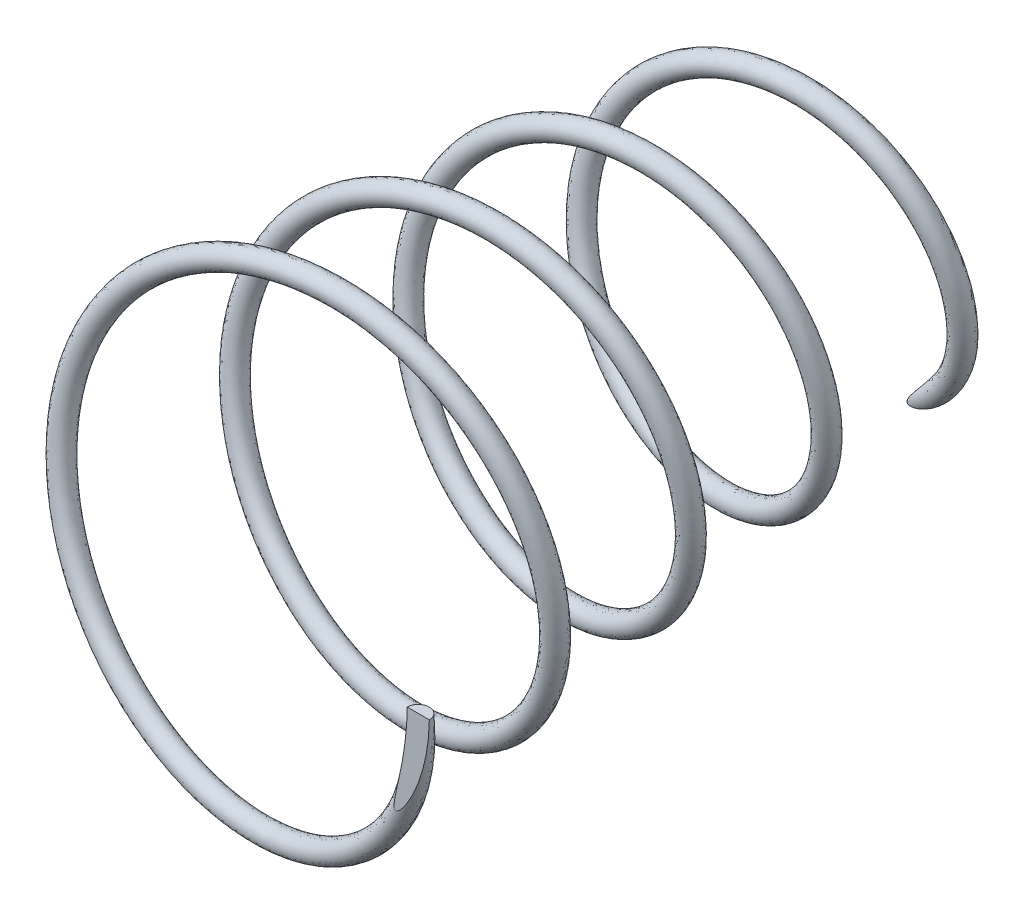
ISO-10303-21;
HEADER;
FILE_DESCRIPTION(('STEP AP214'),'2;1');
FILE_NAME('part.step','',(''),(''),'','','');
FILE_SCHEMA(('AUTOMOTIVE_DESIGN { 1 0 10303 214 1 1 1 1 }'));
ENDSEC;
DATA;
#1=APPLICATION_CONTEXT('core data for automotive mechanical design processes');
#2=APPLICATION_PROTOCOL_DEFINITION('international standard','automotive_design',2000,#1);
#3=PRODUCT_CONTEXT('',#1,'mechanical');
#4=PRODUCT('Part','Part','',(#3));
#5=PRODUCT_RELATED_PRODUCT_CATEGORY('part','',(#4));
#6=PRODUCT_DEFINITION_FORMATION('','',#4);
#7=PRODUCT_DEFINITION_CONTEXT('part definition',#1,'design');
#8=PRODUCT_DEFINITION('design','',#6,#7);
#9=PRODUCT_DEFINITION_SHAPE('','',#8);
#10=(LENGTH_UNIT() NAMED_UNIT(*) SI_UNIT(.MILLI.,.METRE.));
#11=(NAMED_UNIT(*) PLANE_ANGLE_UNIT() SI_UNIT($,.RADIAN.));
#12=(NAMED_UNIT(*) SI_UNIT($,.STERADIAN.) SOLID_ANGLE_UNIT());
#13=UNCERTAINTY_MEASURE_WITH_UNIT(LENGTH_MEASURE(1.E-05),#10,'distance_accuracy_value','');
#14=(GEOMETRIC_REPRESENTATION_CONTEXT(3) GLOBAL_UNCERTAINTY_ASSIGNED_CONTEXT((#13)) GLOBAL_UNIT_ASSIGNED_CONTEXT((#10,
#11,#12)) REPRESENTATION_CONTEXT('',''));
#15=CARTESIAN_POINT('',(0.,0.,0.));
#16=DIRECTION('',(0.,0.,1.));
#17=DIRECTION('',(1.,0.,0.));
#18=AXIS2_PLACEMENT_3D('',#15,#16,#17);
#19=CARTESIAN_POINT('',(10.,0.,0.));
#20=DIRECTION('',(0.,1.,0.));
#21=DIRECTION('',(0.,0.,1.));
#22=AXIS2_PLACEMENT_3D('',#19,#20,#21);
#23=PLANE('',#22);
#24=DIRECTION('',(-1.,0.,0.));
#25=VECTOR('',#24,1.);
#26=CARTESIAN_POINT('',(10.,0.,0.));
#27=LINE('',#26,#25);
#28=CARTESIAN_POINT('',(10.5,0.,0.));
#29=VERTEX_POINT('',#28);
#30=CARTESIAN_POINT('',(9.5,0.,0.));
#31=VERTEX_POINT('',#30);
#32=EDGE_CURVE('E56',#29,#31,#27,.T.);
#33=ORIENTED_EDGE('',*,*,#32,.F.);
#34=CARTESIAN_POINT('',(10.,0.,0.));
#35=DIRECTION('',(0.,1.,0.));
#36=DIRECTION('',(0.,0.,1.));
#37=AXIS2_PLACEMENT_3D('',#34,#35,#36);
#38=CIRCLE('',#37,0.500000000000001);
#39=EDGE_CURVE('E50',#29,#31,#38,.T.);
#40=ORIENTED_EDGE('',*,*,#39,.T.);
#41=EDGE_LOOP('',(#33,#40));
#42=FACE_BOUND('',#41,.T.);
#43=ADVANCED_FACE('F35',(#42),#23,.T.);
#44=CARTESIAN_POINT('',(10.,0.,0.500000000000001));
#45=CARTESIAN_POINT('',(9.97481957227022,-1.84077695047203,0.294921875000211));
#46=CARTESIAN_POINT('',(9.42903488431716,-3.66416152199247,0.0898437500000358));
#47=CARTESIAN_POINT('',(7.46944405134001,-6.74837577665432,-0.320312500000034));
#48=CARTESIAN_POINT('',(6.05889156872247,-8.00465410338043,-0.5253906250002));
#49=CARTESIAN_POINT('',(2.79747815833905,-9.58993068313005,-0.935546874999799));
#50=CARTESIAN_POINT('',(0.951736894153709,-9.91678006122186,-1.14062500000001));
#51=CARTESIAN_POINT('',(-2.62879570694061,-9.55789578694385,-1.55078124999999));
#52=CARTESIAN_POINT('',(-4.35814344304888,-8.8730147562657,-1.75585937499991));
#53=CARTESIAN_POINT('',(-7.19584353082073,-6.70573325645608,-2.16601562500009));
#54=CARTESIAN_POINT('',(-8.30004284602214,-5.22688901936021,-2.37109375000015));
#55=CARTESIAN_POINT('',(-9.5686733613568,-1.91895708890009,-2.78124999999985));
#56=CARTESIAN_POINT('',(-9.73145019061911,-0.0950362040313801,-2.98632812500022));
#57=CARTESIAN_POINT('',(-9.0809530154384,3.35929781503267,-3.39648437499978));
#58=CARTESIAN_POINT('',(-8.26897374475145,4.98448615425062,-3.60156250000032));
#59=CARTESIAN_POINT('',(-5.92148400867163,7.5632730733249,-4.01171874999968));
#60=CARTESIAN_POINT('',(-4.38978855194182,8.51313452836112,-4.21679687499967));
#61=CARTESIAN_POINT('',(-1.06504936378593,9.46905618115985,-4.62695312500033));
#62=CARTESIAN_POINT('',(0.72282663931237,9.47394840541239,-4.83203125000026));
#63=CARTESIAN_POINT('',(4.02793473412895,8.55074144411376,-5.24218749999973));
#64=CARTESIAN_POINT('',(5.54019562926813,7.62434800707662,-5.44726562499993));
#65=CARTESIAN_POINT('',(7.85053495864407,5.1246873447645,-5.85742187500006));
#66=CARTESIAN_POINT('',(8.64530525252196,3.55544938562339,-6.06249999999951));
#67=CARTESIAN_POINT('',(9.29516848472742,0.24257804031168,-6.47265625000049));
#68=CARTESIAN_POINT('',(9.14956753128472,-1.49593115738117,-6.677734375));
#69=CARTESIAN_POINT('',(7.97430306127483,-4.63108771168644,-7.087890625));
#70=CARTESIAN_POINT('',(6.94672257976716,-6.02304855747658,-7.29296874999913));
#71=CARTESIAN_POINT('',(4.3231973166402,-8.05827083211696,-7.70312500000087));
#72=CARTESIAN_POINT('',(2.73145126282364,-8.69866166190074,-7.90820312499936));
#73=CARTESIAN_POINT('',(-0.54215542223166,-9.05168007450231,-8.31835937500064));
#74=CARTESIAN_POINT('',(-2.21897772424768,-8.7640715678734,-8.52343749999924));
#75=CARTESIAN_POINT('',(-5.16588478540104,-7.35889662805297,-8.93359375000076));
#76=CARTESIAN_POINT('',(-6.43159491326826,-6.24375456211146,-9.13867187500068));
#77=CARTESIAN_POINT('',(-8.18786834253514,-3.52465848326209,-9.54882812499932));
#78=CARTESIAN_POINT('',(-8.67600268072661,-1.92502802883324,-9.75390625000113));
#79=CARTESIAN_POINT('',(-8.74378179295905,1.28341937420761,-10.1640624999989));
#80=CARTESIAN_POINT('',(-8.32362831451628,2.88732368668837,-10.3691406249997));
#81=CARTESIAN_POINT('',(-6.71192196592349,5.63021033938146,-10.7792968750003));
#82=CARTESIAN_POINT('',(-5.52309703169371,6.765153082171,-10.9843749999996));
#83=CARTESIAN_POINT('',(-2.73643674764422,8.24142937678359,-11.3945312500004));
#84=CARTESIAN_POINT('',(-1.14300575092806,8.58077532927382,-11.5996093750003));
#85=CARTESIAN_POINT('',(1.97609383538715,8.37712220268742,-12.0097656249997));
#86=CARTESIAN_POINT('',(3.49701251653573,7.83473936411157,-12.2148437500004));
#87=CARTESIAN_POINT('',(6.02270722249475,6.04084428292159,-12.6249999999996));
#88=CARTESIAN_POINT('',(7.02379769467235,4.79232439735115,-12.8300781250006));
#89=CARTESIAN_POINT('',(8.2217320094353,1.9655541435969,-13.2402343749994));
#90=CARTESIAN_POINT('',(8.4170251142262,0.391745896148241,-13.4453125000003));
#91=CARTESIAN_POINT('',(7.9577410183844,-2.61570569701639,-13.8554687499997));
#92=CARTESIAN_POINT('',(7.30416816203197,-4.04479581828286,-14.0605468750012));
#93=CARTESIAN_POINT('',(5.3531192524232,-6.34277151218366,-14.4707031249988));
#94=CARTESIAN_POINT('',(4.05885987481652,-7.20834038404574,-14.6757812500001));
#95=CARTESIAN_POINT('',(1.21862813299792,-8.1321866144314,-15.0859374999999));
#96=CARTESIAN_POINT('',(-0.322905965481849,-8.18934153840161,-15.2910156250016));
#97=CARTESIAN_POINT('',(-3.1984570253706,-7.49199996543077,-15.7011718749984));
#98=CARTESIAN_POINT('',(-4.52814808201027,-6.73886683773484,-15.9062499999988));
#99=CARTESIAN_POINT('',(-6.59054007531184,-4.65611954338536,-16.3164062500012));
#100=CARTESIAN_POINT('',(-7.32030374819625,-3.32990574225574,-16.5214843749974));
#101=CARTESIAN_POINT('',(-7.97678663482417,-0.501815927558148,-16.9316406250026));
#102=CARTESIAN_POINT('',(-7.90279931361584,0.995665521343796,-17.136718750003));
#103=CARTESIAN_POINT('',(-6.98651175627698,3.72124629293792,-17.546874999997));
#104=CARTESIAN_POINT('',(-6.14590252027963,4.94527414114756,-17.7519531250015));
#105=CARTESIAN_POINT('',(-3.95706348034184,6.76687114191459,-18.1621093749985));
#106=CARTESIAN_POINT('',(-2.61237700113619,7.36188885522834,-18.3671874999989));
#107=CARTESIAN_POINT('',(0.179235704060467,7.76005455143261,-18.7773437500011));
#108=CARTESIAN_POINT('',(1.62184878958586,7.5628958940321,-18.9824218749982));
#109=CARTESIAN_POINT('',(4.18168243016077,6.44806788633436,-19.3925781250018));
#110=CARTESIAN_POINT('',(5.29510936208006,5.53238384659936,-19.5976562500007));
#111=CARTESIAN_POINT('',(6.87331817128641,3.26294648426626,-20.0078124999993));
#112=CARTESIAN_POINT('',(7.33593668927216,1.91283902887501,-20.212890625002));
#113=CARTESIAN_POINT('',(7.48698363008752,-0.819434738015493,-20.623046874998));
#114=CARTESIAN_POINT('',(7.17548597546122,-2.19740461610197,-20.8281250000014));
#115=CARTESIAN_POINT('',(5.88356595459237,-4.57809165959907,-21.2382812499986));
#116=CARTESIAN_POINT('',(4.90538836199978,-5.57731266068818,-21.4433593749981));
#117=CARTESIAN_POINT('',(2.58047591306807,-6.91209734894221,-21.8535156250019));
#118=CARTESIAN_POINT('',(1.23744976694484,-7.24588398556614,-22.0585937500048));
#119=CARTESIAN_POINT('',(-1.41428195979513,-7.16297606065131,-22.4687499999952));
#120=CARTESIAN_POINT('',(-2.71894037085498,-6.74671362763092,-22.6738281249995));
#121=CARTESIAN_POINT('',(-4.90951714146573,-5.2999372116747,-23.0839843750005));
#122=CARTESIAN_POINT('',(-5.79225250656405,-4.27189149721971,-23.2890624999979));
#123=CARTESIAN_POINT('',(-6.88604910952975,-1.91600988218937,-23.6992187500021));
#124=CARTESIAN_POINT('',(-7.09571395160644,-0.59190694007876,-23.904296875));
#125=CARTESIAN_POINT('',(-6.79377812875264,1.95990250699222,-24.314453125));
#126=CARTESIAN_POINT('',(-6.28294274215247,3.18374068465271,-24.5195312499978));
#127=CARTESIAN_POINT('',(-4.70407502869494,5.17571152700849,-24.9296875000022));
#128=CARTESIAN_POINT('',(-3.63869778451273,5.94098613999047,-25.1347656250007));
#129=CARTESIAN_POINT('',(-1.27550060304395,6.79859413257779,-25.5449218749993));
#130=CARTESIAN_POINT('',(0.0185992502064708,6.88990241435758,-25.7500000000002));
#131=CARTESIAN_POINT('',(2.45307066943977,6.38541308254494,-26.1601562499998));
#132=CARTESIAN_POINT('',(3.58977913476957,5.79068648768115,-26.3652343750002));
#133=CARTESIAN_POINT('',(5.37712258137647,4.10276496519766,-26.7753906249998));
#134=CARTESIAN_POINT('',(6.02523228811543,3.0123749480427,-26.9804687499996));
#135=CARTESIAN_POINT('',(6.65368430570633,0.664442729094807,-27.3906250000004));
#136=CARTESIAN_POINT('',(6.63335997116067,-0.589427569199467,-27.595703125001));
#137=CARTESIAN_POINT('',(5.94411237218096,-2.89122779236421,-28.005859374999));
#138=CARTESIAN_POINT('',(5.27653646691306,-3.93572285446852,-28.210937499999));
#139=CARTESIAN_POINT('',(3.50261709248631,-5.51487210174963,-28.621093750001));
#140=CARTESIAN_POINT('',(2.39919147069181,-6.04733772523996,-28.8261718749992));
#141=CARTESIAN_POINT('',(0.0878271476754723,-6.45574919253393,-29.2363281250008));
#142=CARTESIAN_POINT('',(-1.11652100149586,-6.33137075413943,-29.4414062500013));
#143=CARTESIAN_POINT('',(-3.27249319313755,-5.47624594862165,-29.8515624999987));
#144=CARTESIAN_POINT('',(-4.22093010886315,-4.74709226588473,-30.0566406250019));
#145=CARTESIAN_POINT('',(-5.59072841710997,-2.91000120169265,-30.4667968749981));
#146=CARTESIAN_POINT('',(-6.01023807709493,-1.80505820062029,-30.6718749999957));
#147=CARTESIAN_POINT('',(-6.20963857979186,0.449899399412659,-31.0820312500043));
#148=CARTESIAN_POINT('',(-5.98952844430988,1.59643554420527,-31.2871093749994));
#149=CARTESIAN_POINT('',(-4.98825231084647,3.59566807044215,-31.6972656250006));
#150=CARTESIAN_POINT('',(-4.20889207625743,4.44544094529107,-31.9023437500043));
#151=CARTESIAN_POINT('',(-2.33098549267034,5.60707281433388,-32.3124999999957));
#152=CARTESIAN_POINT('',(-1.23547451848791,5.91741331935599,-32.5175781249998));
#153=CARTESIAN_POINT('',(0.944868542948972,5.92056171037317,-32.9277343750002));
#154=CARTESIAN_POINT('',(2.02636233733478,5.61367019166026,-33.1328124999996));
#155=CARTESIAN_POINT('',(3.86023244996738,4.48656898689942,-33.5429687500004));
#156=CARTESIAN_POINT('',(4.60996109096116,3.66834505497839,-33.7480468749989));
#157=CARTESIAN_POINT('',(5.56686028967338,1.771279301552,-34.1582031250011));
#158=CARTESIAN_POINT('',(5.7728384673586,0.695479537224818,-34.3632812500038));
#159=CARTESIAN_POINT('',(5.59402383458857,-1.39381809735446,-34.7734374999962));
#160=CARTESIAN_POINT('',(5.20980911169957,-2.40414299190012,-34.9785156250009));
#161=CARTESIAN_POINT('',(3.97756412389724,-4.06633527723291,-35.3886718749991));
#162=CARTESIAN_POINT('',(3.13166606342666,-4.71583933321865,-35.5937500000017));
#163=CARTESIAN_POINT('',(1.23618038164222,-5.47357507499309,-36.0039062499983));
#164=CARTESIAN_POINT('',(0.189608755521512,-5.58092999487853,-36.2089843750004));
#165=CARTESIAN_POINT('',(-1.79411325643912,-5.23576073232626,-36.6191406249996));
#166=CARTESIAN_POINT('',(-2.72827804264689,-4.78406603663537,-36.8242187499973));
#167=CARTESIAN_POINT('',(-4.21477783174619,-3.46746984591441,-37.2343750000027));
#168=CARTESIAN_POINT('',(-4.7650386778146,-2.60481339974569,-37.4394531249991));
#169=CARTESIAN_POINT('',(-5.33118143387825,-0.730527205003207,-37.8496093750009));
#170=CARTESIAN_POINT('',(-5.3464885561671,0.278143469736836,-38.0546874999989));
#171=CARTESIAN_POINT('',(-4.85167187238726,2.14376103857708,-38.4648437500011));
#172=CARTESIAN_POINT('',(-4.34260120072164,2.99792851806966,-38.6699218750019));
#173=CARTESIAN_POINT('',(-2.96231801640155,4.30699069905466,-39.0800781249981));
#174=CARTESIAN_POINT('',(-2.09343010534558,4.76010163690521,-39.2851562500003));
#175=CARTESIAN_POINT('',(-0.258656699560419,5.14407026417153,-39.6953124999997));
#176=CARTESIAN_POINT('',(0.704355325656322,5.07463861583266,-39.9003906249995));
#177=CARTESIAN_POINT('',(2.44141791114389,4.44775288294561,-40.3105468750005));
#178=CARTESIAN_POINT('',(3.21291068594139,3.89154653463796,-40.5156250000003));
#179=CARTESIAN_POINT('',(4.34500459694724,2.4678790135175,-40.9257812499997));
#180=CARTESIAN_POINT('',(4.70411005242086,1.6027893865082,-41.1308593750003));
#181=CARTESIAN_POINT('',(4.9170020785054,-0.175632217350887,-41.5410156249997));
#182=CARTESIAN_POINT('',(4.77076561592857,-1.0862025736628,-41.7460937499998));
#183=CARTESIAN_POINT('',(4.03002800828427,-2.68639059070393,-42.1562500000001));
#184=CARTESIAN_POINT('',(3.43693923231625,-3.373684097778,-42.3613281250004));
#185=CARTESIAN_POINT('',(1.98960409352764,-4.33141540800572,-42.7714843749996));
#186=CARTESIAN_POINT('',(1.13774464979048,-4.60063990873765,-42.9765625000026));
#187=CARTESIAN_POINT('',(-0.569109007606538,-4.65504696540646,-43.3867187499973));
#188=CARTESIAN_POINT('',(-1.42147702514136,-4.44045132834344,-43.5917968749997));
#189=CARTESIAN_POINT('',(-2.87863007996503,-3.60448322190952,-44.0019531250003));
#190=CARTESIAN_POINT('',(-3.48133311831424,-2.98465723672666,-44.20703125));
#191=CARTESIAN_POINT('',(-4.26934382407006,-1.53257187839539,-44.6171875));
#192=CARTESIAN_POINT('',(-4.45371163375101,-0.70268460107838,-44.8222656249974));
#193=CARTESIAN_POINT('',(-4.36352215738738,0.919135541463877,-45.2324218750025));
#194=CARTESIAN_POINT('',(-4.08940805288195,1.70859834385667,-45.4374999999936));
#195=CARTESIAN_POINT('',(-3.17700065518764,3.01871906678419,-45.8476562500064));
#196=CARTESIAN_POINT('',(-2.5403572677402,3.53754218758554,-46.0527343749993));
#197=CARTESIAN_POINT('',(-1.10143946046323,4.16239005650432,-46.4628906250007));
#198=CARTESIAN_POINT('',(-0.30149380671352,4.26773642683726,-46.6679687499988));
#199=CARTESIAN_POINT('',(1.22368360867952,4.04792785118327,-47.0781250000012));
#200=CARTESIAN_POINT('',(1.94661912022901,3.72341232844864,-47.2832031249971));
#201=CARTESIAN_POINT('',(3.10785287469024,2.75329498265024,-47.6933593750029));
#202=CARTESIAN_POINT('',(3.54456512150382,2.10941598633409,-47.8984375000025));
#203=CARTESIAN_POINT('',(4.01458411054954,0.700398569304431,-48.3085937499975));
#204=CARTESIAN_POINT('',(4.04745918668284,-0.0624809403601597,-48.5136718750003));
#205=CARTESIAN_POINT('',(3.7138819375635,-1.48134579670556,-48.9238281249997));
#206=CARTESIAN_POINT('',(3.34823882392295,-2.13522322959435,-49.1289062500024));
#207=CARTESIAN_POINT('',(2.3388523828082,-3.14781421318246,-49.5390624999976));
#208=CARTESIAN_POINT('',(1.69687485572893,-3.50518881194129,-49.744140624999));
#209=CARTESIAN_POINT('',(0.333137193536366,-3.83033216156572,-50.154296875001));
#210=CARTESIAN_POINT('',(-0.386458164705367,-3.7978986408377,-50.3593750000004));
#211=CARTESIAN_POINT('',(-1.69133968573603,-3.36705430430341,-50.7695312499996));
#212=CARTESIAN_POINT('',(-2.27471754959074,-2.96959506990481,-50.9746093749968));
#213=CARTESIAN_POINT('',(-3.14094203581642,-1.93887266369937,-51.3847656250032));
#214=CARTESIAN_POINT('',(-3.42269173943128,-1.30738921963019,-51.5898437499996));
#215=CARTESIAN_POINT('',(-3.61435960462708,-0.00280699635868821,-52.0000000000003));
#216=CARTESIAN_POINT('',(-3.52428530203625,0.668242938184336,-52.2050781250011));
#217=CARTESIAN_POINT('',(-3.01310137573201,1.85350537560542,-52.6152343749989));
#218=CARTESIAN_POINT('',(-2.59305767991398,2.36601717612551,-52.8203124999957));
#219=CARTESIAN_POINT('',(-1.55821510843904,3.0900948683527,-53.2304687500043));
#220=CARTESIAN_POINT('',(-0.945182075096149,3.30079775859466,-53.4355468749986));
#221=CARTESIAN_POINT('',(0.288003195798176,3.37165137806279,-53.8457031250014));
#222=CARTESIAN_POINT('',(0.906241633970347,3.23199789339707,-54.0507812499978));
#223=CARTESIAN_POINT('',(1.96829642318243,2.65760154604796,-54.4609375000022));
#224=CARTESIAN_POINT('',(2.41062433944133,2.2240106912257,-54.6660156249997));
#225=CARTESIAN_POINT('',(2.99860902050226,1.20134855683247,-55.0761718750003));
#226=CARTESIAN_POINT('',(3.1436256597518,0.614002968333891,-55.2812499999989));
#227=CARTESIAN_POINT('',(3.10739018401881,-0.537287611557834,-55.6914062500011));
#228=CARTESIAN_POINT('',(2.92649889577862,-1.09947010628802,-55.8964843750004));
#229=CARTESIAN_POINT('',(2.30599215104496,-2.03676433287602,-56.3066406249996));
#230=CARTESIAN_POINT('',(1.86758663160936,-2.41060128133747,-56.5117187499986));
#231=CARTESIAN_POINT('',(0.8723061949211,-2.87025214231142,-56.9218750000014));
#232=CARTESIAN_POINT('',(0.317092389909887,-2.95563504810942,-57.1269531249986));
#233=CARTESIAN_POINT('',(-0.74363730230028,-2.82689324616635,-57.5371093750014));
#234=CARTESIAN_POINT('',(-1.24755526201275,-2.61326987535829,-57.7421875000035));
#235=CARTESIAN_POINT('',(-2.06053680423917,-1.9635086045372,-58.1523437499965));
#236=CARTESIAN_POINT('',(-2.36853741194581,-1.52861088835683,-58.3574218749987));
#237=CARTESIAN_POINT('',(-2.70917262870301,-0.574645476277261,-58.7675781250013));
#238=CARTESIAN_POINT('',(-2.74156911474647,-0.0571519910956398,-58.9726562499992));
#239=CARTESIAN_POINT('',(-2.5355482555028,0.906247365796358,-59.3828125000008));
#240=CARTESIAN_POINT('',(-2.29774724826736,1.35073005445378,-59.5878906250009));
#241=CARTESIAN_POINT('',(-1.6351263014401,2.04179000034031,-59.9980468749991));
#242=CARTESIAN_POINT('',(-1.21154992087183,2.28751111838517,-60.2031249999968));
#243=CARTESIAN_POINT('',(-0.311413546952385,2.519845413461,-60.6132812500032));
#244=CARTESIAN_POINT('',(0.163679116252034,2.50639490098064,-60.8183593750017));
#245=CARTESIAN_POINT('',(1.02491759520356,2.23874915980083,-61.2285156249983));
#246=CARTESIAN_POINT('',(1.40982199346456,1.98525913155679,-61.4335937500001));
#247=CARTESIAN_POINT('',(1.98321515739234,1.32550585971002,-61.8437499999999));
#248=CARTESIAN_POINT('',(2.17104664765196,0.920463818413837,-62.0488281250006));
#249=CARTESIAN_POINT('',(2.30701472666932,0.0851184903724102,-62.4589843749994));
#250=CARTESIAN_POINT('',(2.25524167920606,-0.343841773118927,-62.6640624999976));
#251=CARTESIAN_POINT('',(1.94183245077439,-1.10004658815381,-63.0742187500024));
#252=CARTESIAN_POINT('',(1.68096391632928,-1.42623532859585,-63.2792968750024));
#253=CARTESIAN_POINT('',(1.03894223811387,-1.88797990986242,-63.6894531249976));
#254=CARTESIAN_POINT('',(0.658963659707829,-2.02306653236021,-63.894531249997));
#255=CARTESIAN_POINT('',(-0.102293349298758,-2.07563441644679,-64.304687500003));
#256=CARTESIAN_POINT('',(-0.482367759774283,-1.99333808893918,-64.5097656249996));
#257=CARTESIAN_POINT('',(-1.13261941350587,-1.65001459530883,-64.9199218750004));
#258=CARTESIAN_POINT('',(-1.4019271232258,-1.38979117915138,-65.124999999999));
#259=CARTESIAN_POINT('',(-1.75968475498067,-0.779318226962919,-65.535156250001));
#260=CARTESIAN_POINT('',(-1.84784006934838,-0.43017408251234,-65.7402343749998));
#261=CARTESIAN_POINT('',(-1.83080645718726,0.249453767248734,-66.1503906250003));
#262=CARTESIAN_POINT('',(-1.72594867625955,0.578884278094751,-66.3554687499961));
#263=CARTESIAN_POINT('',(-1.36833124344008,1.12418899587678,-66.7656250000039));
#264=CARTESIAN_POINT('',(-1.11638552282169,1.33937749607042,-66.9707031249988));
#265=CARTESIAN_POINT('',(-0.550062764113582,1.60231512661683,-67.3808593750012));
#266=CARTESIAN_POINT('',(-0.236701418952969,1.64992839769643,-67.5859374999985));
#267=CARTESIAN_POINT('',(0.355582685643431,1.57771828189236,-67.9960937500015));
#268=CARTESIAN_POINT('',(0.633611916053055,1.45831048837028,-68.2011718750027));
#269=CARTESIAN_POINT('',(1.29847120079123,0.923212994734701,-68.8164062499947));
#270=CARTESIAN_POINT('',(1.49040033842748,0.331157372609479,-69.2265625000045));
#271=CARTESIAN_POINT('',(1.26530600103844,-0.671041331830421,-70.0468749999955));
#272=CARTESIAN_POINT('',(0.86263007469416,-1.0588572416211,-70.4570312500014));
#273=CARTESIAN_POINT('',(-0.0290222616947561,-1.27092052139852,-71.2773437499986));
#274=CARTESIAN_POINT('',(-0.494055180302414,-1.09882172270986,-71.6875000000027));
#275=CARTESIAN_POINT('',(-1.00380430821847,-0.474429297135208,-72.5078124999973));
#276=CARTESIAN_POINT('',(-1.04290389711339,-0.043370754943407,-72.9179687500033));
#277=CARTESIAN_POINT('',(-0.746662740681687,0.586229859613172,-73.7382812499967));
#278=CARTESIAN_POINT('',(-0.427008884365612,0.772698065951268,-74.1484374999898));
#279=CARTESIAN_POINT('',(0.1589531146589,0.772145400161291,-74.9687500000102));
#280=CARTESIAN_POINT('',(0.40998790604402,0.594152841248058,-75.3789062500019));
#281=CARTESIAN_POINT('',(0.599260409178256,0.176246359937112,-76.1682686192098));
#282=CARTESIAN_POINT('',(0.56202077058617,-0.0446373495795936,-76.5474747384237));
#283=CARTESIAN_POINT('',(0.457308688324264,-0.184144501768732,-76.9266808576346));
#284=CARTESIAN_POINT('',(11.,0.,0.500000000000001));
#285=CARTESIAN_POINT('',(10.9748195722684,-2.02485464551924,0.294921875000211));
#286=CARTESIAN_POINT('',(10.37695533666,-4.03203570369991,0.0898437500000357));
#287=CARTESIAN_POINT('',(8.22423398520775,-7.42968096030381,-0.320312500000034));
#288=CARTESIAN_POINT('',(6.67292556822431,-8.81511498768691,-0.5253906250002));
#289=CARTESIAN_POINT('',(3.08266681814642,-10.5659184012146,-0.935546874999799));
#290=CARTESIAN_POINT('',(1.04933851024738,-10.9288860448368,-1.14062500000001));
#291=CARTESIAN_POINT('',(-2.89799194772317,-10.5384150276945,-1.55078124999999));
#292=CARTESIAN_POINT('',(-4.80599015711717,-9.78587724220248,-1.75585937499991));
#293=CARTESIAN_POINT('',(-7.93939542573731,-7.39928583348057,-2.16601562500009));
#294=CARTESIAN_POINT('',(-9.16019771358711,-5.7691234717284,-2.37109375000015));
#295=CARTESIAN_POINT('',(-10.5655306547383,-2.11935702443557,-2.78124999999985));
#296=CARTESIAN_POINT('',(-10.7481981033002,-0.105441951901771,-2.98632812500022));
#297=CARTESIAN_POINT('',(-10.0347603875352,3.71162734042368,-3.39648437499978));
#298=CARTESIAN_POINT('',(-9.14004610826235,5.50900263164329,-3.60156250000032));
#299=CARTESIAN_POINT('',(-6.54868443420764,8.36358815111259,-4.01171874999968));
#300=CARTESIAN_POINT('',(-4.85622459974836,9.41663993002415,-4.21679687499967));
#301=CARTESIAN_POINT('',(-1.1791826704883,10.4794314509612,-4.62695312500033));
#302=CARTESIAN_POINT('',(0.799693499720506,10.4878399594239,-4.83203125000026));
#303=CARTESIAN_POINT('',(4.46079919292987,9.47080283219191,-5.24218749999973));
#304=CARTESIAN_POINT('',(6.13751367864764,8.44720628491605,-5.44726562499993));
#305=CARTESIAN_POINT('',(8.70171107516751,5.68091015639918,-5.85742187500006));
#306=CARTESIAN_POINT('',(9.58549803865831,3.94264716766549,-6.06249999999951));
#307=CARTESIAN_POINT('',(10.3116104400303,0.269603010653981,-6.47265625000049));
#308=CARTESIAN_POINT('',(10.153125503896,-1.65950375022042,-6.677734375));
#309=CARTESIAN_POINT('',(8.85383321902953,-5.14129482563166,-7.087890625));
#310=CARTESIAN_POINT('',(7.71529837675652,-6.68876309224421,-7.29296874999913));
#311=CARTESIAN_POINT('',(4.8043404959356,-8.95403075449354,-7.70312500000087));
#312=CARTESIAN_POINT('',(3.0365552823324,-9.66860812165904,-7.90820312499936));
#313=CARTESIAN_POINT('',(-0.602438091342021,-10.0666926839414,-8.31835937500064));
#314=CARTESIAN_POINT('',(-2.46804973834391,-9.74989494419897,-8.52343749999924));
#315=CARTESIAN_POINT('',(-5.74967189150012,-8.19140921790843,-8.93359375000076));
#316=CARTESIAN_POINT('',(-7.16079643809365,-6.95237980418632,-9.13867187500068));
#317=CARTESIAN_POINT('',(-9.12160604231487,-3.9271737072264,-9.54882812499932));
#318=CARTESIAN_POINT('',(-9.66854967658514,-2.14578821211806,-9.75390625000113));
#319=CARTESIAN_POINT('',(-9.74987956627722,1.43056511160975,-10.1640624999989));
#320=CARTESIAN_POINT('',(-9.28444686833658,3.22005827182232,-10.3691406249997));
#321=CARTESIAN_POINT('',(-7.49127739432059,6.28327213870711,-10.7792968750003));
#322=CARTESIAN_POINT('',(-6.16654576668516,7.55246389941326,-10.9843749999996));
#323=CARTESIAN_POINT('',(-3.05735555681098,9.20625874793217,-11.3945312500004));
#324=CARTESIAN_POINT('',(-1.2777940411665,9.58860304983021,-11.5996093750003));
#325=CARTESIAN_POINT('',(2.20901747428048,9.36688539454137,-12.0097656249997));
#326=CARTESIAN_POINT('',(3.91095582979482,8.76346727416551,-12.2148437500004));
#327=CARTESIAN_POINT('',(6.74022753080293,6.76129497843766,-12.6249999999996));
#328=CARTESIAN_POINT('',(7.86341156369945,5.36585133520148,-12.8300781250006));
#329=CARTESIAN_POINT('',(9.21053765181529,2.2025098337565,-13.2402343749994));
#330=CARTESIAN_POINT('',(9.43270105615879,0.439568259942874,-13.4453125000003));
#331=CARTESIAN_POINT('',(8.92387034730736,-2.93268947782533,-13.8554687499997));
#332=CARTESIAN_POINT('',(8.19395626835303,-4.53689512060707,-14.0605468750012));
#333=CARTESIAN_POINT('',(6.00935205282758,-7.11945877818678,-14.4707031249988));
#334=CARTESIAN_POINT('',(4.55823538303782,-8.09406534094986,-14.6757812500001));
#335=CARTESIAN_POINT('',(1.36987320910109,-9.13767630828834,-15.0859374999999));
#336=CARTESIAN_POINT('',(-0.362402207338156,-9.20537531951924,-15.2910156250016));
#337=CARTESIAN_POINT('',(-3.59716326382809,-8.42737044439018,-15.7011718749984));
#338=CARTESIAN_POINT('',(-5.09477425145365,-7.5831531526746,-15.9062499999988));
#339=CARTESIAN_POINT('',(-7.42066640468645,-5.24329487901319,-16.3164062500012));
#340=CARTESIAN_POINT('',(-8.24560777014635,-3.7514470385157,-16.5214843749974));
#341=CARTESIAN_POINT('',(-8.99154511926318,-0.56623499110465,-16.9316406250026));
#342=CARTESIAN_POINT('',(-8.91169791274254,1.12218909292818,-17.136718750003));
#343=CARTESIAN_POINT('',(-7.88422523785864,4.19873461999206,-17.546874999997));
#344=CARTESIAN_POINT('',(-6.93846062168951,5.58224843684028,-17.7519531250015));
#345=CARTESIAN_POINT('',(-4.47085106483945,7.64431453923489,-18.1621093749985));
#346=CARTESIAN_POINT('',(-2.95297531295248,8.31994803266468,-18.3671874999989));
#347=CARTESIAN_POINT('',(0.20211772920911,8.776598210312,-18.7773437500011));
#348=CARTESIAN_POINT('',(1.83446660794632,8.55721891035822,-18.9824218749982));
#349=CARTESIAN_POINT('',(4.73443147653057,7.30150393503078,-19.3925781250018));
#350=CARTESIAN_POINT('',(5.99773424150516,6.26736879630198,-19.5976562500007));
#351=CARTESIAN_POINT('',(7.79160768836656,3.69955724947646,-20.0078124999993));
#352=CARTESIAN_POINT('',(8.31968555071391,2.16998252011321,-20.212890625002));
#353=CARTESIAN_POINT('',(8.49781568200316,-0.929449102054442,-20.623046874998));
#354=CARTESIAN_POINT('',(8.14790049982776,-2.49454867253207,-20.8281250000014));
#355=CARTESIAN_POINT('',(6.6864306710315,-5.20202502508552,-21.2382812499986));
#356=CARTESIAN_POINT('',(5.57737981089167,-6.34040642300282,-21.4433593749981));
#357=CARTESIAN_POINT('',(2.93668995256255,-7.86446080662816,-21.8535156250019));
#358=CARTESIAN_POINT('',(1.40924206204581,-8.24806760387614,-22.0585937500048));
#359=CARTESIAN_POINT('',(-1.61061733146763,-8.1606418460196,-22.4687499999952));
#360=CARTESIAN_POINT('',(-3.09841929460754,-7.6900483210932,-22.6738281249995));
#361=CARTESIAN_POINT('',(-5.60003345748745,-6.04630964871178,-23.0839843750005));
#362=CARTESIAN_POINT('',(-6.61018750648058,-4.87593365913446,-23.2890624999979));
#363=CARTESIAN_POINT('',(-7.86546304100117,-2.18920019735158,-23.6992187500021));
#364=CARTESIAN_POINT('',(-8.10894144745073,-0.67708110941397,-23.904296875));
#365=CARTESIAN_POINT('',(-7.77092008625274,2.24111095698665,-24.314453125));
#366=CARTESIAN_POINT('',(-7.19024072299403,3.64275590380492,-24.5195312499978));
#367=CARTESIAN_POINT('',(-5.38845085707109,5.92771839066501,-24.9296875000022));
#368=CARTESIAN_POINT('',(-4.17033598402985,6.80773029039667,-25.1347656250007));
#369=CARTESIAN_POINT('',(-1.46365247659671,7.7978355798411,-25.5449218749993));
#370=CARTESIAN_POINT('',(0.0206713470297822,7.90670146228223,-25.7500000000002));
#371=CARTESIAN_POINT('',(2.81707834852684,7.33482500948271,-26.1601562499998));
#372=CARTESIAN_POINT('',(4.12494551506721,6.65525663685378,-26.3652343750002));
#373=CARTESIAN_POINT('',(6.18507411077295,4.72009706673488,-26.7753906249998));
#374=CARTESIAN_POINT('',(6.93439354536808,3.46768847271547,-26.9804687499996));
#375=CARTESIAN_POINT('',(7.66538408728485,0.766168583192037,-27.3906250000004));
#376=CARTESIAN_POINT('',(7.64623190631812,-0.678730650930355,-27.595703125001));
#377=CARTESIAN_POINT('',(6.85879256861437,-3.33535022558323,-28.005859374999));
#378=CARTESIAN_POINT('',(6.09200277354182,-4.54309366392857,-28.210937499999));
#379=CARTESIAN_POINT('',(4.04835278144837,-6.37280983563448,-28.621093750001));
#380=CARTESIAN_POINT('',(2.77482248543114,-6.99221122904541,-28.8261718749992));
#381=CARTESIAN_POINT('',(0.102376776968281,-7.47244624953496,-29.2363281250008));
#382=CARTESIAN_POINT('',(-1.2923964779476,-7.33284587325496,-29.4414062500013));
#383=CARTESIAN_POINT('',(-3.79345507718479,-6.34944885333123,-29.8515624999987));
#384=CARTESIAN_POINT('',(-4.89602612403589,-5.50744084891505,-30.0566406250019));
#385=CARTESIAN_POINT('',(-6.49232525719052,-3.38011579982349,-30.4667968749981));
#386=CARTESIAN_POINT('',(-6.98385559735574,-2.09823651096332,-30.6718749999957));
#387=CARTESIAN_POINT('',(-7.22383499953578,0.522633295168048,-31.0820312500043));
#388=CARTESIAN_POINT('',(-6.9722210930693,1.85758637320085,-31.2871093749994));
#389=CARTESIAN_POINT('',(-5.81353824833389,4.18962742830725,-31.6972656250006));
#390=CARTESIAN_POINT('',(-4.90851553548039,5.18328348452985,-31.9023437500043));
#391=CARTESIAN_POINT('',(-2.72201201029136,6.54567968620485,-32.3124999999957));
#392=CARTESIAN_POINT('',(-1.44403800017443,6.91259464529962,-32.5175781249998));
#393=CARTESIAN_POINT('',(1.1043495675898,6.92477802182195,-32.9277343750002));
#394=CARTESIAN_POINT('',(2.37086259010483,6.57033323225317,-33.1328124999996));
#395=CARTESIAN_POINT('',(4.52280896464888,5.25785165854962,-33.5429687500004));
#396=CARTESIAN_POINT('',(5.40510873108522,4.30208382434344,-33.7480468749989));
#397=CARTESIAN_POINT('',(6.5355551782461,2.08033400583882,-34.1582031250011));
#398=CARTESIAN_POINT('',(6.78224435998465,0.817890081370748,-34.3632812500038));
#399=CARTESIAN_POINT('',(6.58085416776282,-1.63887011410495,-34.7734374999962));
#400=CARTESIAN_POINT('',(6.1333873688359,-2.82945205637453,-34.9785156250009));
#401=CARTESIAN_POINT('',(4.689155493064,-4.7926425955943,-35.3886718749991));
#402=CARTESIAN_POINT('',(3.69484646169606,-5.56242803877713,-35.5937500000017));
#403=CARTESIAN_POINT('',(1.46098406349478,-6.46521407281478,-36.0039062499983));
#404=CARTESIAN_POINT('',(0.224963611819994,-6.59711631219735,-36.2089843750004));
#405=CARTESIAN_POINT('',(-2.12292906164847,-6.19792743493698,-36.6191406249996));
#406=CARTESIAN_POINT('',(-3.23125935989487,-5.66774832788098,-36.8242187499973));
#407=CARTESIAN_POINT('',(-4.99945960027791,-4.11412208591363,-37.2343750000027));
#408=CARTESIAN_POINT('',(-5.6568250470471,-3.09328209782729,-37.4394531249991));
#409=CARTESIAN_POINT('',(-6.33845142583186,-0.869421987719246,-37.8496093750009));
#410=CARTESIAN_POINT('',(-6.36196115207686,0.330105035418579,-38.0546874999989));
#411=CARTESIAN_POINT('',(-5.78207918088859,2.55391568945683,-38.4648437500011));
#412=CARTESIAN_POINT('',(-5.17987056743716,3.57487271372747,-38.6699218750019));
#413=CARTESIAN_POINT('',(-3.53926221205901,5.14426006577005,-39.0800781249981));
#414=CARTESIAN_POINT('',(-2.50358475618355,5.69050894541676,-39.2851562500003));
#415=CARTESIAN_POINT('',(-0.310618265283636,6.15954286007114,-39.6953124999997));
#416=CARTESIAN_POINT('',(0.843250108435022,6.08190860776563,-39.9003906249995));
#417=CARTESIAN_POINT('',(2.92988660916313,5.33953925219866,-40.3105468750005));
#418=CARTESIAN_POINT('',(3.85956292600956,4.67622830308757,-40.5156250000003));
#419=CARTESIAN_POINT('',(5.2286868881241,2.97086033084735,-40.9257812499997));
#420=CARTESIAN_POINT('',(5.66627675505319,1.93160519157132,-41.1308593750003));
#421=CARTESIAN_POINT('',(5.93318839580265,-0.210987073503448,-41.5410156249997));
#422=CARTESIAN_POINT('',(5.76240461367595,-1.31100625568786,-41.7460937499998));
#423=CARTESIAN_POINT('',(4.87661671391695,-3.24957098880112,-42.1562500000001));
#424=CARTESIAN_POINT('',(4.16324655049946,-4.08527546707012,-42.3613281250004));
#425=CARTESIAN_POINT('',(2.41491315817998,-5.25499366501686,-42.7714843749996));
#426=CARTESIAN_POINT('',(1.38279666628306,-5.58747024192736,-42.9765625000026));
#427=CARTESIAN_POINT('',(-0.691519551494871,-5.66445285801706,-43.3867187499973));
#428=CARTESIAN_POINT('',(-1.73053172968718,-5.40914621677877,-43.5917968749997));
#429=CARTESIAN_POINT('',(-3.51236884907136,-4.39963086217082,-44.0019531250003));
#430=CARTESIAN_POINT('',(-4.25261579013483,-3.64723375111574,-44.20703125));
#431=CARTESIAN_POINT('',(-5.22600686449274,-1.87707213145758,-44.6171875));
#432=CARTESIAN_POINT('',(-5.45792794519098,-0.862165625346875,-44.8222656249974));
#433=CARTESIAN_POINT('',(-5.35870348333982,1.12769902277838,-45.2324218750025));
#434=CARTESIAN_POINT('',(-5.02801492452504,2.09962486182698,-45.4374999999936));
#435=CARTESIAN_POINT('',(-3.91484319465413,3.71834252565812,-45.8476562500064));
#436=CARTESIAN_POINT('',(-3.13431662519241,4.36282812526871,-46.0527343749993));
#437=CARTESIAN_POINT('',(-1.36259028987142,5.14508270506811,-46.4628906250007));
#438=CARTESIAN_POINT('',(-0.374227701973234,5.2819328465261,-46.6679687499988));
#439=CARTESIAN_POINT('',(1.51686191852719,5.02154537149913,-47.0781250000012));
#440=CARTESIAN_POINT('',(2.41673371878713,4.62500916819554,-47.283203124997));
#441=CARTESIAN_POINT('',(3.86820145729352,3.42839099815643,-47.6933593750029));
#442=CARTESIAN_POINT('',(4.41776802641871,2.63037786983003,-47.8984375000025));
#443=CARTESIAN_POINT('',(5.01605922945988,0.876274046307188,-48.3085937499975));
#444=CARTESIAN_POINT('',(5.06415624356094,-0.0770305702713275,-48.5136718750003));
#445=CARTESIAN_POINT('',(4.65875544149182,-1.85697681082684,-48.9238281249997));
#446=CARTESIAN_POINT('',(4.20617655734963,-2.68095891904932,-49.1289062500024));
#447=CARTESIAN_POINT('',(2.94622319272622,-3.96328051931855,-49.5390624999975));
#448=CARTESIAN_POINT('',(2.14099728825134,-4.41986900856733,-49.744140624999));
#449=CARTESIAN_POINT('',(0.422440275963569,-4.84320409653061,-50.154296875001));
#450=CARTESIAN_POINT('',(-0.488184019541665,-4.80959842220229,-50.3593750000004));
#451=CARTESIAN_POINT('',(-2.14665320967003,-4.2762155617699,-50.7695312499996));
#452=CARTESIAN_POINT('',(-2.89204965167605,-3.77754659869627,-50.9746093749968));
#453=CARTESIAN_POINT('',(-4.00551218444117,-2.4740390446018,-51.3847656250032));
#454=CARTESIAN_POINT('',(-4.37210366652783,-1.671396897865,-51.5898437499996));
#455=CARTESIAN_POINT('',(-4.63115865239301,-0.00487909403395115,-52.0000000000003));
#456=CARTESIAN_POINT('',(-4.52352674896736,0.856394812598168,-52.2050781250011));
#457=CARTESIAN_POINT('',(-3.8798455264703,2.38514357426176,-52.6152343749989));
#458=CARTESIAN_POINT('',(-3.34506454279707,3.05039300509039,-52.8203124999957));
#459=CARTESIAN_POINT('',(-2.01723032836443,3.99739284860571,-53.2304687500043));
#460=CARTESIAN_POINT('',(-1.22639052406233,4.27793971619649,-53.4355468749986));
#461=CARTESIAN_POINT('',(0.373177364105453,4.38487887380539,-53.8457031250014));
#462=CARTESIAN_POINT('',(1.17943195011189,4.21141182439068,-54.0507812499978));
#463=CARTESIAN_POINT('',(2.57233858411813,3.47553654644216,-54.4609375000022));
#464=CARTESIAN_POINT('',(3.15699677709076,2.91452700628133,-54.6660156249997));
#465=CARTESIAN_POINT('',(3.94194371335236,1.58082748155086,-55.0761718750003));
#466=CARTESIAN_POINT('',(4.14129144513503,0.81033833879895,-55.2812499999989));
#467=CARTESIAN_POINT('',(4.10957380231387,-0.709079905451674,-55.6914062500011));
#468=CARTESIAN_POINT('',(3.87886235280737,-1.45568414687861,-55.8964843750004));
#469=CARTESIAN_POINT('',(3.06908591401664,-2.70875578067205,-56.3066406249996));
#470=CARTESIAN_POINT('',(2.49151999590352,-3.21346599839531,-56.5117187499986));
#471=CARTESIAN_POINT('',(1.16945025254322,-3.8426666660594,-56.9218750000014));
#472=CARTESIAN_POINT('',(0.427106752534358,-3.96646709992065,-57.1269531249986));
#473=CARTESIAN_POINT('',(-1.00078079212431,-3.81064210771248,-57.5371093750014));
#474=CARTESIAN_POINT('',(-1.68416602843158,-3.53155939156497,-57.7421875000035));
#475=CARTESIAN_POINT('',(-2.7955217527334,-2.66613348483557,-58.1523437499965));
#476=CARTESIAN_POINT('',(-3.22197346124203,-2.08135993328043,-58.3574218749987));
#477=CARTESIAN_POINT('',(-3.70349564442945,-0.787263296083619,-58.7675781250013));
#478=CARTESIAN_POINT('',(-3.75811277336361,-0.0800340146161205,-58.9726562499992));
#479=CARTESIAN_POINT('',(-3.49360743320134,1.2468456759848,-59.3828125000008));
#480=CARTESIAN_POINT('',(-3.17519064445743,1.86451764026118,-59.5878906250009));
#481=CARTESIAN_POINT('',(-2.27210059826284,2.83434810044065,-59.9980468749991));
#482=CARTESIAN_POINT('',(-1.68903824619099,3.18522460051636,-60.2031249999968));
#483=CARTESIAN_POINT('',(-0.437937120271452,3.52874401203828,-60.6132812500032));
#484=CARTESIAN_POINT('',(0.228098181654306,3.5211533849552,-60.8183593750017));
#485=CARTESIAN_POINT('',(1.44645888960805,3.1640531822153,-61.2285156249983));
#486=CARTESIAN_POINT('',(1.99699733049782,2.8153854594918,-61.4335937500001));
#487=CARTESIAN_POINT('',(2.8275014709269,1.89213203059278,-61.8437499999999));
#488=CARTESIAN_POINT('',(3.10641712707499,1.31917005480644,-62.0488281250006));
#489=CARTESIAN_POINT('',(3.32304850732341,0.124614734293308,-62.4589843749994));
#490=CARTESIAN_POINT('',(3.26073137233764,-0.495086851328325,-62.6640624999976));
#491=CARTESIAN_POINT('',(2.82755740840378,-1.59942209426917,-63.0742187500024));
#492=CARTESIAN_POINT('',(2.45765118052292,-2.08246813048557,-63.2792968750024));
#493=CARTESIAN_POINT('',(1.53104154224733,-2.77776801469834,-63.6894531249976));
#494=CARTESIAN_POINT('',(0.975947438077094,-2.9891958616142,-63.894531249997));
#495=CARTESIAN_POINT('',(-0.150115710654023,-3.0913103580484,-64.304687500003));
#496=CARTESIAN_POINT('',(-0.719323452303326,-2.98214373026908,-64.5097656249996));
#497=CARTESIAN_POINT('',(-1.70614634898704,-2.48962846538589,-64.9199218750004));
#498=CARTESIAN_POINT('',(-2.12237782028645,-2.10731148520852,-65.124999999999));
#499=CARTESIAN_POINT('',(-2.68841266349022,-1.1932615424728,-65.535156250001));
#500=CARTESIAN_POINT('',(-2.83760326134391,-0.663097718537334,-65.7402343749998));
#501=CARTESIAN_POINT('',(-2.83863417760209,0.384242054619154,-66.1503906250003));
#502=CARTESIAN_POINT('',(-2.6907780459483,0.899803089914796,-66.3554687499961));
#503=CARTESIAN_POINT('',(-2.15564206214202,1.76763772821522,-66.7656250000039));
#504=CARTESIAN_POINT('',(-1.76944731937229,2.11873292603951,-66.9707031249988));
#505=CARTESIAN_POINT('',(-0.882797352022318,2.56313367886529,-67.3808593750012));
#506=CARTESIAN_POINT('',(-0.383847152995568,2.65602617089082,-67.5859374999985));
#507=CARTESIAN_POINT('',(0.576342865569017,2.57026527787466,-67.9960937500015));
#508=CARTESIAN_POINT('',(1.03612714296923,2.39204818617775,-68.2011718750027));
#509=CARTESIAN_POINT('',(2.16015144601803,1.55014643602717,-68.8164062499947));
#510=CARTESIAN_POINT('',(2.52794602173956,0.574133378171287,-69.2265625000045));
#511=CARTESIAN_POINT('',(2.21271938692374,-1.15883868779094,-70.0468749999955));
#512=CARTESIAN_POINT('',(1.54615444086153,-1.8763734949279,-70.4570312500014));
#513=CARTESIAN_POINT('',(-0.0387669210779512,-2.33649239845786,-71.2773437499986));
#514=CARTESIAN_POINT('',(-0.916960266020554,-2.07692686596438,-71.6875000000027));
#515=CARTESIAN_POINT('',(-1.95998031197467,-0.944818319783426,-72.5078124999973));
#516=CARTESIAN_POINT('',(-2.10671409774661,-0.105388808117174,-72.9179687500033));
#517=CARTESIAN_POINT('',(-1.59673321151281,1.22881726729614,-73.7382812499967));
#518=CARTESIAN_POINT('',(-0.960706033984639,1.69503516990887,-74.1484374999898));
#519=CARTESIAN_POINT('',(0.350726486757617,1.82036358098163,-74.9687500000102));
#520=CARTESIAN_POINT('',(0.993885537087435,1.48555731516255,-75.3789062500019));
#521=CARTESIAN_POINT('',(1.60522885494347,0.498554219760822,-76.1682686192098));
#522=CARTESIAN_POINT('',(1.61426109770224,-0.102614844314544,-76.5474747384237));
#523=CARTESIAN_POINT('',(1.38456612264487,-0.55783555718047,-76.9266808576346));
#524=CARTESIAN_POINT('',(11.,0.,-0.500000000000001));
#525=CARTESIAN_POINT('',(10.9748195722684,-2.02485464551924,-0.705078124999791));
#526=CARTESIAN_POINT('',(10.37695533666,-4.03203570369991,-0.910156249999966));
#527=CARTESIAN_POINT('',(8.22423398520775,-7.42968096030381,-1.32031250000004));
#528=CARTESIAN_POINT('',(6.67292556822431,-8.81511498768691,-1.5253906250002));
#529=CARTESIAN_POINT('',(3.08266681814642,-10.5659184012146,-1.9355468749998));
#530=CARTESIAN_POINT('',(1.04933851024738,-10.9288860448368,-2.14062499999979));
#531=CARTESIAN_POINT('',(-2.89799194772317,-10.5384150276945,-2.55078125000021));
#532=CARTESIAN_POINT('',(-4.80599015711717,-9.78587724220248,-2.75585937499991));
#533=CARTESIAN_POINT('',(-7.93939542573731,-7.39928583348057,-3.16601562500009));
#534=CARTESIAN_POINT('',(-9.16019771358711,-5.7691234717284,-3.37109374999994));
#535=CARTESIAN_POINT('',(-10.5655306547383,-2.11935702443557,-3.78125000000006));
#536=CARTESIAN_POINT('',(-10.7481981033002,-0.10544195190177,-3.98632812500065));
#537=CARTESIAN_POINT('',(-10.0347603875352,3.71162734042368,-4.39648437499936));
#538=CARTESIAN_POINT('',(-9.14004610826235,5.50900263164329,-4.60156250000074));
#539=CARTESIAN_POINT('',(-6.54868443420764,8.36358815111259,-5.01171874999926));
#540=CARTESIAN_POINT('',(-4.85622459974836,9.41663993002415,-5.21679687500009));
#541=CARTESIAN_POINT('',(-1.1791826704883,10.4794314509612,-5.62695312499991));
#542=CARTESIAN_POINT('',(0.799693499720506,10.4878399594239,-5.83203125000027));
#543=CARTESIAN_POINT('',(4.46079919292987,9.47080283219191,-6.24218749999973));
#544=CARTESIAN_POINT('',(6.13751367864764,8.44720628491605,-6.44726562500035));
#545=CARTESIAN_POINT('',(8.70171107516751,5.68091015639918,-6.85742187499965));
#546=CARTESIAN_POINT('',(9.58549803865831,3.94264716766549,-7.0624999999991));
#547=CARTESIAN_POINT('',(10.3116104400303,0.269603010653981,-7.4726562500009));
#548=CARTESIAN_POINT('',(10.153125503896,-1.65950375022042,-7.67773437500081));
#549=CARTESIAN_POINT('',(8.85383321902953,-5.14129482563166,-8.08789062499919));
#550=CARTESIAN_POINT('',(7.71529837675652,-6.68876309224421,-8.29296874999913));
#551=CARTESIAN_POINT('',(4.8043404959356,-8.95403075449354,-8.70312500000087));
#552=CARTESIAN_POINT('',(3.0365552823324,-9.66860812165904,-8.90820312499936));
#553=CARTESIAN_POINT('',(-0.602438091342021,-10.0666926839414,-9.31835937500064));
#554=CARTESIAN_POINT('',(-2.46804973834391,-9.74989494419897,-9.52343749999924));
#555=CARTESIAN_POINT('',(-5.74967189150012,-8.19140921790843,-9.93359375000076));
#556=CARTESIAN_POINT('',(-7.16079643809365,-6.95237980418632,-10.1386718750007));
#557=CARTESIAN_POINT('',(-9.12160604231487,-3.9271737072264,-10.5488281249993));
#558=CARTESIAN_POINT('',(-9.66854967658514,-2.14578821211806,-10.7539062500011));
#559=CARTESIAN_POINT('',(-9.74987956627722,1.43056511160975,-11.1640624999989));
#560=CARTESIAN_POINT('',(-9.28444686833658,3.22005827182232,-11.3691406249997));
#561=CARTESIAN_POINT('',(-7.49127739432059,6.28327213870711,-11.7792968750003));
#562=CARTESIAN_POINT('',(-6.16654576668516,7.55246389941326,-11.9843749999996));
#563=CARTESIAN_POINT('',(-3.05735555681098,9.20625874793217,-12.3945312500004));
#564=CARTESIAN_POINT('',(-1.2777940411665,9.58860304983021,-12.5996093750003));
#565=CARTESIAN_POINT('',(2.20901747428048,9.36688539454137,-13.0097656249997));
#566=CARTESIAN_POINT('',(3.91095582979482,8.76346727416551,-13.2148437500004));
#567=CARTESIAN_POINT('',(6.74022753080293,6.76129497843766,-13.6249999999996));
#568=CARTESIAN_POINT('',(7.86341156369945,5.36585133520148,-13.8300781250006));
#569=CARTESIAN_POINT('',(9.21053765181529,2.2025098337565,-14.2402343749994));
#570=CARTESIAN_POINT('',(9.43270105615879,0.439568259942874,-14.4453125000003));
#571=CARTESIAN_POINT('',(8.92387034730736,-2.93268947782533,-14.8554687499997));
#572=CARTESIAN_POINT('',(8.19395626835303,-4.53689512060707,-15.0605468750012));
#573=CARTESIAN_POINT('',(6.00935205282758,-7.11945877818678,-15.4707031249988));
#574=CARTESIAN_POINT('',(4.55823538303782,-8.09406534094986,-15.6757812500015));
#575=CARTESIAN_POINT('',(1.36987320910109,-9.13767630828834,-16.0859374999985));
#576=CARTESIAN_POINT('',(-0.362402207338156,-9.20537531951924,-16.2910156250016));
#577=CARTESIAN_POINT('',(-3.59716326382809,-8.42737044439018,-16.7011718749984));
#578=CARTESIAN_POINT('',(-5.09477425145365,-7.5831531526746,-16.9062499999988));
#579=CARTESIAN_POINT('',(-7.42066640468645,-5.24329487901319,-17.3164062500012));
#580=CARTESIAN_POINT('',(-8.24560777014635,-3.7514470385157,-17.5214843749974));
#581=CARTESIAN_POINT('',(-8.99154511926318,-0.56623499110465,-17.9316406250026));
#582=CARTESIAN_POINT('',(-8.91169791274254,1.12218909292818,-18.136718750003));
#583=CARTESIAN_POINT('',(-7.88422523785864,4.19873461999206,-18.546874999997));
#584=CARTESIAN_POINT('',(-6.93846062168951,5.58224843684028,-18.7519531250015));
#585=CARTESIAN_POINT('',(-4.47085106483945,7.64431453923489,-19.1621093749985));
#586=CARTESIAN_POINT('',(-2.95297531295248,8.31994803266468,-19.3671874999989));
#587=CARTESIAN_POINT('',(0.20211772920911,8.776598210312,-19.7773437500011));
#588=CARTESIAN_POINT('',(1.83446660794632,8.55721891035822,-19.9824218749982));
#589=CARTESIAN_POINT('',(4.73443147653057,7.30150393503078,-20.3925781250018));
#590=CARTESIAN_POINT('',(5.99773424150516,6.26736879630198,-20.5976562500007));
#591=CARTESIAN_POINT('',(7.79160768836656,3.69955724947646,-21.0078124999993));
#592=CARTESIAN_POINT('',(8.31968555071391,2.16998252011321,-21.212890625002));
#593=CARTESIAN_POINT('',(8.49781568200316,-0.929449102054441,-21.623046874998));
#594=CARTESIAN_POINT('',(8.14790049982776,-2.49454867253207,-21.8281250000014));
#595=CARTESIAN_POINT('',(6.6864306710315,-5.20202502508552,-22.2382812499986));
#596=CARTESIAN_POINT('',(5.57737981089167,-6.34040642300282,-22.4433593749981));
#597=CARTESIAN_POINT('',(2.93668995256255,-7.86446080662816,-22.8535156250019));
#598=CARTESIAN_POINT('',(1.40924206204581,-8.24806760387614,-23.0585937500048));
#599=CARTESIAN_POINT('',(-1.61061733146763,-8.1606418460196,-23.4687499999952));
#600=CARTESIAN_POINT('',(-3.09841929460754,-7.6900483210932,-23.6738281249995));
#601=CARTESIAN_POINT('',(-5.60003345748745,-6.04630964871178,-24.0839843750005));
#602=CARTESIAN_POINT('',(-6.61018750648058,-4.87593365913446,-24.2890624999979));
#603=CARTESIAN_POINT('',(-7.86546304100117,-2.18920019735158,-24.6992187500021));
#604=CARTESIAN_POINT('',(-8.10894144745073,-0.67708110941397,-24.904296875));
#605=CARTESIAN_POINT('',(-7.77092008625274,2.24111095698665,-25.314453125));
#606=CARTESIAN_POINT('',(-7.19024072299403,3.64275590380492,-25.5195312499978));
#607=CARTESIAN_POINT('',(-5.38845085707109,5.92771839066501,-25.9296875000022));
#608=CARTESIAN_POINT('',(-4.17033598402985,6.80773029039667,-26.1347656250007));
#609=CARTESIAN_POINT('',(-1.46365247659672,7.7978355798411,-26.5449218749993));
#610=CARTESIAN_POINT('',(0.0206713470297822,7.90670146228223,-26.7500000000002));
#611=CARTESIAN_POINT('',(2.81707834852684,7.33482500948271,-27.1601562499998));
#612=CARTESIAN_POINT('',(4.12494551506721,6.65525663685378,-27.3652343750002));
#613=CARTESIAN_POINT('',(6.18507411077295,4.72009706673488,-27.7753906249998));
#614=CARTESIAN_POINT('',(6.93439354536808,3.46768847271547,-27.9804687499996));
#615=CARTESIAN_POINT('',(7.66538408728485,0.766168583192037,-28.3906250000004));
#616=CARTESIAN_POINT('',(7.64623190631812,-0.678730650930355,-28.595703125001));
#617=CARTESIAN_POINT('',(6.85879256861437,-3.33535022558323,-29.005859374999));
#618=CARTESIAN_POINT('',(6.09200277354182,-4.54309366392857,-29.210937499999));
#619=CARTESIAN_POINT('',(4.04835278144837,-6.37280983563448,-29.621093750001));
#620=CARTESIAN_POINT('',(2.77482248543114,-6.99221122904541,-29.8261718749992));
#621=CARTESIAN_POINT('',(0.102376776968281,-7.47244624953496,-30.2363281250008));
#622=CARTESIAN_POINT('',(-1.2923964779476,-7.33284587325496,-30.4414062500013));
#623=CARTESIAN_POINT('',(-3.79345507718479,-6.34944885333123,-30.8515624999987));
#624=CARTESIAN_POINT('',(-4.89602612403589,-5.50744084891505,-31.0566406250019));
#625=CARTESIAN_POINT('',(-6.49232525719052,-3.38011579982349,-31.4667968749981));
#626=CARTESIAN_POINT('',(-6.98385559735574,-2.09823651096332,-31.6718749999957));
#627=CARTESIAN_POINT('',(-7.22383499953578,0.522633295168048,-32.0820312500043));
#628=CARTESIAN_POINT('',(-6.9722210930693,1.85758637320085,-32.2871093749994));
#629=CARTESIAN_POINT('',(-5.81353824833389,4.18962742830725,-32.6972656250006));
#630=CARTESIAN_POINT('',(-4.90851553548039,5.18328348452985,-32.9023437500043));
#631=CARTESIAN_POINT('',(-2.72201201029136,6.54567968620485,-33.3124999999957));
#632=CARTESIAN_POINT('',(-1.44403800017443,6.91259464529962,-33.5175781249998));
#633=CARTESIAN_POINT('',(1.1043495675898,6.92477802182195,-33.9277343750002));
#634=CARTESIAN_POINT('',(2.37086259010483,6.57033323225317,-34.1328124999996));
#635=CARTESIAN_POINT('',(4.52280896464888,5.25785165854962,-34.5429687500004));
#636=CARTESIAN_POINT('',(5.40510873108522,4.30208382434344,-34.7480468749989));
#637=CARTESIAN_POINT('',(6.5355551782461,2.08033400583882,-35.1582031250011));
#638=CARTESIAN_POINT('',(6.78224435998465,0.817890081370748,-35.3632812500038));
#639=CARTESIAN_POINT('',(6.58085416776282,-1.63887011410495,-35.7734374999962));
#640=CARTESIAN_POINT('',(6.1333873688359,-2.82945205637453,-35.9785156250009));
#641=CARTESIAN_POINT('',(4.689155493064,-4.7926425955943,-36.3886718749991));
#642=CARTESIAN_POINT('',(3.69484646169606,-5.56242803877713,-36.5937500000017));
#643=CARTESIAN_POINT('',(1.46098406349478,-6.46521407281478,-37.0039062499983));
#644=CARTESIAN_POINT('',(0.224963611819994,-6.59711631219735,-37.2089843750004));
#645=CARTESIAN_POINT('',(-2.12292906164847,-6.19792743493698,-37.6191406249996));
#646=CARTESIAN_POINT('',(-3.23125935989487,-5.66774832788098,-37.8242187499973));
#647=CARTESIAN_POINT('',(-4.99945960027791,-4.11412208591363,-38.2343750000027));
#648=CARTESIAN_POINT('',(-5.6568250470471,-3.09328209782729,-38.4394531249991));
#649=CARTESIAN_POINT('',(-6.33845142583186,-0.869421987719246,-38.8496093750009));
#650=CARTESIAN_POINT('',(-6.36196115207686,0.330105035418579,-39.0546874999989));
#651=CARTESIAN_POINT('',(-5.78207918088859,2.55391568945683,-39.4648437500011));
#652=CARTESIAN_POINT('',(-5.17987056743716,3.57487271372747,-39.6699218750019));
#653=CARTESIAN_POINT('',(-3.53926221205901,5.14426006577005,-40.0800781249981));
#654=CARTESIAN_POINT('',(-2.50358475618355,5.69050894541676,-40.2851562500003));
#655=CARTESIAN_POINT('',(-0.310618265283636,6.15954286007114,-40.6953124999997));
#656=CARTESIAN_POINT('',(0.843250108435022,6.08190860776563,-40.9003906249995));
#657=CARTESIAN_POINT('',(2.92988660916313,5.33953925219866,-41.3105468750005));
#658=CARTESIAN_POINT('',(3.85956292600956,4.67622830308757,-41.5156250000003));
#659=CARTESIAN_POINT('',(5.2286868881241,2.97086033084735,-41.9257812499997));
#660=CARTESIAN_POINT('',(5.66627675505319,1.93160519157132,-42.1308593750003));
#661=CARTESIAN_POINT('',(5.93318839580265,-0.210987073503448,-42.5410156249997));
#662=CARTESIAN_POINT('',(5.76240461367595,-1.31100625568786,-42.7460937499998));
#663=CARTESIAN_POINT('',(4.87661671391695,-3.24957098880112,-43.1562500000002));
#664=CARTESIAN_POINT('',(4.16324655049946,-4.08527546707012,-43.3613281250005));
#665=CARTESIAN_POINT('',(2.41491315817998,-5.25499366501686,-43.7714843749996));
#666=CARTESIAN_POINT('',(1.38279666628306,-5.58747024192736,-43.9765625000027));
#667=CARTESIAN_POINT('',(-0.691519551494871,-5.66445285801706,-44.3867187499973));
#668=CARTESIAN_POINT('',(-1.73053172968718,-5.40914621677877,-44.5917968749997));
#669=CARTESIAN_POINT('',(-3.51236884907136,-4.39963086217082,-45.0019531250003));
#670=CARTESIAN_POINT('',(-4.25261579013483,-3.64723375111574,-45.20703125));
#671=CARTESIAN_POINT('',(-5.22600686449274,-1.87707213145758,-45.6171875));
#672=CARTESIAN_POINT('',(-5.45792794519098,-0.862165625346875,-45.8222656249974));
#673=CARTESIAN_POINT('',(-5.35870348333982,1.12769902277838,-46.2324218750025));
#674=CARTESIAN_POINT('',(-5.02801492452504,2.09962486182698,-46.4374999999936));
#675=CARTESIAN_POINT('',(-3.91484319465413,3.71834252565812,-46.8476562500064));
#676=CARTESIAN_POINT('',(-3.13431662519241,4.36282812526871,-47.0527343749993));
#677=CARTESIAN_POINT('',(-1.36259028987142,5.14508270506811,-47.4628906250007));
#678=CARTESIAN_POINT('',(-0.374227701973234,5.2819328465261,-47.6679687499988));
#679=CARTESIAN_POINT('',(1.51686191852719,5.02154537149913,-48.0781250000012));
#680=CARTESIAN_POINT('',(2.41673371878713,4.62500916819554,-48.2832031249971));
#681=CARTESIAN_POINT('',(3.86820145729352,3.42839099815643,-48.6933593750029));
#682=CARTESIAN_POINT('',(4.41776802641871,2.63037786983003,-48.8984375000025));
#683=CARTESIAN_POINT('',(5.01605922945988,0.876274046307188,-49.3085937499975));
#684=CARTESIAN_POINT('',(5.06415624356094,-0.0770305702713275,-49.5136718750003));
#685=CARTESIAN_POINT('',(4.65875544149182,-1.85697681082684,-49.9238281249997));
#686=CARTESIAN_POINT('',(4.20617655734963,-2.68095891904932,-50.1289062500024));
#687=CARTESIAN_POINT('',(2.94622319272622,-3.96328051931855,-50.5390624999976));
#688=CARTESIAN_POINT('',(2.14099728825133,-4.41986900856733,-50.744140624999));
#689=CARTESIAN_POINT('',(0.42244027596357,-4.84320409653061,-51.154296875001));
#690=CARTESIAN_POINT('',(-0.488184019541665,-4.80959842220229,-51.3593750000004));
#691=CARTESIAN_POINT('',(-2.14665320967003,-4.2762155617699,-51.7695312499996));
#692=CARTESIAN_POINT('',(-2.89204965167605,-3.77754659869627,-51.9746093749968));
#693=CARTESIAN_POINT('',(-4.00551218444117,-2.4740390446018,-52.3847656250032));
#694=CARTESIAN_POINT('',(-4.37210366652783,-1.671396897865,-52.5898437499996));
#695=CARTESIAN_POINT('',(-4.63115865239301,-0.00487909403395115,-53.0000000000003));
#696=CARTESIAN_POINT('',(-4.52352674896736,0.856394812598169,-53.2050781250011));
#697=CARTESIAN_POINT('',(-3.8798455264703,2.38514357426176,-53.6152343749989));
#698=CARTESIAN_POINT('',(-3.34506454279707,3.05039300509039,-53.8203124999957));
#699=CARTESIAN_POINT('',(-2.01723032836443,3.99739284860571,-54.2304687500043));
#700=CARTESIAN_POINT('',(-1.22639052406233,4.27793971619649,-54.4355468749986));
#701=CARTESIAN_POINT('',(0.373177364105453,4.38487887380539,-54.8457031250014));
#702=CARTESIAN_POINT('',(1.17943195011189,4.21141182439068,-55.0507812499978));
#703=CARTESIAN_POINT('',(2.57233858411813,3.47553654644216,-55.4609375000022));
#704=CARTESIAN_POINT('',(3.15699677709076,2.91452700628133,-55.6660156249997));
#705=CARTESIAN_POINT('',(3.94194371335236,1.58082748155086,-56.0761718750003));
#706=CARTESIAN_POINT('',(4.14129144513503,0.81033833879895,-56.2812499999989));
#707=CARTESIAN_POINT('',(4.10957380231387,-0.709079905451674,-56.6914062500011));
#708=CARTESIAN_POINT('',(3.87886235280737,-1.45568414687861,-56.8964843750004));
#709=CARTESIAN_POINT('',(3.06908591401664,-2.70875578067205,-57.3066406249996));
#710=CARTESIAN_POINT('',(2.49151999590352,-3.21346599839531,-57.5117187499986));
#711=CARTESIAN_POINT('',(1.16945025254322,-3.8426666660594,-57.9218750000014));
#712=CARTESIAN_POINT('',(0.427106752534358,-3.96646709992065,-58.1269531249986));
#713=CARTESIAN_POINT('',(-1.00078079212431,-3.81064210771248,-58.5371093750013));
#714=CARTESIAN_POINT('',(-1.68416602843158,-3.53155939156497,-58.7421875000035));
#715=CARTESIAN_POINT('',(-2.7955217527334,-2.66613348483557,-59.1523437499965));
#716=CARTESIAN_POINT('',(-3.22197346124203,-2.08135993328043,-59.3574218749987));
#717=CARTESIAN_POINT('',(-3.70349564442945,-0.787263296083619,-59.7675781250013));
#718=CARTESIAN_POINT('',(-3.75811277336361,-0.0800340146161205,-59.9726562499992));
#719=CARTESIAN_POINT('',(-3.49360743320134,1.2468456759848,-60.3828125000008));
#720=CARTESIAN_POINT('',(-3.17519064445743,1.86451764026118,-60.5878906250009));
#721=CARTESIAN_POINT('',(-2.27210059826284,2.83434810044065,-60.9980468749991));
#722=CARTESIAN_POINT('',(-1.68903824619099,3.18522460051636,-61.2031249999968));
#723=CARTESIAN_POINT('',(-0.437937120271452,3.52874401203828,-61.6132812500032));
#724=CARTESIAN_POINT('',(0.228098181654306,3.5211533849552,-61.8183593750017));
#725=CARTESIAN_POINT('',(1.44645888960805,3.1640531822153,-62.2285156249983));
#726=CARTESIAN_POINT('',(1.99699733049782,2.8153854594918,-62.4335937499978));
#727=CARTESIAN_POINT('',(2.8275014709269,1.89213203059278,-62.8437500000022));
#728=CARTESIAN_POINT('',(3.10641712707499,1.31917005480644,-63.0488281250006));
#729=CARTESIAN_POINT('',(3.32304850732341,0.124614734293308,-63.4589843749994));
#730=CARTESIAN_POINT('',(3.26073137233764,-0.495086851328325,-63.6640624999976));
#731=CARTESIAN_POINT('',(2.82755740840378,-1.59942209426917,-64.0742187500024));
#732=CARTESIAN_POINT('',(2.45765118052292,-2.08246813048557,-64.2792968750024));
#733=CARTESIAN_POINT('',(1.53104154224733,-2.77776801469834,-64.6894531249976));
#734=CARTESIAN_POINT('',(0.975947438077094,-2.9891958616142,-64.894531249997));
#735=CARTESIAN_POINT('',(-0.150115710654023,-3.0913103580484,-65.304687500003));
#736=CARTESIAN_POINT('',(-0.719323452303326,-2.98214373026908,-65.5097656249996));
#737=CARTESIAN_POINT('',(-1.70614634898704,-2.48962846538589,-65.9199218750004));
#738=CARTESIAN_POINT('',(-2.12237782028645,-2.10731148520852,-66.124999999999));
#739=CARTESIAN_POINT('',(-2.68841266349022,-1.1932615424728,-66.535156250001));
#740=CARTESIAN_POINT('',(-2.83760326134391,-0.663097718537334,-66.7402343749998));
#741=CARTESIAN_POINT('',(-2.83863417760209,0.384242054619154,-67.1503906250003));
#742=CARTESIAN_POINT('',(-2.6907780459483,0.899803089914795,-67.3554687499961));
#743=CARTESIAN_POINT('',(-2.15564206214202,1.76763772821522,-67.7656250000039));
#744=CARTESIAN_POINT('',(-1.76944731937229,2.11873292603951,-67.9707031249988));
#745=CARTESIAN_POINT('',(-0.882797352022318,2.56313367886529,-68.3808593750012));
#746=CARTESIAN_POINT('',(-0.383847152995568,2.65602617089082,-68.5859374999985));
#747=CARTESIAN_POINT('',(0.576342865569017,2.57026527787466,-68.9960937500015));
#748=CARTESIAN_POINT('',(1.03612714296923,2.39204818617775,-69.2011718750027));
#749=CARTESIAN_POINT('',(2.16015144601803,1.55014643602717,-69.8164062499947));
#750=CARTESIAN_POINT('',(2.52794602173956,0.574133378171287,-70.2265625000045));
#751=CARTESIAN_POINT('',(2.21271938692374,-1.15883868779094,-71.0468749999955));
#752=CARTESIAN_POINT('',(1.54615444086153,-1.8763734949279,-71.4570312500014));
#753=CARTESIAN_POINT('',(-0.0387669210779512,-2.33649239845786,-72.2773437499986));
#754=CARTESIAN_POINT('',(-0.916960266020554,-2.07692686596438,-72.6875000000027));
#755=CARTESIAN_POINT('',(-1.95998031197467,-0.944818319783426,-73.5078124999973));
#756=CARTESIAN_POINT('',(-2.10671409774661,-0.105388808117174,-73.9179687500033));
#757=CARTESIAN_POINT('',(-1.59673321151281,1.22881726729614,-74.7382812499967));
#758=CARTESIAN_POINT('',(-0.960706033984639,1.69503516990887,-75.1484374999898));
#759=CARTESIAN_POINT('',(0.350726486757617,1.82036358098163,-75.9687500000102));
#760=CARTESIAN_POINT('',(0.993885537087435,1.48555731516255,-76.3789062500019));
#761=CARTESIAN_POINT('',(1.60522885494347,0.498554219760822,-77.1682686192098));
#762=CARTESIAN_POINT('',(1.61426109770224,-0.102614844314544,-77.5474747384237));
#763=CARTESIAN_POINT('',(1.38456612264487,-0.55783555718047,-77.9266808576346));
#764=CARTESIAN_POINT('',(10.,0.,-0.500000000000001));
#765=CARTESIAN_POINT('',(9.97481957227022,-1.84077695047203,-0.705078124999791));
#766=CARTESIAN_POINT('',(9.42903488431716,-3.66416152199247,-0.910156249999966));
#767=CARTESIAN_POINT('',(7.46944405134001,-6.74837577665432,-1.32031250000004));
#768=CARTESIAN_POINT('',(6.05889156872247,-8.00465410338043,-1.5253906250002));
#769=CARTESIAN_POINT('',(2.79747815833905,-9.58993068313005,-1.9355468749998));
#770=CARTESIAN_POINT('',(0.951736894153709,-9.91678006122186,-2.14062499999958));
#771=CARTESIAN_POINT('',(-2.62879570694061,-9.55789578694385,-2.55078125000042));
#772=CARTESIAN_POINT('',(-4.35814344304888,-8.8730147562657,-2.75585937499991));
#773=CARTESIAN_POINT('',(-7.19584353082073,-6.70573325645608,-3.16601562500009));
#774=CARTESIAN_POINT('',(-8.30004284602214,-5.22688901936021,-3.37109375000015));
#775=CARTESIAN_POINT('',(-9.5686733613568,-1.91895708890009,-3.78124999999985));
#776=CARTESIAN_POINT('',(-9.73145019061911,-0.0950362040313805,-3.98632812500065));
#777=CARTESIAN_POINT('',(-9.0809530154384,3.35929781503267,-4.39648437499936));
#778=CARTESIAN_POINT('',(-8.26897374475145,4.98448615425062,-4.60156250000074));
#779=CARTESIAN_POINT('',(-5.92148400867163,7.5632730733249,-5.01171874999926));
#780=CARTESIAN_POINT('',(-4.38978855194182,8.51313452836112,-5.21679687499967));
#781=CARTESIAN_POINT('',(-1.06504936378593,9.46905618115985,-5.62695312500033));
#782=CARTESIAN_POINT('',(0.72282663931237,9.47394840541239,-5.83203125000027));
#783=CARTESIAN_POINT('',(4.02793473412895,8.55074144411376,-6.24218749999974));
#784=CARTESIAN_POINT('',(5.54019562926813,7.62434800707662,-6.44726562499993));
#785=CARTESIAN_POINT('',(7.85053495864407,5.1246873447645,-6.85742187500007));
#786=CARTESIAN_POINT('',(8.64530525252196,3.55544938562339,-7.06249999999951));
#787=CARTESIAN_POINT('',(9.29516848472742,0.24257804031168,-7.47265625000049));
#788=CARTESIAN_POINT('',(9.14956753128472,-1.49593115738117,-7.67773437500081));
#789=CARTESIAN_POINT('',(7.97430306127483,-4.63108771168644,-8.08789062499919));
#790=CARTESIAN_POINT('',(6.94672257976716,-6.02304855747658,-8.29296874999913));
#791=CARTESIAN_POINT('',(4.3231973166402,-8.05827083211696,-8.70312500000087));
#792=CARTESIAN_POINT('',(2.73145126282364,-8.69866166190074,-8.90820312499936));
#793=CARTESIAN_POINT('',(-0.54215542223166,-9.05168007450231,-9.31835937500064));
#794=CARTESIAN_POINT('',(-2.21897772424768,-8.7640715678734,-9.52343749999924));
#795=CARTESIAN_POINT('',(-5.16588478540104,-7.35889662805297,-9.93359375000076));
#796=CARTESIAN_POINT('',(-6.43159491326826,-6.24375456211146,-10.1386718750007));
#797=CARTESIAN_POINT('',(-8.18786834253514,-3.52465848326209,-10.5488281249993));
#798=CARTESIAN_POINT('',(-8.67600268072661,-1.92502802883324,-10.7539062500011));
#799=CARTESIAN_POINT('',(-8.74378179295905,1.28341937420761,-11.1640624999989));
#800=CARTESIAN_POINT('',(-8.32362831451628,2.88732368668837,-11.3691406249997));
#801=CARTESIAN_POINT('',(-6.71192196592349,5.63021033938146,-11.7792968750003));
#802=CARTESIAN_POINT('',(-5.52309703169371,6.765153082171,-11.9843749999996));
#803=CARTESIAN_POINT('',(-2.73643674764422,8.24142937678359,-12.3945312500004));
#804=CARTESIAN_POINT('',(-1.14300575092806,8.58077532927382,-12.5996093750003));
#805=CARTESIAN_POINT('',(1.97609383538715,8.37712220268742,-13.0097656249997));
#806=CARTESIAN_POINT('',(3.49701251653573,7.83473936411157,-13.2148437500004));
#807=CARTESIAN_POINT('',(6.02270722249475,6.04084428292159,-13.6249999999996));
#808=CARTESIAN_POINT('',(7.02379769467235,4.79232439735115,-13.8300781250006));
#809=CARTESIAN_POINT('',(8.2217320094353,1.9655541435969,-14.2402343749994));
#810=CARTESIAN_POINT('',(8.4170251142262,0.391745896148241,-14.4453125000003));
#811=CARTESIAN_POINT('',(7.9577410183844,-2.61570569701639,-14.8554687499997));
#812=CARTESIAN_POINT('',(7.30416816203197,-4.04479581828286,-15.0605468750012));
#813=CARTESIAN_POINT('',(5.3531192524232,-6.34277151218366,-15.4707031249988));
#814=CARTESIAN_POINT('',(4.05885987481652,-7.20834038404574,-15.6757812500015));
#815=CARTESIAN_POINT('',(1.21862813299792,-8.1321866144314,-16.0859374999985));
#816=CARTESIAN_POINT('',(-0.322905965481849,-8.18934153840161,-16.2910156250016));
#817=CARTESIAN_POINT('',(-3.1984570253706,-7.49199996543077,-16.7011718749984));
#818=CARTESIAN_POINT('',(-4.52814808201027,-6.73886683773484,-16.9062499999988));
#819=CARTESIAN_POINT('',(-6.59054007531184,-4.65611954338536,-17.3164062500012));
#820=CARTESIAN_POINT('',(-7.32030374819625,-3.32990574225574,-17.5214843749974));
#821=CARTESIAN_POINT('',(-7.97678663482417,-0.501815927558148,-17.9316406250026));
#822=CARTESIAN_POINT('',(-7.90279931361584,0.995665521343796,-18.136718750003));
#823=CARTESIAN_POINT('',(-6.98651175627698,3.72124629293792,-18.546874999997));
#824=CARTESIAN_POINT('',(-6.14590252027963,4.94527414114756,-18.7519531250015));
#825=CARTESIAN_POINT('',(-3.95706348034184,6.76687114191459,-19.1621093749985));
#826=CARTESIAN_POINT('',(-2.61237700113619,7.36188885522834,-19.3671874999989));
#827=CARTESIAN_POINT('',(0.179235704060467,7.76005455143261,-19.7773437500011));
#828=CARTESIAN_POINT('',(1.62184878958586,7.5628958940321,-19.9824218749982));
#829=CARTESIAN_POINT('',(4.18168243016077,6.44806788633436,-20.3925781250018));
#830=CARTESIAN_POINT('',(5.29510936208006,5.53238384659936,-20.5976562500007));
#831=CARTESIAN_POINT('',(6.87331817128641,3.26294648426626,-21.0078124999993));
#832=CARTESIAN_POINT('',(7.33593668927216,1.91283902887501,-21.212890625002));
#833=CARTESIAN_POINT('',(7.48698363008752,-0.819434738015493,-21.623046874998));
#834=CARTESIAN_POINT('',(7.17548597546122,-2.19740461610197,-21.8281250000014));
#835=CARTESIAN_POINT('',(5.88356595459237,-4.57809165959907,-22.2382812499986));
#836=CARTESIAN_POINT('',(4.90538836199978,-5.57731266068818,-22.4433593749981));
#837=CARTESIAN_POINT('',(2.58047591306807,-6.91209734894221,-22.8535156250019));
#838=CARTESIAN_POINT('',(1.23744976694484,-7.24588398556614,-23.0585937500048));
#839=CARTESIAN_POINT('',(-1.41428195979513,-7.16297606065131,-23.4687499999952));
#840=CARTESIAN_POINT('',(-2.71894037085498,-6.74671362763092,-23.6738281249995));
#841=CARTESIAN_POINT('',(-4.90951714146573,-5.2999372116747,-24.0839843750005));
#842=CARTESIAN_POINT('',(-5.79225250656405,-4.27189149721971,-24.2890624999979));
#843=CARTESIAN_POINT('',(-6.88604910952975,-1.91600988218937,-24.6992187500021));
#844=CARTESIAN_POINT('',(-7.09571395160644,-0.59190694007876,-24.904296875));
#845=CARTESIAN_POINT('',(-6.79377812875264,1.95990250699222,-25.314453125));
#846=CARTESIAN_POINT('',(-6.28294274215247,3.18374068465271,-25.5195312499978));
#847=CARTESIAN_POINT('',(-4.70407502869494,5.17571152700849,-25.9296875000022));
#848=CARTESIAN_POINT('',(-3.63869778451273,5.94098613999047,-26.1347656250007));
#849=CARTESIAN_POINT('',(-1.27550060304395,6.79859413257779,-26.5449218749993));
#850=CARTESIAN_POINT('',(0.0185992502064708,6.88990241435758,-26.7500000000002));
#851=CARTESIAN_POINT('',(2.45307066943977,6.38541308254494,-27.1601562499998));
#852=CARTESIAN_POINT('',(3.58977913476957,5.79068648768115,-27.3652343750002));
#853=CARTESIAN_POINT('',(5.37712258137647,4.10276496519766,-27.7753906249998));
#854=CARTESIAN_POINT('',(6.02523228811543,3.0123749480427,-27.9804687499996));
#855=CARTESIAN_POINT('',(6.65368430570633,0.664442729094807,-28.3906250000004));
#856=CARTESIAN_POINT('',(6.63335997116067,-0.589427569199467,-28.595703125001));
#857=CARTESIAN_POINT('',(5.94411237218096,-2.89122779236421,-29.005859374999));
#858=CARTESIAN_POINT('',(5.27653646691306,-3.93572285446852,-29.210937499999));
#859=CARTESIAN_POINT('',(3.50261709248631,-5.51487210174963,-29.621093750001));
#860=CARTESIAN_POINT('',(2.39919147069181,-6.04733772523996,-29.8261718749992));
#861=CARTESIAN_POINT('',(0.0878271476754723,-6.45574919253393,-30.2363281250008));
#862=CARTESIAN_POINT('',(-1.11652100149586,-6.33137075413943,-30.4414062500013));
#863=CARTESIAN_POINT('',(-3.27249319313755,-5.47624594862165,-30.8515624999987));
#864=CARTESIAN_POINT('',(-4.22093010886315,-4.74709226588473,-31.0566406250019));
#865=CARTESIAN_POINT('',(-5.59072841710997,-2.91000120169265,-31.4667968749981));
#866=CARTESIAN_POINT('',(-6.01023807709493,-1.80505820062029,-31.6718749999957));
#867=CARTESIAN_POINT('',(-6.20963857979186,0.449899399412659,-32.0820312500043));
#868=CARTESIAN_POINT('',(-5.98952844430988,1.59643554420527,-32.2871093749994));
#869=CARTESIAN_POINT('',(-4.98825231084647,3.59566807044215,-32.6972656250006));
#870=CARTESIAN_POINT('',(-4.20889207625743,4.44544094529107,-32.9023437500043));
#871=CARTESIAN_POINT('',(-2.33098549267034,5.60707281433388,-33.3124999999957));
#872=CARTESIAN_POINT('',(-1.23547451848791,5.91741331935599,-33.5175781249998));
#873=CARTESIAN_POINT('',(0.944868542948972,5.92056171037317,-33.9277343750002));
#874=CARTESIAN_POINT('',(2.02636233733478,5.61367019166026,-34.1328124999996));
#875=CARTESIAN_POINT('',(3.86023244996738,4.48656898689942,-34.5429687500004));
#876=CARTESIAN_POINT('',(4.60996109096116,3.66834505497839,-34.7480468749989));
#877=CARTESIAN_POINT('',(5.56686028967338,1.771279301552,-35.1582031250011));
#878=CARTESIAN_POINT('',(5.7728384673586,0.695479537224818,-35.3632812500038));
#879=CARTESIAN_POINT('',(5.59402383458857,-1.39381809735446,-35.7734374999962));
#880=CARTESIAN_POINT('',(5.20980911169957,-2.40414299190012,-35.9785156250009));
#881=CARTESIAN_POINT('',(3.97756412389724,-4.06633527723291,-36.3886718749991));
#882=CARTESIAN_POINT('',(3.13166606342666,-4.71583933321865,-36.5937500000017));
#883=CARTESIAN_POINT('',(1.23618038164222,-5.47357507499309,-37.0039062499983));
#884=CARTESIAN_POINT('',(0.189608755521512,-5.58092999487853,-37.2089843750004));
#885=CARTESIAN_POINT('',(-1.79411325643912,-5.23576073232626,-37.6191406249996));
#886=CARTESIAN_POINT('',(-2.72827804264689,-4.78406603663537,-37.8242187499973));
#887=CARTESIAN_POINT('',(-4.21477783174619,-3.46746984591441,-38.2343750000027));
#888=CARTESIAN_POINT('',(-4.7650386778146,-2.60481339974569,-38.4394531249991));
#889=CARTESIAN_POINT('',(-5.33118143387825,-0.730527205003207,-38.8496093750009));
#890=CARTESIAN_POINT('',(-5.3464885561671,0.278143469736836,-39.0546874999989));
#891=CARTESIAN_POINT('',(-4.85167187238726,2.14376103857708,-39.4648437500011));
#892=CARTESIAN_POINT('',(-4.34260120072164,2.99792851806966,-39.6699218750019));
#893=CARTESIAN_POINT('',(-2.96231801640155,4.30699069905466,-40.0800781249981));
#894=CARTESIAN_POINT('',(-2.09343010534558,4.76010163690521,-40.2851562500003));
#895=CARTESIAN_POINT('',(-0.258656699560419,5.14407026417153,-40.6953124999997));
#896=CARTESIAN_POINT('',(0.704355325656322,5.07463861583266,-40.9003906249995));
#897=CARTESIAN_POINT('',(2.44141791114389,4.44775288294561,-41.3105468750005));
#898=CARTESIAN_POINT('',(3.21291068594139,3.89154653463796,-41.5156250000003));
#899=CARTESIAN_POINT('',(4.34500459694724,2.4678790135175,-41.9257812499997));
#900=CARTESIAN_POINT('',(4.70411005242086,1.6027893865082,-42.1308593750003));
#901=CARTESIAN_POINT('',(4.9170020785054,-0.175632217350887,-42.5410156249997));
#902=CARTESIAN_POINT('',(4.77076561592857,-1.0862025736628,-42.7460937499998));
#903=CARTESIAN_POINT('',(4.03002800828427,-2.68639059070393,-43.1562500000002));
#904=CARTESIAN_POINT('',(3.43693923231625,-3.373684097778,-43.3613281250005));
#905=CARTESIAN_POINT('',(1.98960409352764,-4.33141540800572,-43.7714843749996));
#906=CARTESIAN_POINT('',(1.13774464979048,-4.60063990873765,-43.9765625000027));
#907=CARTESIAN_POINT('',(-0.569109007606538,-4.65504696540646,-44.3867187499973));
#908=CARTESIAN_POINT('',(-1.42147702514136,-4.44045132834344,-44.5917968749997));
#909=CARTESIAN_POINT('',(-2.87863007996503,-3.60448322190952,-45.0019531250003));
#910=CARTESIAN_POINT('',(-3.48133311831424,-2.98465723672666,-45.20703125));
#911=CARTESIAN_POINT('',(-4.26934382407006,-1.53257187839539,-45.6171875));
#912=CARTESIAN_POINT('',(-4.45371163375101,-0.70268460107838,-45.8222656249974));
#913=CARTESIAN_POINT('',(-4.36352215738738,0.919135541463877,-46.2324218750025));
#914=CARTESIAN_POINT('',(-4.08940805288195,1.70859834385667,-46.4374999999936));
#915=CARTESIAN_POINT('',(-3.17700065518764,3.01871906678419,-46.8476562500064));
#916=CARTESIAN_POINT('',(-2.5403572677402,3.53754218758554,-47.0527343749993));
#917=CARTESIAN_POINT('',(-1.10143946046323,4.16239005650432,-47.4628906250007));
#918=CARTESIAN_POINT('',(-0.30149380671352,4.26773642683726,-47.6679687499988));
#919=CARTESIAN_POINT('',(1.22368360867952,4.04792785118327,-48.0781250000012));
#920=CARTESIAN_POINT('',(1.94661912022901,3.72341232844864,-48.2832031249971));
#921=CARTESIAN_POINT('',(3.10785287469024,2.75329498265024,-48.6933593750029));
#922=CARTESIAN_POINT('',(3.54456512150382,2.10941598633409,-48.8984375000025));
#923=CARTESIAN_POINT('',(4.01458411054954,0.700398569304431,-49.3085937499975));
#924=CARTESIAN_POINT('',(4.04745918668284,-0.0624809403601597,-49.5136718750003));
#925=CARTESIAN_POINT('',(3.7138819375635,-1.48134579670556,-49.9238281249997));
#926=CARTESIAN_POINT('',(3.34823882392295,-2.13522322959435,-50.1289062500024));
#927=CARTESIAN_POINT('',(2.3388523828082,-3.14781421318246,-50.5390624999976));
#928=CARTESIAN_POINT('',(1.69687485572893,-3.50518881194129,-50.744140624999));
#929=CARTESIAN_POINT('',(0.333137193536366,-3.83033216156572,-51.154296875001));
#930=CARTESIAN_POINT('',(-0.386458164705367,-3.7978986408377,-51.3593750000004));
#931=CARTESIAN_POINT('',(-1.69133968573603,-3.36705430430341,-51.7695312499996));
#932=CARTESIAN_POINT('',(-2.27471754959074,-2.96959506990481,-51.9746093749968));
#933=CARTESIAN_POINT('',(-3.14094203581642,-1.93887266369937,-52.3847656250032));
#934=CARTESIAN_POINT('',(-3.42269173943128,-1.30738921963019,-52.5898437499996));
#935=CARTESIAN_POINT('',(-3.61435960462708,-0.00280699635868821,-53.0000000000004));
#936=CARTESIAN_POINT('',(-3.52428530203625,0.668242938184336,-53.2050781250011));
#937=CARTESIAN_POINT('',(-3.01310137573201,1.85350537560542,-53.6152343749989));
#938=CARTESIAN_POINT('',(-2.59305767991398,2.36601717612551,-53.8203124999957));
#939=CARTESIAN_POINT('',(-1.55821510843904,3.0900948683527,-54.2304687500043));
#940=CARTESIAN_POINT('',(-0.945182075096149,3.30079775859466,-54.4355468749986));
#941=CARTESIAN_POINT('',(0.288003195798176,3.37165137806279,-54.8457031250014));
#942=CARTESIAN_POINT('',(0.906241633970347,3.23199789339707,-55.0507812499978));
#943=CARTESIAN_POINT('',(1.96829642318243,2.65760154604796,-55.4609375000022));
#944=CARTESIAN_POINT('',(2.41062433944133,2.2240106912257,-55.6660156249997));
#945=CARTESIAN_POINT('',(2.99860902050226,1.20134855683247,-56.0761718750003));
#946=CARTESIAN_POINT('',(3.1436256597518,0.614002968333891,-56.2812499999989));
#947=CARTESIAN_POINT('',(3.10739018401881,-0.537287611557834,-56.6914062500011));
#948=CARTESIAN_POINT('',(2.92649889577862,-1.09947010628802,-56.8964843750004));
#949=CARTESIAN_POINT('',(2.30599215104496,-2.03676433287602,-57.3066406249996));
#950=CARTESIAN_POINT('',(1.86758663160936,-2.41060128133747,-57.5117187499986));
#951=CARTESIAN_POINT('',(0.8723061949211,-2.87025214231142,-57.9218750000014));
#952=CARTESIAN_POINT('',(0.317092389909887,-2.95563504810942,-58.1269531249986));
#953=CARTESIAN_POINT('',(-0.74363730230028,-2.82689324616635,-58.5371093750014));
#954=CARTESIAN_POINT('',(-1.24755526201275,-2.61326987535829,-58.7421875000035));
#955=CARTESIAN_POINT('',(-2.06053680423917,-1.9635086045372,-59.1523437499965));
#956=CARTESIAN_POINT('',(-2.36853741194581,-1.52861088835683,-59.3574218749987));
#957=CARTESIAN_POINT('',(-2.70917262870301,-0.574645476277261,-59.7675781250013));
#958=CARTESIAN_POINT('',(-2.74156911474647,-0.0571519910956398,-59.9726562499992));
#959=CARTESIAN_POINT('',(-2.5355482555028,0.906247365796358,-60.3828125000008));
#960=CARTESIAN_POINT('',(-2.29774724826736,1.35073005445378,-60.5878906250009));
#961=CARTESIAN_POINT('',(-1.6351263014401,2.04179000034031,-60.9980468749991));
#962=CARTESIAN_POINT('',(-1.21154992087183,2.28751111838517,-61.2031249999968));
#963=CARTESIAN_POINT('',(-0.311413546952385,2.519845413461,-61.6132812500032));
#964=CARTESIAN_POINT('',(0.163679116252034,2.50639490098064,-61.8183593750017));
#965=CARTESIAN_POINT('',(1.02491759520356,2.23874915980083,-62.2285156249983));
#966=CARTESIAN_POINT('',(1.40982199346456,1.98525913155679,-62.4335937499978));
#967=CARTESIAN_POINT('',(1.98321515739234,1.32550585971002,-62.8437500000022));
#968=CARTESIAN_POINT('',(2.17104664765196,0.920463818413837,-63.0488281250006));
#969=CARTESIAN_POINT('',(2.30701472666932,0.0851184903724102,-63.4589843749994));
#970=CARTESIAN_POINT('',(2.25524167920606,-0.343841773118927,-63.6640624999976));
#971=CARTESIAN_POINT('',(1.94183245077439,-1.10004658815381,-64.0742187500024));
#972=CARTESIAN_POINT('',(1.68096391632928,-1.42623532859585,-64.2792968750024));
#973=CARTESIAN_POINT('',(1.03894223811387,-1.88797990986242,-64.6894531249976));
#974=CARTESIAN_POINT('',(0.658963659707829,-2.02306653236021,-64.894531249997));
#975=CARTESIAN_POINT('',(-0.102293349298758,-2.07563441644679,-65.304687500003));
#976=CARTESIAN_POINT('',(-0.482367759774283,-1.99333808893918,-65.5097656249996));
#977=CARTESIAN_POINT('',(-1.13261941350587,-1.65001459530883,-65.9199218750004));
#978=CARTESIAN_POINT('',(-1.4019271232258,-1.38979117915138,-66.124999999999));
#979=CARTESIAN_POINT('',(-1.75968475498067,-0.779318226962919,-66.535156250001));
#980=CARTESIAN_POINT('',(-1.84784006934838,-0.43017408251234,-66.7402343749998));
#981=CARTESIAN_POINT('',(-1.83080645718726,0.249453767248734,-67.1503906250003));
#982=CARTESIAN_POINT('',(-1.72594867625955,0.578884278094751,-67.3554687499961));
#983=CARTESIAN_POINT('',(-1.36833124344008,1.12418899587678,-67.7656250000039));
#984=CARTESIAN_POINT('',(-1.11638552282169,1.33937749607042,-67.9707031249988));
#985=CARTESIAN_POINT('',(-0.550062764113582,1.60231512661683,-68.3808593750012));
#986=CARTESIAN_POINT('',(-0.236701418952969,1.64992839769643,-68.5859374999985));
#987=CARTESIAN_POINT('',(0.355582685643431,1.57771828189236,-68.9960937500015));
#988=CARTESIAN_POINT('',(0.633611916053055,1.45831048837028,-69.2011718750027));
#989=CARTESIAN_POINT('',(1.29847120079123,0.923212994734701,-69.8164062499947));
#990=CARTESIAN_POINT('',(1.49040033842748,0.331157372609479,-70.2265625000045));
#991=CARTESIAN_POINT('',(1.26530600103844,-0.671041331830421,-71.0468749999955));
#992=CARTESIAN_POINT('',(0.86263007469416,-1.0588572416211,-71.4570312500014));
#993=CARTESIAN_POINT('',(-0.0290222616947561,-1.27092052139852,-72.2773437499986));
#994=CARTESIAN_POINT('',(-0.494055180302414,-1.09882172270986,-72.6875000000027));
#995=CARTESIAN_POINT('',(-1.00380430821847,-0.474429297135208,-73.5078124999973));
#996=CARTESIAN_POINT('',(-1.04290389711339,-0.043370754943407,-73.9179687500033));
#997=CARTESIAN_POINT('',(-0.746662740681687,0.586229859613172,-74.7382812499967));
#998=CARTESIAN_POINT('',(-0.427008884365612,0.772698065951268,-75.1484374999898));
#999=CARTESIAN_POINT('',(0.1589531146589,0.772145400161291,-75.9687500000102));
#1000=CARTESIAN_POINT('',(0.40998790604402,0.594152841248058,-76.3789062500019));
#1001=CARTESIAN_POINT('',(0.599260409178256,0.176246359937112,-77.1682686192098));
#1002=CARTESIAN_POINT('',(0.56202077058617,-0.0446373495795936,-77.5474747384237));
#1003=CARTESIAN_POINT('',(0.457308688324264,-0.184144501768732,-77.9266808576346));
#1004=CARTESIAN_POINT('',(9.,0.,-0.500000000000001));
#1005=CARTESIAN_POINT('',(8.97481957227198,-1.65669925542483,-0.705078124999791));
#1006=CARTESIAN_POINT('',(8.48111443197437,-3.29628734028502,-0.910156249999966));
#1007=CARTESIAN_POINT('',(6.71465411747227,-6.06707059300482,-1.32031250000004));
#1008=CARTESIAN_POINT('',(5.44485756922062,-7.19419321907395,-1.5253906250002));
#1009=CARTESIAN_POINT('',(2.51228949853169,-8.6139429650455,-1.9355468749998));
#1010=CARTESIAN_POINT('',(0.854135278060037,-8.90467407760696,-2.14062499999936));
#1011=CARTESIAN_POINT('',(-2.35959946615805,-8.57737654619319,-2.55078125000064));
#1012=CARTESIAN_POINT('',(-3.91029672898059,-7.96015227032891,-2.75585937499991));
#1013=CARTESIAN_POINT('',(-6.45229163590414,-6.01218067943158,-3.16601562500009));
#1014=CARTESIAN_POINT('',(-7.43988797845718,-4.68465456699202,-3.37109375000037));
#1015=CARTESIAN_POINT('',(-8.57181606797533,-1.71855715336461,-3.78124999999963));
#1016=CARTESIAN_POINT('',(-8.71470227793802,-0.0846304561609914,-3.98632812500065));
#1017=CARTESIAN_POINT('',(-8.1271456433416,3.00696828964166,-4.39648437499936));
#1018=CARTESIAN_POINT('',(-7.39790138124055,4.45996967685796,-4.60156250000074));
#1019=CARTESIAN_POINT('',(-5.29428358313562,6.76295799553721,-5.01171874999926));
#1020=CARTESIAN_POINT('',(-3.92335250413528,7.60962912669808,-5.21679687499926));
#1021=CARTESIAN_POINT('',(-0.950916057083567,8.45868091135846,-5.62695312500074));
#1022=CARTESIAN_POINT('',(0.645959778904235,8.46005685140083,-5.83203125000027));
#1023=CARTESIAN_POINT('',(3.59507027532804,7.63068005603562,-6.24218749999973));
#1024=CARTESIAN_POINT('',(4.94287757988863,6.80148972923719,-6.44726562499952));
#1025=CARTESIAN_POINT('',(6.99935884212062,4.56846453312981,-6.85742187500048));
#1026=CARTESIAN_POINT('',(7.70511246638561,3.16825160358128,-7.06249999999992));
#1027=CARTESIAN_POINT('',(8.2787265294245,0.215553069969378,-7.47265625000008));
#1028=CARTESIAN_POINT('',(8.14600955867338,-1.33235856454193,-7.67773437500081));
#1029=CARTESIAN_POINT('',(7.09477290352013,-4.12088059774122,-8.08789062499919));
#1030=CARTESIAN_POINT('',(6.17814678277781,-5.35733402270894,-8.29296874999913));
#1031=CARTESIAN_POINT('',(3.84205413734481,-7.16251090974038,-8.70312500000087));
#1032=CARTESIAN_POINT('',(2.42634724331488,-7.72871520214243,-8.90820312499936));
#1033=CARTESIAN_POINT('',(-0.481872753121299,-8.03666746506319,-9.31835937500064));
#1034=CARTESIAN_POINT('',(-1.96990571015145,-7.77824819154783,-9.52343749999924));
#1035=CARTESIAN_POINT('',(-4.58209767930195,-6.5263840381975,-9.93359375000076));
#1036=CARTESIAN_POINT('',(-5.70239338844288,-5.5351293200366,-10.1386718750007));
#1037=CARTESIAN_POINT('',(-7.25413064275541,-3.12214325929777,-10.5488281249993));
#1038=CARTESIAN_POINT('',(-7.68345568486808,-1.70426784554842,-10.7539062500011));
#1039=CARTESIAN_POINT('',(-7.73768401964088,1.13627363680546,-11.1640624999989));
#1040=CARTESIAN_POINT('',(-7.36280976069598,2.55458910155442,-11.3691406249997));
#1041=CARTESIAN_POINT('',(-5.93256653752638,4.9771485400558,-11.7792968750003));
#1042=CARTESIAN_POINT('',(-4.87964829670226,5.97784226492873,-11.9843749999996));
#1043=CARTESIAN_POINT('',(-2.41551793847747,7.27660000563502,-12.3945312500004));
#1044=CARTESIAN_POINT('',(-1.00821746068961,7.57294760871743,-12.5996093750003));
#1045=CARTESIAN_POINT('',(1.74317019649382,7.38735901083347,-13.0097656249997));
#1046=CARTESIAN_POINT('',(3.08306920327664,6.90601145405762,-13.2148437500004));
#1047=CARTESIAN_POINT('',(5.30518691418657,5.32039358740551,-13.6249999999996));
#1048=CARTESIAN_POINT('',(6.18418382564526,4.21879745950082,-13.8300781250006));
#1049=CARTESIAN_POINT('',(7.23292636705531,1.72859845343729,-14.2402343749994));
#1050=CARTESIAN_POINT('',(7.4013491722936,0.343923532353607,-14.4453125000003));
#1051=CARTESIAN_POINT('',(6.99161168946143,-2.29872191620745,-14.8554687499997));
#1052=CARTESIAN_POINT('',(6.41438005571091,-3.55269651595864,-15.0605468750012));
#1053=CARTESIAN_POINT('',(4.69688645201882,-5.56608424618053,-15.4707031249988));
#1054=CARTESIAN_POINT('',(3.55948436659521,-6.32261542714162,-15.6757812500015));
#1055=CARTESIAN_POINT('',(1.06738305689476,-7.12669692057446,-16.0859374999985));
#1056=CARTESIAN_POINT('',(-0.283409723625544,-7.17330775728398,-16.2910156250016));
#1057=CARTESIAN_POINT('',(-2.7997507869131,-6.55662948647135,-16.7011718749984));
#1058=CARTESIAN_POINT('',(-3.96152191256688,-5.89458052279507,-16.9062499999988));
#1059=CARTESIAN_POINT('',(-5.76041374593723,-4.06894420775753,-17.3164062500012));
#1060=CARTESIAN_POINT('',(-6.39499972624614,-2.90836444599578,-17.5214843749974));
#1061=CARTESIAN_POINT('',(-6.96202815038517,-0.437396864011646,-17.9316406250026));
#1062=CARTESIAN_POINT('',(-6.89390071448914,0.869141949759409,-18.136718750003));
#1063=CARTESIAN_POINT('',(-6.08879827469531,3.24375796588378,-18.546874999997));
#1064=CARTESIAN_POINT('',(-5.35334441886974,4.30829984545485,-18.7519531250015));
#1065=CARTESIAN_POINT('',(-3.44327589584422,5.88942774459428,-19.1621093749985));
#1066=CARTESIAN_POINT('',(-2.2717786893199,6.403829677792,-19.3671874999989));
#1067=CARTESIAN_POINT('',(0.156353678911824,6.74351089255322,-19.7773437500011));
#1068=CARTESIAN_POINT('',(1.40923097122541,6.56857287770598,-19.9824218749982));
#1069=CARTESIAN_POINT('',(3.62893338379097,5.59463183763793,-20.3925781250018));
#1070=CARTESIAN_POINT('',(4.59248448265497,4.79739889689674,-20.5976562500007));
#1071=CARTESIAN_POINT('',(5.95502865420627,2.82633571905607,-21.0078124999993));
#1072=CARTESIAN_POINT('',(6.35218782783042,1.65569553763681,-21.212890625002));
#1073=CARTESIAN_POINT('',(6.47615157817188,-0.709420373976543,-21.623046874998));
#1074=CARTESIAN_POINT('',(6.20307145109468,-1.90026055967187,-21.8281250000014));
#1075=CARTESIAN_POINT('',(5.08070123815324,-3.95415829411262,-22.2382812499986));
#1076=CARTESIAN_POINT('',(4.2333969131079,-4.81421889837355,-22.4433593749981));
#1077=CARTESIAN_POINT('',(2.22426187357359,-5.95973389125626,-22.8535156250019));
#1078=CARTESIAN_POINT('',(1.06565747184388,-6.24370036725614,-23.0585937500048));
#1079=CARTESIAN_POINT('',(-1.21794658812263,-6.16531027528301,-23.4687499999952));
#1080=CARTESIAN_POINT('',(-2.33946144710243,-5.80337893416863,-23.6738281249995));
#1081=CARTESIAN_POINT('',(-4.21900082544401,-4.55356477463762,-24.0839843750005));
#1082=CARTESIAN_POINT('',(-4.97431750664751,-3.66784933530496,-24.2890624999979));
#1083=CARTESIAN_POINT('',(-5.90663517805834,-1.64281956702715,-24.6992187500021));
#1084=CARTESIAN_POINT('',(-6.08248645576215,-0.506732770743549,-24.904296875));
#1085=CARTESIAN_POINT('',(-5.81663617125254,1.6786940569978,-25.314453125));
#1086=CARTESIAN_POINT('',(-5.37564476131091,2.7247254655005,-25.5195312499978));
#1087=CARTESIAN_POINT('',(-4.01969920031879,4.42370466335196,-25.9296875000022));
#1088=CARTESIAN_POINT('',(-3.10705958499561,5.07424198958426,-26.1347656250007));
#1089=CARTESIAN_POINT('',(-1.08734872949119,5.79935268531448,-26.5449218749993));
#1090=CARTESIAN_POINT('',(0.0165271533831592,5.87310336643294,-26.7500000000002));
#1091=CARTESIAN_POINT('',(2.08906299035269,5.43600115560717,-27.1601562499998));
#1092=CARTESIAN_POINT('',(3.05461275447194,4.92611633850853,-27.3652343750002));
#1093=CARTESIAN_POINT('',(4.56917105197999,3.48543286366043,-27.7753906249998));
#1094=CARTESIAN_POINT('',(5.11607103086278,2.55706142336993,-27.9804687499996));
#1095=CARTESIAN_POINT('',(5.64198452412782,0.562716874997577,-28.3906250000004));
#1096=CARTESIAN_POINT('',(5.62048803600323,-0.500124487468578,-28.595703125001));
#1097=CARTESIAN_POINT('',(5.02943217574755,-2.4471053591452,-29.005859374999));
#1098=CARTESIAN_POINT('',(4.46107016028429,-3.32835204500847,-29.210937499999));
#1099=CARTESIAN_POINT('',(2.95688140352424,-4.65693436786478,-29.621093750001));
#1100=CARTESIAN_POINT('',(2.02356045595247,-5.1024642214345,-29.8261718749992));
#1101=CARTESIAN_POINT('',(0.0732775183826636,-5.4390521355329,-30.2363281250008));
#1102=CARTESIAN_POINT('',(-0.940645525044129,-5.3298956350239,-30.4414062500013));
#1103=CARTESIAN_POINT('',(-2.7515313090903,-4.60304304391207,-30.8515624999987));
#1104=CARTESIAN_POINT('',(-3.54583409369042,-3.98674368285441,-31.0566406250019));
#1105=CARTESIAN_POINT('',(-4.68913157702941,-2.43988660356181,-31.4667968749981));
#1106=CARTESIAN_POINT('',(-5.03662055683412,-1.51187989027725,-31.6718749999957));
#1107=CARTESIAN_POINT('',(-5.19544216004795,0.377165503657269,-32.0820312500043));
#1108=CARTESIAN_POINT('',(-5.00683579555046,1.33528471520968,-32.2871093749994));
#1109=CARTESIAN_POINT('',(-4.16296637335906,3.00170871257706,-32.6972656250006));
#1110=CARTESIAN_POINT('',(-3.50926861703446,3.70759840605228,-32.9023437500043));
#1111=CARTESIAN_POINT('',(-1.93995897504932,4.66846594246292,-33.3124999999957));
#1112=CARTESIAN_POINT('',(-1.02691103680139,4.92223199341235,-33.5175781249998));
#1113=CARTESIAN_POINT('',(0.785387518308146,4.91634539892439,-33.9277343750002));
#1114=CARTESIAN_POINT('',(1.68186208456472,4.65700715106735,-34.1328124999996));
#1115=CARTESIAN_POINT('',(3.19765593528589,3.71528631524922,-34.5429687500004));
#1116=CARTESIAN_POINT('',(3.81481345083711,3.03460628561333,-34.7480468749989));
#1117=CARTESIAN_POINT('',(4.59816540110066,1.46222459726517,-35.1582031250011));
#1118=CARTESIAN_POINT('',(4.76343257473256,0.573068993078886,-35.3632812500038));
#1119=CARTESIAN_POINT('',(4.60719350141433,-1.14876608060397,-35.7734374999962));
#1120=CARTESIAN_POINT('',(4.28623085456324,-1.97883392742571,-35.9785156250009));
#1121=CARTESIAN_POINT('',(3.26597275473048,-3.34002795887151,-36.3886718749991));
#1122=CARTESIAN_POINT('',(2.56848566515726,-3.86925062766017,-36.5937500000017));
#1123=CARTESIAN_POINT('',(1.01137669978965,-4.48193607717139,-37.0039062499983));
#1124=CARTESIAN_POINT('',(0.15425389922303,-4.5647436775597,-37.2089843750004));
#1125=CARTESIAN_POINT('',(-1.46529745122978,-4.27359402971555,-37.6191406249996));
#1126=CARTESIAN_POINT('',(-2.22529672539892,-3.90038374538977,-37.8242187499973));
#1127=CARTESIAN_POINT('',(-3.43009606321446,-2.8208176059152,-38.2343750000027));
#1128=CARTESIAN_POINT('',(-3.87325230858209,-2.11634470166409,-38.4394531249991));
#1129=CARTESIAN_POINT('',(-4.32391144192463,-0.591632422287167,-38.8496093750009));
#1130=CARTESIAN_POINT('',(-4.33101596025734,0.226181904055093,-39.0546874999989));
#1131=CARTESIAN_POINT('',(-3.92126456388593,1.73360638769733,-39.4648437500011));
#1132=CARTESIAN_POINT('',(-3.50533183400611,2.42098432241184,-39.6699218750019));
#1133=CARTESIAN_POINT('',(-2.38537382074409,3.46972133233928,-40.0800781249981));
#1134=CARTESIAN_POINT('',(-1.6832754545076,3.82969432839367,-40.2851562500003));
#1135=CARTESIAN_POINT('',(-0.206695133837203,4.12859766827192,-40.6953124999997));
#1136=CARTESIAN_POINT('',(0.565460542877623,4.06736862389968,-40.9003906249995));
#1137=CARTESIAN_POINT('',(1.95294921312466,3.55596651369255,-41.3105468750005));
#1138=CARTESIAN_POINT('',(2.56625844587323,3.10686476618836,-41.5156250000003));
#1139=CARTESIAN_POINT('',(3.46132230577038,1.96489769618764,-41.9257812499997));
#1140=CARTESIAN_POINT('',(3.74194334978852,1.27397358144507,-42.1308593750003));
#1141=CARTESIAN_POINT('',(3.90081576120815,-0.140277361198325,-42.5410156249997));
#1142=CARTESIAN_POINT('',(3.7791266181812,-0.861398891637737,-42.7460937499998));
#1143=CARTESIAN_POINT('',(3.1834393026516,-2.12321019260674,-43.1562500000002));
#1144=CARTESIAN_POINT('',(2.71063191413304,-2.66209272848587,-43.3613281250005));
#1145=CARTESIAN_POINT('',(1.5642950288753,-3.40783715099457,-43.7714843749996));
#1146=CARTESIAN_POINT('',(0.892692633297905,-3.61380957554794,-43.9765625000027));
#1147=CARTESIAN_POINT('',(-0.446698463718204,-3.64564107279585,-44.3867187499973));
#1148=CARTESIAN_POINT('',(-1.11242232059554,-3.47175643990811,-44.5917968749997));
#1149=CARTESIAN_POINT('',(-2.24489131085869,-2.80933558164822,-45.0019531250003));
#1150=CARTESIAN_POINT('',(-2.71005044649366,-2.32208072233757,-45.20703125));
#1151=CARTESIAN_POINT('',(-3.31268078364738,-1.18807162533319,-45.6171875));
#1152=CARTESIAN_POINT('',(-3.44949532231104,-0.543203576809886,-45.8222656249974));
#1153=CARTESIAN_POINT('',(-3.36834083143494,0.710572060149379,-46.2324218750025));
#1154=CARTESIAN_POINT('',(-3.15080118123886,1.31757182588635,-46.4374999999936));
#1155=CARTESIAN_POINT('',(-2.43915811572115,2.31909560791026,-46.8476562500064));
#1156=CARTESIAN_POINT('',(-1.94639791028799,2.71225624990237,-47.0527343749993));
#1157=CARTESIAN_POINT('',(-0.840288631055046,3.17969740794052,-47.4628906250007));
#1158=CARTESIAN_POINT('',(-0.228759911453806,3.25354000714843,-47.6679687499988));
#1159=CARTESIAN_POINT('',(0.930505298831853,3.07431033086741,-48.0781250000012));
#1160=CARTESIAN_POINT('',(1.47650452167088,2.82181548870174,-48.2832031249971));
#1161=CARTESIAN_POINT('',(2.34750429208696,2.07819896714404,-48.6933593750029));
#1162=CARTESIAN_POINT('',(2.67136221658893,1.58845410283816,-48.8984375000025));
#1163=CARTESIAN_POINT('',(3.01310899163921,0.524523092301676,-49.3085937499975));
#1164=CARTESIAN_POINT('',(3.03076212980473,-0.0479313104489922,-49.5136718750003));
#1165=CARTESIAN_POINT('',(2.76900843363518,-1.10571478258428,-49.9238281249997));
#1166=CARTESIAN_POINT('',(2.49030109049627,-1.58948754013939,-50.1289062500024));
#1167=CARTESIAN_POINT('',(1.73148157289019,-2.33234790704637,-50.5390624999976));
#1168=CARTESIAN_POINT('',(1.25275242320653,-2.59050861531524,-50.744140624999));
#1169=CARTESIAN_POINT('',(0.243834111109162,-2.81746022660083,-51.154296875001));
#1170=CARTESIAN_POINT('',(-0.28473230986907,-2.78619885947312,-51.3593750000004));
#1171=CARTESIAN_POINT('',(-1.23602616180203,-2.45789304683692,-51.7695312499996));
#1172=CARTESIAN_POINT('',(-1.65738544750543,-2.16164354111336,-51.9746093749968));
#1173=CARTESIAN_POINT('',(-2.27637188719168,-1.40370628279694,-52.3847656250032));
#1174=CARTESIAN_POINT('',(-2.47327981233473,-0.943381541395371,-52.5898437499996));
#1175=CARTESIAN_POINT('',(-2.59756055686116,-0.000734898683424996,-53.0000000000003));
#1176=CARTESIAN_POINT('',(-2.52504385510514,0.480091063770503,-53.2050781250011));
#1177=CARTESIAN_POINT('',(-2.14635722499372,1.32186717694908,-53.6152343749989));
#1178=CARTESIAN_POINT('',(-1.84105081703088,1.68164134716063,-53.8203124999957));
#1179=CARTESIAN_POINT('',(-1.09919988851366,2.18279688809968,-54.2304687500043));
#1180=CARTESIAN_POINT('',(-0.663973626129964,2.32365580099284,-54.4355468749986));
#1181=CARTESIAN_POINT('',(0.2028290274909,2.3584238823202,-54.8457031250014));
#1182=CARTESIAN_POINT('',(0.633051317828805,2.25258396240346,-55.0507812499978));
#1183=CARTESIAN_POINT('',(1.36425426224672,1.83966654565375,-55.4609375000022));
#1184=CARTESIAN_POINT('',(1.6642519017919,1.53349437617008,-55.6660156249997));
#1185=CARTESIAN_POINT('',(2.05527432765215,0.82186963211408,-56.0761718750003));
#1186=CARTESIAN_POINT('',(2.14595987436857,0.417667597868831,-56.2812499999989));
#1187=CARTESIAN_POINT('',(2.10520656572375,-0.365495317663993,-56.6914062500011));
#1188=CARTESIAN_POINT('',(1.97413543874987,-0.743256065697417,-56.8964843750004));
#1189=CARTESIAN_POINT('',(1.54289838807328,-1.36477288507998,-57.3066406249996));
#1190=CARTESIAN_POINT('',(1.24365326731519,-1.60773656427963,-57.5117187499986));
#1191=CARTESIAN_POINT('',(0.575162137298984,-1.89783761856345,-57.9218750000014));
#1192=CARTESIAN_POINT('',(0.207078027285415,-1.94480299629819,-58.1269531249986));
#1193=CARTESIAN_POINT('',(-0.486493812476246,-1.84314438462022,-58.5371093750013));
#1194=CARTESIAN_POINT('',(-0.810944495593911,-1.69498035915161,-58.7421875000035));
#1195=CARTESIAN_POINT('',(-1.32555185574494,-1.26088372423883,-59.1523437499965));
#1196=CARTESIAN_POINT('',(-1.51510136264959,-0.975861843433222,-59.3574218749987));
#1197=CARTESIAN_POINT('',(-1.71484961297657,-0.362027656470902,-59.7675781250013));
#1198=CARTESIAN_POINT('',(-1.72502545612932,-0.0342699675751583,-59.9726562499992));
#1199=CARTESIAN_POINT('',(-1.57748907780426,0.565649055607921,-60.3828125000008));
#1200=CARTESIAN_POINT('',(-1.42030385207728,0.836942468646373,-60.5878906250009));
#1201=CARTESIAN_POINT('',(-0.998152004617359,1.24923190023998,-60.9980468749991));
#1202=CARTESIAN_POINT('',(-0.734061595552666,1.38979763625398,-61.2031249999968));
#1203=CARTESIAN_POINT('',(-0.184889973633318,1.51094681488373,-61.6132812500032));
#1204=CARTESIAN_POINT('',(0.0992600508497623,1.49163641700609,-61.8183593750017));
#1205=CARTESIAN_POINT('',(0.603376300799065,1.31344513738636,-62.2285156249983));
#1206=CARTESIAN_POINT('',(0.822646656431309,1.15513280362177,-62.4335937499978));
#1207=CARTESIAN_POINT('',(1.13892884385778,0.758879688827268,-62.8437500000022));
#1208=CARTESIAN_POINT('',(1.23567616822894,0.521757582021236,-63.0488281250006));
#1209=CARTESIAN_POINT('',(1.29098094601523,0.0456222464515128,-63.4589843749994));
#1210=CARTESIAN_POINT('',(1.24975198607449,-0.192596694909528,-63.6640624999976));
#1211=CARTESIAN_POINT('',(1.05610749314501,-0.600671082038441,-64.0742187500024));
#1212=CARTESIAN_POINT('',(0.904276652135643,-0.77000252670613,-64.2792968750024));
#1213=CARTESIAN_POINT('',(0.546842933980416,-0.998191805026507,-64.6894531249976));
#1214=CARTESIAN_POINT('',(0.341979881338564,-1.05693720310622,-64.894531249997));
#1215=CARTESIAN_POINT('',(-0.0544709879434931,-1.05995847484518,-65.304687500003));
#1216=CARTESIAN_POINT('',(-0.245412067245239,-1.00453244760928,-65.5097656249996));
#1217=CARTESIAN_POINT('',(-0.5590924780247,-0.810400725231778,-65.9199218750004));
#1218=CARTESIAN_POINT('',(-0.681476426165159,-0.672270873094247,-66.124999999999));
#1219=CARTESIAN_POINT('',(-0.830956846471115,-0.36537491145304,-66.535156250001));
#1220=CARTESIAN_POINT('',(-0.858076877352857,-0.197250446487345,-66.7402343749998));
#1221=CARTESIAN_POINT('',(-0.822978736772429,0.114665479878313,-67.1503906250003));
#1222=CARTESIAN_POINT('',(-0.761119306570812,0.257965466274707,-67.3554687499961));
#1223=CARTESIAN_POINT('',(-0.581020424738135,0.48074026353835,-67.7656250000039));
#1224=CARTESIAN_POINT('',(-0.463323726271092,0.560022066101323,-67.9707031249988));
#1225=CARTESIAN_POINT('',(-0.217328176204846,0.64149657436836,-68.3808593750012));
#1226=CARTESIAN_POINT('',(-0.0895556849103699,0.643830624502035,-68.5859374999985));
#1227=CARTESIAN_POINT('',(0.134822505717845,0.585171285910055,-68.9960937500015));
#1228=CARTESIAN_POINT('',(0.231096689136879,0.524572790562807,-69.2011718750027));
#1229=CARTESIAN_POINT('',(0.43679095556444,0.296279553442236,-69.8164062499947));
#1230=CARTESIAN_POINT('',(0.452854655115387,0.0881813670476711,-70.2265625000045));
#1231=CARTESIAN_POINT('',(0.317892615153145,-0.183243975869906,-71.0468749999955));
#1232=CARTESIAN_POINT('',(0.17910570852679,-0.241340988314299,-71.4570312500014));
#1233=CARTESIAN_POINT('',(-0.0192776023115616,-0.205348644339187,-72.2773437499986));
#1234=CARTESIAN_POINT('',(-0.0711500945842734,-0.120716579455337,-72.6875000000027));
#1235=CARTESIAN_POINT('',(-0.0476283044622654,-0.00404027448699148,-73.5078124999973));
#1236=CARTESIAN_POINT('',(0.0209063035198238,0.0186472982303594,-73.9179687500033));
#1237=CARTESIAN_POINT('',(0.103407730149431,-0.0563575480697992,-74.7382812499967));
#1238=CARTESIAN_POINT('',(0.106688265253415,-0.149639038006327,-75.1484374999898));
#1239=CARTESIAN_POINT('',(-0.0328202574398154,-0.276072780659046,-75.9687500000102));
#1240=CARTESIAN_POINT('',(-0.173909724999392,-0.29725163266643,-76.3789062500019));
#1241=CARTESIAN_POINT('',(-0.406708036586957,-0.146061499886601,-77.1682686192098));
#1242=CARTESIAN_POINT('',(-0.490219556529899,0.0133401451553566,-77.5474747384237));
#1243=CARTESIAN_POINT('',(-0.469948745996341,0.189546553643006,-77.9266808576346));
#1244=CARTESIAN_POINT('',(9.,0.,0.500000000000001));
#1245=CARTESIAN_POINT('',(8.97481957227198,-1.65669925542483,0.294921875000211));
#1246=CARTESIAN_POINT('',(8.48111443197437,-3.29628734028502,0.0898437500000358));
#1247=CARTESIAN_POINT('',(6.71465411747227,-6.06707059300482,-0.320312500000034));
#1248=CARTESIAN_POINT('',(5.44485756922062,-7.19419321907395,-0.5253906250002));
#1249=CARTESIAN_POINT('',(2.51228949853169,-8.6139429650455,-0.935546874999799));
#1250=CARTESIAN_POINT('',(0.854135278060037,-8.90467407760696,-1.14062500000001));
#1251=CARTESIAN_POINT('',(-2.35959946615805,-8.57737654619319,-1.55078124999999));
#1252=CARTESIAN_POINT('',(-3.91029672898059,-7.96015227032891,-1.75585937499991));
#1253=CARTESIAN_POINT('',(-6.45229163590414,-6.01218067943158,-2.16601562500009));
#1254=CARTESIAN_POINT('',(-7.43988797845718,-4.68465456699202,-2.37109375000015));
#1255=CARTESIAN_POINT('',(-8.57181606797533,-1.71855715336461,-2.78124999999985));
#1256=CARTESIAN_POINT('',(-8.71470227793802,-0.0846304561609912,-2.98632812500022));
#1257=CARTESIAN_POINT('',(-8.1271456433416,3.00696828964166,-3.39648437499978));
#1258=CARTESIAN_POINT('',(-7.39790138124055,4.45996967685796,-3.60156250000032));
#1259=CARTESIAN_POINT('',(-5.29428358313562,6.76295799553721,-4.01171874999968));
#1260=CARTESIAN_POINT('',(-3.92335250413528,7.60962912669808,-4.21679687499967));
#1261=CARTESIAN_POINT('',(-0.950916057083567,8.45868091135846,-4.62695312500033));
#1262=CARTESIAN_POINT('',(0.645959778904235,8.46005685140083,-4.83203125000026));
#1263=CARTESIAN_POINT('',(3.59507027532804,7.63068005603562,-5.24218749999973));
#1264=CARTESIAN_POINT('',(4.94287757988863,6.80148972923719,-5.44726562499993));
#1265=CARTESIAN_POINT('',(6.99935884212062,4.56846453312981,-5.85742187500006));
#1266=CARTESIAN_POINT('',(7.70511246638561,3.16825160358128,-6.06249999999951));
#1267=CARTESIAN_POINT('',(8.2787265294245,0.215553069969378,-6.47265625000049));
#1268=CARTESIAN_POINT('',(8.14600955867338,-1.33235856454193,-6.677734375));
#1269=CARTESIAN_POINT('',(7.09477290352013,-4.12088059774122,-7.087890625));
#1270=CARTESIAN_POINT('',(6.17814678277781,-5.35733402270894,-7.29296874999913));
#1271=CARTESIAN_POINT('',(3.84205413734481,-7.16251090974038,-7.70312500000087));
#1272=CARTESIAN_POINT('',(2.42634724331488,-7.72871520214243,-7.90820312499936));
#1273=CARTESIAN_POINT('',(-0.481872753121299,-8.03666746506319,-8.31835937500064));
#1274=CARTESIAN_POINT('',(-1.96990571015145,-7.77824819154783,-8.52343749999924));
#1275=CARTESIAN_POINT('',(-4.58209767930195,-6.5263840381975,-8.93359375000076));
#1276=CARTESIAN_POINT('',(-5.70239338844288,-5.5351293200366,-9.13867187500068));
#1277=CARTESIAN_POINT('',(-7.25413064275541,-3.12214325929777,-9.54882812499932));
#1278=CARTESIAN_POINT('',(-7.68345568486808,-1.70426784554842,-9.75390625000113));
#1279=CARTESIAN_POINT('',(-7.73768401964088,1.13627363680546,-10.1640624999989));
#1280=CARTESIAN_POINT('',(-7.36280976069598,2.55458910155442,-10.3691406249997));
#1281=CARTESIAN_POINT('',(-5.93256653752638,4.9771485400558,-10.7792968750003));
#1282=CARTESIAN_POINT('',(-4.87964829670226,5.97784226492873,-10.9843749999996));
#1283=CARTESIAN_POINT('',(-2.41551793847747,7.27660000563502,-11.3945312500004));
#1284=CARTESIAN_POINT('',(-1.00821746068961,7.57294760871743,-11.5996093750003));
#1285=CARTESIAN_POINT('',(1.74317019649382,7.38735901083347,-12.0097656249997));
#1286=CARTESIAN_POINT('',(3.08306920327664,6.90601145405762,-12.2148437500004));
#1287=CARTESIAN_POINT('',(5.30518691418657,5.32039358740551,-12.6249999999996));
#1288=CARTESIAN_POINT('',(6.18418382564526,4.21879745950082,-12.8300781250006));
#1289=CARTESIAN_POINT('',(7.23292636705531,1.72859845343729,-13.2402343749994));
#1290=CARTESIAN_POINT('',(7.4013491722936,0.343923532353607,-13.4453125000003));
#1291=CARTESIAN_POINT('',(6.99161168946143,-2.29872191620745,-13.8554687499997));
#1292=CARTESIAN_POINT('',(6.41438005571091,-3.55269651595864,-14.0605468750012));
#1293=CARTESIAN_POINT('',(4.69688645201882,-5.56608424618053,-14.4707031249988));
#1294=CARTESIAN_POINT('',(3.55948436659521,-6.32261542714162,-14.6757812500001));
#1295=CARTESIAN_POINT('',(1.06738305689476,-7.12669692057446,-15.0859374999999));
#1296=CARTESIAN_POINT('',(-0.283409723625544,-7.17330775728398,-15.2910156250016));
#1297=CARTESIAN_POINT('',(-2.7997507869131,-6.55662948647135,-15.7011718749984));
#1298=CARTESIAN_POINT('',(-3.96152191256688,-5.89458052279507,-15.9062499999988));
#1299=CARTESIAN_POINT('',(-5.76041374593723,-4.06894420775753,-16.3164062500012));
#1300=CARTESIAN_POINT('',(-6.39499972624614,-2.90836444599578,-16.5214843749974));
#1301=CARTESIAN_POINT('',(-6.96202815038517,-0.437396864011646,-16.9316406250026));
#1302=CARTESIAN_POINT('',(-6.89390071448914,0.869141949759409,-17.136718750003));
#1303=CARTESIAN_POINT('',(-6.08879827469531,3.24375796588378,-17.546874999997));
#1304=CARTESIAN_POINT('',(-5.35334441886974,4.30829984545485,-17.7519531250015));
#1305=CARTESIAN_POINT('',(-3.44327589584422,5.88942774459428,-18.1621093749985));
#1306=CARTESIAN_POINT('',(-2.2717786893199,6.403829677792,-18.3671874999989));
#1307=CARTESIAN_POINT('',(0.156353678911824,6.74351089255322,-18.7773437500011));
#1308=CARTESIAN_POINT('',(1.40923097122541,6.56857287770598,-18.9824218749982));
#1309=CARTESIAN_POINT('',(3.62893338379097,5.59463183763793,-19.3925781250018));
#1310=CARTESIAN_POINT('',(4.59248448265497,4.79739889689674,-19.5976562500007));
#1311=CARTESIAN_POINT('',(5.95502865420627,2.82633571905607,-20.0078124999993));
#1312=CARTESIAN_POINT('',(6.35218782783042,1.6556955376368,-20.212890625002));
#1313=CARTESIAN_POINT('',(6.47615157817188,-0.709420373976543,-20.623046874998));
#1314=CARTESIAN_POINT('',(6.20307145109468,-1.90026055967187,-20.8281250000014));
#1315=CARTESIAN_POINT('',(5.08070123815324,-3.95415829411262,-21.2382812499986));
#1316=CARTESIAN_POINT('',(4.2333969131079,-4.81421889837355,-21.4433593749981));
#1317=CARTESIAN_POINT('',(2.22426187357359,-5.95973389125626,-21.8535156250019));
#1318=CARTESIAN_POINT('',(1.06565747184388,-6.24370036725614,-22.0585937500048));
#1319=CARTESIAN_POINT('',(-1.21794658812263,-6.16531027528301,-22.4687499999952));
#1320=CARTESIAN_POINT('',(-2.33946144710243,-5.80337893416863,-22.6738281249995));
#1321=CARTESIAN_POINT('',(-4.21900082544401,-4.55356477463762,-23.0839843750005));
#1322=CARTESIAN_POINT('',(-4.97431750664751,-3.66784933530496,-23.2890624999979));
#1323=CARTESIAN_POINT('',(-5.90663517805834,-1.64281956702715,-23.6992187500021));
#1324=CARTESIAN_POINT('',(-6.08248645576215,-0.506732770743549,-23.904296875));
#1325=CARTESIAN_POINT('',(-5.81663617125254,1.6786940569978,-24.314453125));
#1326=CARTESIAN_POINT('',(-5.37564476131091,2.7247254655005,-24.5195312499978));
#1327=CARTESIAN_POINT('',(-4.01969920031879,4.42370466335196,-24.9296875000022));
#1328=CARTESIAN_POINT('',(-3.10705958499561,5.07424198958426,-25.1347656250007));
#1329=CARTESIAN_POINT('',(-1.08734872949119,5.79935268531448,-25.5449218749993));
#1330=CARTESIAN_POINT('',(0.0165271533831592,5.87310336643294,-25.7500000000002));
#1331=CARTESIAN_POINT('',(2.08906299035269,5.43600115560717,-26.1601562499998));
#1332=CARTESIAN_POINT('',(3.05461275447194,4.92611633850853,-26.3652343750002));
#1333=CARTESIAN_POINT('',(4.56917105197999,3.48543286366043,-26.7753906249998));
#1334=CARTESIAN_POINT('',(5.11607103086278,2.55706142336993,-26.9804687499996));
#1335=CARTESIAN_POINT('',(5.64198452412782,0.562716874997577,-27.3906250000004));
#1336=CARTESIAN_POINT('',(5.62048803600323,-0.500124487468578,-27.595703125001));
#1337=CARTESIAN_POINT('',(5.02943217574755,-2.4471053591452,-28.005859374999));
#1338=CARTESIAN_POINT('',(4.46107016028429,-3.32835204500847,-28.210937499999));
#1339=CARTESIAN_POINT('',(2.95688140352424,-4.65693436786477,-28.621093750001));
#1340=CARTESIAN_POINT('',(2.02356045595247,-5.1024642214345,-28.8261718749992));
#1341=CARTESIAN_POINT('',(0.0732775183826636,-5.4390521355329,-29.2363281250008));
#1342=CARTESIAN_POINT('',(-0.940645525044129,-5.3298956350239,-29.4414062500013));
#1343=CARTESIAN_POINT('',(-2.7515313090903,-4.60304304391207,-29.8515624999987));
#1344=CARTESIAN_POINT('',(-3.54583409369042,-3.98674368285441,-30.0566406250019));
#1345=CARTESIAN_POINT('',(-4.68913157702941,-2.43988660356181,-30.4667968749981));
#1346=CARTESIAN_POINT('',(-5.03662055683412,-1.51187989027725,-30.6718749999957));
#1347=CARTESIAN_POINT('',(-5.19544216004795,0.377165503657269,-31.0820312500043));
#1348=CARTESIAN_POINT('',(-5.00683579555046,1.33528471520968,-31.2871093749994));
#1349=CARTESIAN_POINT('',(-4.16296637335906,3.00170871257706,-31.6972656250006));
#1350=CARTESIAN_POINT('',(-3.50926861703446,3.70759840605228,-31.9023437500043));
#1351=CARTESIAN_POINT('',(-1.93995897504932,4.66846594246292,-32.3124999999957));
#1352=CARTESIAN_POINT('',(-1.02691103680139,4.92223199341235,-32.5175781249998));
#1353=CARTESIAN_POINT('',(0.785387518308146,4.91634539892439,-32.9277343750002));
#1354=CARTESIAN_POINT('',(1.68186208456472,4.65700715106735,-33.1328124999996));
#1355=CARTESIAN_POINT('',(3.19765593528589,3.71528631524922,-33.5429687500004));
#1356=CARTESIAN_POINT('',(3.81481345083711,3.03460628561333,-33.7480468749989));
#1357=CARTESIAN_POINT('',(4.59816540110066,1.46222459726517,-34.1582031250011));
#1358=CARTESIAN_POINT('',(4.76343257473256,0.573068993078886,-34.3632812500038));
#1359=CARTESIAN_POINT('',(4.60719350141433,-1.14876608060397,-34.7734374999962));
#1360=CARTESIAN_POINT('',(4.28623085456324,-1.97883392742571,-34.9785156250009));
#1361=CARTESIAN_POINT('',(3.26597275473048,-3.34002795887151,-35.3886718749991));
#1362=CARTESIAN_POINT('',(2.56848566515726,-3.86925062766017,-35.5937500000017));
#1363=CARTESIAN_POINT('',(1.01137669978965,-4.48193607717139,-36.0039062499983));
#1364=CARTESIAN_POINT('',(0.15425389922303,-4.5647436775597,-36.2089843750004));
#1365=CARTESIAN_POINT('',(-1.46529745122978,-4.27359402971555,-36.6191406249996));
#1366=CARTESIAN_POINT('',(-2.22529672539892,-3.90038374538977,-36.8242187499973));
#1367=CARTESIAN_POINT('',(-3.43009606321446,-2.8208176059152,-37.2343750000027));
#1368=CARTESIAN_POINT('',(-3.87325230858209,-2.11634470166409,-37.4394531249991));
#1369=CARTESIAN_POINT('',(-4.32391144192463,-0.591632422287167,-37.8496093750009));
#1370=CARTESIAN_POINT('',(-4.33101596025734,0.226181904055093,-38.0546874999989));
#1371=CARTESIAN_POINT('',(-3.92126456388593,1.73360638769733,-38.4648437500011));
#1372=CARTESIAN_POINT('',(-3.50533183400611,2.42098432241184,-38.6699218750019));
#1373=CARTESIAN_POINT('',(-2.38537382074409,3.46972133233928,-39.0800781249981));
#1374=CARTESIAN_POINT('',(-1.6832754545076,3.82969432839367,-39.2851562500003));
#1375=CARTESIAN_POINT('',(-0.206695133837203,4.12859766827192,-39.6953124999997));
#1376=CARTESIAN_POINT('',(0.565460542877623,4.06736862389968,-39.9003906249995));
#1377=CARTESIAN_POINT('',(1.95294921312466,3.55596651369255,-40.3105468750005));
#1378=CARTESIAN_POINT('',(2.56625844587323,3.10686476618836,-40.5156250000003));
#1379=CARTESIAN_POINT('',(3.46132230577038,1.96489769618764,-40.9257812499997));
#1380=CARTESIAN_POINT('',(3.74194334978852,1.27397358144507,-41.1308593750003));
#1381=CARTESIAN_POINT('',(3.90081576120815,-0.140277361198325,-41.5410156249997));
#1382=CARTESIAN_POINT('',(3.7791266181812,-0.861398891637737,-41.7460937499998));
#1383=CARTESIAN_POINT('',(3.1834393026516,-2.12321019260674,-42.1562500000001));
#1384=CARTESIAN_POINT('',(2.71063191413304,-2.66209272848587,-42.3613281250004));
#1385=CARTESIAN_POINT('',(1.5642950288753,-3.40783715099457,-42.7714843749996));
#1386=CARTESIAN_POINT('',(0.892692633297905,-3.61380957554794,-42.9765625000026));
#1387=CARTESIAN_POINT('',(-0.446698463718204,-3.64564107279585,-43.3867187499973));
#1388=CARTESIAN_POINT('',(-1.11242232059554,-3.47175643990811,-43.5917968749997));
#1389=CARTESIAN_POINT('',(-2.24489131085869,-2.80933558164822,-44.0019531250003));
#1390=CARTESIAN_POINT('',(-2.71005044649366,-2.32208072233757,-44.20703125));
#1391=CARTESIAN_POINT('',(-3.31268078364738,-1.18807162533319,-44.6171875));
#1392=CARTESIAN_POINT('',(-3.44949532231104,-0.543203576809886,-44.8222656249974));
#1393=CARTESIAN_POINT('',(-3.36834083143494,0.710572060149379,-45.2324218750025));
#1394=CARTESIAN_POINT('',(-3.15080118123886,1.31757182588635,-45.4374999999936));
#1395=CARTESIAN_POINT('',(-2.43915811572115,2.31909560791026,-45.8476562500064));
#1396=CARTESIAN_POINT('',(-1.94639791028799,2.71225624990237,-46.0527343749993));
#1397=CARTESIAN_POINT('',(-0.840288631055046,3.17969740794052,-46.4628906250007));
#1398=CARTESIAN_POINT('',(-0.228759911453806,3.25354000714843,-46.6679687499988));
#1399=CARTESIAN_POINT('',(0.930505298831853,3.07431033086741,-47.0781250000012));
#1400=CARTESIAN_POINT('',(1.47650452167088,2.82181548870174,-47.283203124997));
#1401=CARTESIAN_POINT('',(2.34750429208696,2.07819896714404,-47.6933593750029));
#1402=CARTESIAN_POINT('',(2.67136221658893,1.58845410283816,-47.8984375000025));
#1403=CARTESIAN_POINT('',(3.01310899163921,0.524523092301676,-48.3085937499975));
#1404=CARTESIAN_POINT('',(3.03076212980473,-0.0479313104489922,-48.5136718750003));
#1405=CARTESIAN_POINT('',(2.76900843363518,-1.10571478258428,-48.9238281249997));
#1406=CARTESIAN_POINT('',(2.49030109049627,-1.58948754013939,-49.1289062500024));
#1407=CARTESIAN_POINT('',(1.73148157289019,-2.33234790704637,-49.5390624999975));
#1408=CARTESIAN_POINT('',(1.25275242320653,-2.59050861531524,-49.744140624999));
#1409=CARTESIAN_POINT('',(0.243834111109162,-2.81746022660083,-50.154296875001));
#1410=CARTESIAN_POINT('',(-0.28473230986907,-2.78619885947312,-50.3593750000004));
#1411=CARTESIAN_POINT('',(-1.23602616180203,-2.45789304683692,-50.7695312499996));
#1412=CARTESIAN_POINT('',(-1.65738544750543,-2.16164354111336,-50.9746093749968));
#1413=CARTESIAN_POINT('',(-2.27637188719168,-1.40370628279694,-51.3847656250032));
#1414=CARTESIAN_POINT('',(-2.47327981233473,-0.943381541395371,-51.5898437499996));
#1415=CARTESIAN_POINT('',(-2.59756055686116,-0.000734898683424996,-52.0000000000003));
#1416=CARTESIAN_POINT('',(-2.52504385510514,0.480091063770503,-52.2050781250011));
#1417=CARTESIAN_POINT('',(-2.14635722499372,1.32186717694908,-52.6152343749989));
#1418=CARTESIAN_POINT('',(-1.84105081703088,1.68164134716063,-52.8203124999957));
#1419=CARTESIAN_POINT('',(-1.09919988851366,2.18279688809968,-53.2304687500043));
#1420=CARTESIAN_POINT('',(-0.663973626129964,2.32365580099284,-53.4355468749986));
#1421=CARTESIAN_POINT('',(0.2028290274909,2.3584238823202,-53.8457031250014));
#1422=CARTESIAN_POINT('',(0.633051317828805,2.25258396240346,-54.0507812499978));
#1423=CARTESIAN_POINT('',(1.36425426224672,1.83966654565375,-54.4609375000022));
#1424=CARTESIAN_POINT('',(1.6642519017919,1.53349437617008,-54.6660156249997));
#1425=CARTESIAN_POINT('',(2.05527432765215,0.82186963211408,-55.0761718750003));
#1426=CARTESIAN_POINT('',(2.14595987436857,0.417667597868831,-55.2812499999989));
#1427=CARTESIAN_POINT('',(2.10520656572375,-0.365495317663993,-55.6914062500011));
#1428=CARTESIAN_POINT('',(1.97413543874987,-0.743256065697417,-55.8964843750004));
#1429=CARTESIAN_POINT('',(1.54289838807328,-1.36477288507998,-56.3066406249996));
#1430=CARTESIAN_POINT('',(1.24365326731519,-1.60773656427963,-56.5117187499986));
#1431=CARTESIAN_POINT('',(0.575162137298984,-1.89783761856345,-56.9218750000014));
#1432=CARTESIAN_POINT('',(0.207078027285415,-1.94480299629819,-57.1269531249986));
#1433=CARTESIAN_POINT('',(-0.486493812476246,-1.84314438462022,-57.5371093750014));
#1434=CARTESIAN_POINT('',(-0.810944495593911,-1.69498035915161,-57.7421875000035));
#1435=CARTESIAN_POINT('',(-1.32555185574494,-1.26088372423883,-58.1523437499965));
#1436=CARTESIAN_POINT('',(-1.51510136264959,-0.975861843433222,-58.3574218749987));
#1437=CARTESIAN_POINT('',(-1.71484961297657,-0.362027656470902,-58.7675781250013));
#1438=CARTESIAN_POINT('',(-1.72502545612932,-0.0342699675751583,-58.9726562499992));
#1439=CARTESIAN_POINT('',(-1.57748907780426,0.565649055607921,-59.3828125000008));
#1440=CARTESIAN_POINT('',(-1.42030385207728,0.836942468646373,-59.5878906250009));
#1441=CARTESIAN_POINT('',(-0.998152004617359,1.24923190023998,-59.9980468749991));
#1442=CARTESIAN_POINT('',(-0.734061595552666,1.38979763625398,-60.2031249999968));
#1443=CARTESIAN_POINT('',(-0.184889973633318,1.51094681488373,-60.6132812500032));
#1444=CARTESIAN_POINT('',(0.0992600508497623,1.49163641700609,-60.8183593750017));
#1445=CARTESIAN_POINT('',(0.603376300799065,1.31344513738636,-61.2285156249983));
#1446=CARTESIAN_POINT('',(0.822646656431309,1.15513280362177,-61.4335937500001));
#1447=CARTESIAN_POINT('',(1.13892884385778,0.758879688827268,-61.8437499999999));
#1448=CARTESIAN_POINT('',(1.23567616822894,0.521757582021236,-62.0488281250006));
#1449=CARTESIAN_POINT('',(1.29098094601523,0.0456222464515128,-62.4589843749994));
#1450=CARTESIAN_POINT('',(1.24975198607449,-0.192596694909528,-62.6640624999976));
#1451=CARTESIAN_POINT('',(1.05610749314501,-0.600671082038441,-63.0742187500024));
#1452=CARTESIAN_POINT('',(0.904276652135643,-0.77000252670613,-63.2792968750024));
#1453=CARTESIAN_POINT('',(0.546842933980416,-0.998191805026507,-63.6894531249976));
#1454=CARTESIAN_POINT('',(0.341979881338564,-1.05693720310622,-63.894531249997));
#1455=CARTESIAN_POINT('',(-0.0544709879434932,-1.05995847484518,-64.304687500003));
#1456=CARTESIAN_POINT('',(-0.245412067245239,-1.00453244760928,-64.5097656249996));
#1457=CARTESIAN_POINT('',(-0.5590924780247,-0.810400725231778,-64.9199218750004));
#1458=CARTESIAN_POINT('',(-0.681476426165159,-0.672270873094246,-65.124999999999));
#1459=CARTESIAN_POINT('',(-0.830956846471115,-0.36537491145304,-65.535156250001));
#1460=CARTESIAN_POINT('',(-0.858076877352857,-0.197250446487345,-65.7402343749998));
#1461=CARTESIAN_POINT('',(-0.822978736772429,0.114665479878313,-66.1503906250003));
#1462=CARTESIAN_POINT('',(-0.761119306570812,0.257965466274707,-66.3554687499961));
#1463=CARTESIAN_POINT('',(-0.581020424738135,0.48074026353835,-66.7656250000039));
#1464=CARTESIAN_POINT('',(-0.463323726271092,0.560022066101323,-66.9707031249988));
#1465=CARTESIAN_POINT('',(-0.217328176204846,0.64149657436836,-67.3808593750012));
#1466=CARTESIAN_POINT('',(-0.0895556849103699,0.643830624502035,-67.5859374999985));
#1467=CARTESIAN_POINT('',(0.134822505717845,0.585171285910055,-67.9960937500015));
#1468=CARTESIAN_POINT('',(0.231096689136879,0.524572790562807,-68.2011718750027));
#1469=CARTESIAN_POINT('',(0.43679095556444,0.296279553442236,-68.8164062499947));
#1470=CARTESIAN_POINT('',(0.452854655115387,0.088181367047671,-69.2265625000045));
#1471=CARTESIAN_POINT('',(0.317892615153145,-0.183243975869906,-70.0468749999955));
#1472=CARTESIAN_POINT('',(0.17910570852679,-0.241340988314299,-70.4570312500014));
#1473=CARTESIAN_POINT('',(-0.0192776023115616,-0.205348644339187,-71.2773437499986));
#1474=CARTESIAN_POINT('',(-0.0711500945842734,-0.120716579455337,-71.6875000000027));
#1475=CARTESIAN_POINT('',(-0.0476283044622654,-0.00404027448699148,-72.5078124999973));
#1476=CARTESIAN_POINT('',(0.0209063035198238,0.0186472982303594,-72.9179687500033));
#1477=CARTESIAN_POINT('',(0.103407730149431,-0.0563575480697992,-73.7382812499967));
#1478=CARTESIAN_POINT('',(0.106688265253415,-0.149639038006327,-74.1484374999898));
#1479=CARTESIAN_POINT('',(-0.0328202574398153,-0.276072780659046,-74.9687500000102));
#1480=CARTESIAN_POINT('',(-0.173909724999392,-0.29725163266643,-75.3789062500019));
#1481=CARTESIAN_POINT('',(-0.406708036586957,-0.1460614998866,-76.1682686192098));
#1482=CARTESIAN_POINT('',(-0.490219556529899,0.0133401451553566,-76.5474747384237));
#1483=CARTESIAN_POINT('',(-0.469948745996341,0.189546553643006,-76.9266808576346));
#1484=CARTESIAN_POINT('',(10.,0.,0.500000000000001));
#1485=CARTESIAN_POINT('',(9.97481957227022,-1.84077695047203,0.294921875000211));
#1486=CARTESIAN_POINT('',(9.42903488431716,-3.66416152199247,0.0898437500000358));
#1487=CARTESIAN_POINT('',(7.46944405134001,-6.74837577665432,-0.320312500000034));
#1488=CARTESIAN_POINT('',(6.05889156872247,-8.00465410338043,-0.5253906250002));
#1489=CARTESIAN_POINT('',(2.79747815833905,-9.58993068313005,-0.935546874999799));
#1490=CARTESIAN_POINT('',(0.951736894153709,-9.91678006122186,-1.14062500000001));
#1491=CARTESIAN_POINT('',(-2.62879570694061,-9.55789578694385,-1.55078124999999));
#1492=CARTESIAN_POINT('',(-4.35814344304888,-8.8730147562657,-1.75585937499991));
#1493=CARTESIAN_POINT('',(-7.19584353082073,-6.70573325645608,-2.16601562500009));
#1494=CARTESIAN_POINT('',(-8.30004284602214,-5.22688901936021,-2.37109375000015));
#1495=CARTESIAN_POINT('',(-9.5686733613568,-1.91895708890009,-2.78124999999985));
#1496=CARTESIAN_POINT('',(-9.73145019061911,-0.0950362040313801,-2.98632812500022));
#1497=CARTESIAN_POINT('',(-9.0809530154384,3.35929781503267,-3.39648437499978));
#1498=CARTESIAN_POINT('',(-8.26897374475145,4.98448615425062,-3.60156250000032));
#1499=CARTESIAN_POINT('',(-5.92148400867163,7.5632730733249,-4.01171874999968));
#1500=CARTESIAN_POINT('',(-4.38978855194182,8.51313452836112,-4.21679687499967));
#1501=CARTESIAN_POINT('',(-1.06504936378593,9.46905618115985,-4.62695312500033));
#1502=CARTESIAN_POINT('',(0.72282663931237,9.47394840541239,-4.83203125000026));
#1503=CARTESIAN_POINT('',(4.02793473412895,8.55074144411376,-5.24218749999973));
#1504=CARTESIAN_POINT('',(5.54019562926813,7.62434800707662,-5.44726562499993));
#1505=CARTESIAN_POINT('',(7.85053495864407,5.1246873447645,-5.85742187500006));
#1506=CARTESIAN_POINT('',(8.64530525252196,3.55544938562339,-6.06249999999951));
#1507=CARTESIAN_POINT('',(9.29516848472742,0.24257804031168,-6.47265625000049));
#1508=CARTESIAN_POINT('',(9.14956753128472,-1.49593115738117,-6.677734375));
#1509=CARTESIAN_POINT('',(7.97430306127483,-4.63108771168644,-7.087890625));
#1510=CARTESIAN_POINT('',(6.94672257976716,-6.02304855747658,-7.29296874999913));
#1511=CARTESIAN_POINT('',(4.3231973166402,-8.05827083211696,-7.70312500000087));
#1512=CARTESIAN_POINT('',(2.73145126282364,-8.69866166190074,-7.90820312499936));
#1513=CARTESIAN_POINT('',(-0.54215542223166,-9.05168007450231,-8.31835937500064));
#1514=CARTESIAN_POINT('',(-2.21897772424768,-8.7640715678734,-8.52343749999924));
#1515=CARTESIAN_POINT('',(-5.16588478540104,-7.35889662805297,-8.93359375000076));
#1516=CARTESIAN_POINT('',(-6.43159491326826,-6.24375456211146,-9.13867187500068));
#1517=CARTESIAN_POINT('',(-8.18786834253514,-3.52465848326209,-9.54882812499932));
#1518=CARTESIAN_POINT('',(-8.67600268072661,-1.92502802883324,-9.75390625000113));
#1519=CARTESIAN_POINT('',(-8.74378179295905,1.28341937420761,-10.1640624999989));
#1520=CARTESIAN_POINT('',(-8.32362831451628,2.88732368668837,-10.3691406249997));
#1521=CARTESIAN_POINT('',(-6.71192196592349,5.63021033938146,-10.7792968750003));
#1522=CARTESIAN_POINT('',(-5.52309703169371,6.765153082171,-10.9843749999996));
#1523=CARTESIAN_POINT('',(-2.73643674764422,8.24142937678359,-11.3945312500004));
#1524=CARTESIAN_POINT('',(-1.14300575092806,8.58077532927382,-11.5996093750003));
#1525=CARTESIAN_POINT('',(1.97609383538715,8.37712220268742,-12.0097656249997));
#1526=CARTESIAN_POINT('',(3.49701251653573,7.83473936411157,-12.2148437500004));
#1527=CARTESIAN_POINT('',(6.02270722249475,6.04084428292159,-12.6249999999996));
#1528=CARTESIAN_POINT('',(7.02379769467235,4.79232439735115,-12.8300781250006));
#1529=CARTESIAN_POINT('',(8.2217320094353,1.9655541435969,-13.2402343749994));
#1530=CARTESIAN_POINT('',(8.4170251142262,0.391745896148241,-13.4453125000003));
#1531=CARTESIAN_POINT('',(7.9577410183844,-2.61570569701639,-13.8554687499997));
#1532=CARTESIAN_POINT('',(7.30416816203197,-4.04479581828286,-14.0605468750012));
#1533=CARTESIAN_POINT('',(5.3531192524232,-6.34277151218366,-14.4707031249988));
#1534=CARTESIAN_POINT('',(4.05885987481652,-7.20834038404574,-14.6757812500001));
#1535=CARTESIAN_POINT('',(1.21862813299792,-8.1321866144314,-15.0859374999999));
#1536=CARTESIAN_POINT('',(-0.322905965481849,-8.18934153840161,-15.2910156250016));
#1537=CARTESIAN_POINT('',(-3.1984570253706,-7.49199996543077,-15.7011718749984));
#1538=CARTESIAN_POINT('',(-4.52814808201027,-6.73886683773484,-15.9062499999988));
#1539=CARTESIAN_POINT('',(-6.59054007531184,-4.65611954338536,-16.3164062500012));
#1540=CARTESIAN_POINT('',(-7.32030374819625,-3.32990574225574,-16.5214843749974));
#1541=CARTESIAN_POINT('',(-7.97678663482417,-0.501815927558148,-16.9316406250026));
#1542=CARTESIAN_POINT('',(-7.90279931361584,0.995665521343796,-17.136718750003));
#1543=CARTESIAN_POINT('',(-6.98651175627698,3.72124629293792,-17.546874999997));
#1544=CARTESIAN_POINT('',(-6.14590252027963,4.94527414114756,-17.7519531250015));
#1545=CARTESIAN_POINT('',(-3.95706348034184,6.76687114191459,-18.1621093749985));
#1546=CARTESIAN_POINT('',(-2.61237700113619,7.36188885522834,-18.3671874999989));
#1547=CARTESIAN_POINT('',(0.179235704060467,7.76005455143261,-18.7773437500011));
#1548=CARTESIAN_POINT('',(1.62184878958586,7.5628958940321,-18.9824218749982));
#1549=CARTESIAN_POINT('',(4.18168243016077,6.44806788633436,-19.3925781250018));
#1550=CARTESIAN_POINT('',(5.29510936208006,5.53238384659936,-19.5976562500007));
#1551=CARTESIAN_POINT('',(6.87331817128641,3.26294648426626,-20.0078124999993));
#1552=CARTESIAN_POINT('',(7.33593668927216,1.91283902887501,-20.212890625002));
#1553=CARTESIAN_POINT('',(7.48698363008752,-0.819434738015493,-20.623046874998));
#1554=CARTESIAN_POINT('',(7.17548597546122,-2.19740461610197,-20.8281250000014));
#1555=CARTESIAN_POINT('',(5.88356595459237,-4.57809165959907,-21.2382812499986));
#1556=CARTESIAN_POINT('',(4.90538836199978,-5.57731266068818,-21.4433593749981));
#1557=CARTESIAN_POINT('',(2.58047591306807,-6.91209734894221,-21.8535156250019));
#1558=CARTESIAN_POINT('',(1.23744976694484,-7.24588398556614,-22.0585937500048));
#1559=CARTESIAN_POINT('',(-1.41428195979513,-7.16297606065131,-22.4687499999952));
#1560=CARTESIAN_POINT('',(-2.71894037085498,-6.74671362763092,-22.6738281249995));
#1561=CARTESIAN_POINT('',(-4.90951714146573,-5.2999372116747,-23.0839843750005));
#1562=CARTESIAN_POINT('',(-5.79225250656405,-4.27189149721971,-23.2890624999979));
#1563=CARTESIAN_POINT('',(-6.88604910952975,-1.91600988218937,-23.6992187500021));
#1564=CARTESIAN_POINT('',(-7.09571395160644,-0.59190694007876,-23.904296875));
#1565=CARTESIAN_POINT('',(-6.79377812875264,1.95990250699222,-24.314453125));
#1566=CARTESIAN_POINT('',(-6.28294274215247,3.18374068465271,-24.5195312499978));
#1567=CARTESIAN_POINT('',(-4.70407502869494,5.17571152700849,-24.9296875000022));
#1568=CARTESIAN_POINT('',(-3.63869778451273,5.94098613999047,-25.1347656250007));
#1569=CARTESIAN_POINT('',(-1.27550060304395,6.79859413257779,-25.5449218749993));
#1570=CARTESIAN_POINT('',(0.0185992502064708,6.88990241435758,-25.7500000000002));
#1571=CARTESIAN_POINT('',(2.45307066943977,6.38541308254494,-26.1601562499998));
#1572=CARTESIAN_POINT('',(3.58977913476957,5.79068648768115,-26.3652343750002));
#1573=CARTESIAN_POINT('',(5.37712258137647,4.10276496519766,-26.7753906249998));
#1574=CARTESIAN_POINT('',(6.02523228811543,3.0123749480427,-26.9804687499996));
#1575=CARTESIAN_POINT('',(6.65368430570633,0.664442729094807,-27.3906250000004));
#1576=CARTESIAN_POINT('',(6.63335997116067,-0.589427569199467,-27.595703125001));
#1577=CARTESIAN_POINT('',(5.94411237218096,-2.89122779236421,-28.005859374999));
#1578=CARTESIAN_POINT('',(5.27653646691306,-3.93572285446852,-28.210937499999));
#1579=CARTESIAN_POINT('',(3.50261709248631,-5.51487210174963,-28.621093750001));
#1580=CARTESIAN_POINT('',(2.39919147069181,-6.04733772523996,-28.8261718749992));
#1581=CARTESIAN_POINT('',(0.0878271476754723,-6.45574919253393,-29.2363281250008));
#1582=CARTESIAN_POINT('',(-1.11652100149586,-6.33137075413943,-29.4414062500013));
#1583=CARTESIAN_POINT('',(-3.27249319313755,-5.47624594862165,-29.8515624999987));
#1584=CARTESIAN_POINT('',(-4.22093010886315,-4.74709226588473,-30.0566406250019));
#1585=CARTESIAN_POINT('',(-5.59072841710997,-2.91000120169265,-30.4667968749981));
#1586=CARTESIAN_POINT('',(-6.01023807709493,-1.80505820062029,-30.6718749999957));
#1587=CARTESIAN_POINT('',(-6.20963857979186,0.449899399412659,-31.0820312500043));
#1588=CARTESIAN_POINT('',(-5.98952844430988,1.59643554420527,-31.2871093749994));
#1589=CARTESIAN_POINT('',(-4.98825231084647,3.59566807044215,-31.6972656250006));
#1590=CARTESIAN_POINT('',(-4.20889207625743,4.44544094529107,-31.9023437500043));
#1591=CARTESIAN_POINT('',(-2.33098549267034,5.60707281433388,-32.3124999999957));
#1592=CARTESIAN_POINT('',(-1.23547451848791,5.91741331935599,-32.5175781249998));
#1593=CARTESIAN_POINT('',(0.944868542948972,5.92056171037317,-32.9277343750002));
#1594=CARTESIAN_POINT('',(2.02636233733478,5.61367019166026,-33.1328124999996));
#1595=CARTESIAN_POINT('',(3.86023244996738,4.48656898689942,-33.5429687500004));
#1596=CARTESIAN_POINT('',(4.60996109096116,3.66834505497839,-33.7480468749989));
#1597=CARTESIAN_POINT('',(5.56686028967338,1.771279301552,-34.1582031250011));
#1598=CARTESIAN_POINT('',(5.7728384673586,0.695479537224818,-34.3632812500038));
#1599=CARTESIAN_POINT('',(5.59402383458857,-1.39381809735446,-34.7734374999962));
#1600=CARTESIAN_POINT('',(5.20980911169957,-2.40414299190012,-34.9785156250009));
#1601=CARTESIAN_POINT('',(3.97756412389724,-4.06633527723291,-35.3886718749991));
#1602=CARTESIAN_POINT('',(3.13166606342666,-4.71583933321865,-35.5937500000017));
#1603=CARTESIAN_POINT('',(1.23618038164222,-5.47357507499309,-36.0039062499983));
#1604=CARTESIAN_POINT('',(0.189608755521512,-5.58092999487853,-36.2089843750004));
#1605=CARTESIAN_POINT('',(-1.79411325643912,-5.23576073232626,-36.6191406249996));
#1606=CARTESIAN_POINT('',(-2.72827804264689,-4.78406603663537,-36.8242187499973));
#1607=CARTESIAN_POINT('',(-4.21477783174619,-3.46746984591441,-37.2343750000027));
#1608=CARTESIAN_POINT('',(-4.7650386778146,-2.60481339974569,-37.4394531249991));
#1609=CARTESIAN_POINT('',(-5.33118143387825,-0.730527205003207,-37.8496093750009));
#1610=CARTESIAN_POINT('',(-5.3464885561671,0.278143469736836,-38.0546874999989));
#1611=CARTESIAN_POINT('',(-4.85167187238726,2.14376103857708,-38.4648437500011));
#1612=CARTESIAN_POINT('',(-4.34260120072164,2.99792851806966,-38.6699218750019));
#1613=CARTESIAN_POINT('',(-2.96231801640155,4.30699069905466,-39.0800781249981));
#1614=CARTESIAN_POINT('',(-2.09343010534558,4.76010163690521,-39.2851562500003));
#1615=CARTESIAN_POINT('',(-0.258656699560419,5.14407026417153,-39.6953124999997));
#1616=CARTESIAN_POINT('',(0.704355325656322,5.07463861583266,-39.9003906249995));
#1617=CARTESIAN_POINT('',(2.44141791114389,4.44775288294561,-40.3105468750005));
#1618=CARTESIAN_POINT('',(3.21291068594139,3.89154653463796,-40.5156250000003));
#1619=CARTESIAN_POINT('',(4.34500459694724,2.4678790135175,-40.9257812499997));
#1620=CARTESIAN_POINT('',(4.70411005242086,1.6027893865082,-41.1308593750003));
#1621=CARTESIAN_POINT('',(4.9170020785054,-0.175632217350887,-41.5410156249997));
#1622=CARTESIAN_POINT('',(4.77076561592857,-1.0862025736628,-41.7460937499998));
#1623=CARTESIAN_POINT('',(4.03002800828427,-2.68639059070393,-42.1562500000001));
#1624=CARTESIAN_POINT('',(3.43693923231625,-3.373684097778,-42.3613281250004));
#1625=CARTESIAN_POINT('',(1.98960409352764,-4.33141540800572,-42.7714843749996));
#1626=CARTESIAN_POINT('',(1.13774464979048,-4.60063990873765,-42.9765625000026));
#1627=CARTESIAN_POINT('',(-0.569109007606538,-4.65504696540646,-43.3867187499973));
#1628=CARTESIAN_POINT('',(-1.42147702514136,-4.44045132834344,-43.5917968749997));
#1629=CARTESIAN_POINT('',(-2.87863007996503,-3.60448322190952,-44.0019531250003));
#1630=CARTESIAN_POINT('',(-3.48133311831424,-2.98465723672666,-44.20703125));
#1631=CARTESIAN_POINT('',(-4.26934382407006,-1.53257187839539,-44.6171875));
#1632=CARTESIAN_POINT('',(-4.45371163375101,-0.70268460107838,-44.8222656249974));
#1633=CARTESIAN_POINT('',(-4.36352215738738,0.919135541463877,-45.2324218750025));
#1634=CARTESIAN_POINT('',(-4.08940805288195,1.70859834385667,-45.4374999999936));
#1635=CARTESIAN_POINT('',(-3.17700065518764,3.01871906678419,-45.8476562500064));
#1636=CARTESIAN_POINT('',(-2.5403572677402,3.53754218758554,-46.0527343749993));
#1637=CARTESIAN_POINT('',(-1.10143946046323,4.16239005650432,-46.4628906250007));
#1638=CARTESIAN_POINT('',(-0.30149380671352,4.26773642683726,-46.6679687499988));
#1639=CARTESIAN_POINT('',(1.22368360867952,4.04792785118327,-47.0781250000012));
#1640=CARTESIAN_POINT('',(1.94661912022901,3.72341232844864,-47.2832031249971));
#1641=CARTESIAN_POINT('',(3.10785287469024,2.75329498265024,-47.6933593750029));
#1642=CARTESIAN_POINT('',(3.54456512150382,2.10941598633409,-47.8984375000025));
#1643=CARTESIAN_POINT('',(4.01458411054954,0.700398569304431,-48.3085937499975));
#1644=CARTESIAN_POINT('',(4.04745918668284,-0.0624809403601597,-48.5136718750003));
#1645=CARTESIAN_POINT('',(3.7138819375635,-1.48134579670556,-48.9238281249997));
#1646=CARTESIAN_POINT('',(3.34823882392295,-2.13522322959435,-49.1289062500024));
#1647=CARTESIAN_POINT('',(2.3388523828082,-3.14781421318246,-49.5390624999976));
#1648=CARTESIAN_POINT('',(1.69687485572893,-3.50518881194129,-49.744140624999));
#1649=CARTESIAN_POINT('',(0.333137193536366,-3.83033216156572,-50.154296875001));
#1650=CARTESIAN_POINT('',(-0.386458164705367,-3.7978986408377,-50.3593750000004));
#1651=CARTESIAN_POINT('',(-1.69133968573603,-3.36705430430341,-50.7695312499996));
#1652=CARTESIAN_POINT('',(-2.27471754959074,-2.96959506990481,-50.9746093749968));
#1653=CARTESIAN_POINT('',(-3.14094203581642,-1.93887266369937,-51.3847656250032));
#1654=CARTESIAN_POINT('',(-3.42269173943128,-1.30738921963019,-51.5898437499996));
#1655=CARTESIAN_POINT('',(-3.61435960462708,-0.00280699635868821,-52.0000000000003));
#1656=CARTESIAN_POINT('',(-3.52428530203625,0.668242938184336,-52.2050781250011));
#1657=CARTESIAN_POINT('',(-3.01310137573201,1.85350537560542,-52.6152343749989));
#1658=CARTESIAN_POINT('',(-2.59305767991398,2.36601717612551,-52.8203124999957));
#1659=CARTESIAN_POINT('',(-1.55821510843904,3.0900948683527,-53.2304687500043));
#1660=CARTESIAN_POINT('',(-0.945182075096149,3.30079775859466,-53.4355468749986));
#1661=CARTESIAN_POINT('',(0.288003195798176,3.37165137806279,-53.8457031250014));
#1662=CARTESIAN_POINT('',(0.906241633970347,3.23199789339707,-54.0507812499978));
#1663=CARTESIAN_POINT('',(1.96829642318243,2.65760154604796,-54.4609375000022));
#1664=CARTESIAN_POINT('',(2.41062433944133,2.2240106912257,-54.6660156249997));
#1665=CARTESIAN_POINT('',(2.99860902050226,1.20134855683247,-55.0761718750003));
#1666=CARTESIAN_POINT('',(3.1436256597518,0.614002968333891,-55.2812499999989));
#1667=CARTESIAN_POINT('',(3.10739018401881,-0.537287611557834,-55.6914062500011));
#1668=CARTESIAN_POINT('',(2.92649889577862,-1.09947010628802,-55.8964843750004));
#1669=CARTESIAN_POINT('',(2.30599215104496,-2.03676433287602,-56.3066406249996));
#1670=CARTESIAN_POINT('',(1.86758663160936,-2.41060128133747,-56.5117187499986));
#1671=CARTESIAN_POINT('',(0.8723061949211,-2.87025214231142,-56.9218750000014));
#1672=CARTESIAN_POINT('',(0.317092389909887,-2.95563504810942,-57.1269531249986));
#1673=CARTESIAN_POINT('',(-0.74363730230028,-2.82689324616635,-57.5371093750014));
#1674=CARTESIAN_POINT('',(-1.24755526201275,-2.61326987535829,-57.7421875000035));
#1675=CARTESIAN_POINT('',(-2.06053680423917,-1.9635086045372,-58.1523437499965));
#1676=CARTESIAN_POINT('',(-2.36853741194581,-1.52861088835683,-58.3574218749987));
#1677=CARTESIAN_POINT('',(-2.70917262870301,-0.574645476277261,-58.7675781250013));
#1678=CARTESIAN_POINT('',(-2.74156911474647,-0.0571519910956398,-58.9726562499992));
#1679=CARTESIAN_POINT('',(-2.5355482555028,0.906247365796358,-59.3828125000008));
#1680=CARTESIAN_POINT('',(-2.29774724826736,1.35073005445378,-59.5878906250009));
#1681=CARTESIAN_POINT('',(-1.6351263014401,2.04179000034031,-59.9980468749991));
#1682=CARTESIAN_POINT('',(-1.21154992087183,2.28751111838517,-60.2031249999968));
#1683=CARTESIAN_POINT('',(-0.311413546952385,2.519845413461,-60.6132812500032));
#1684=CARTESIAN_POINT('',(0.163679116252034,2.50639490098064,-60.8183593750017));
#1685=CARTESIAN_POINT('',(1.02491759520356,2.23874915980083,-61.2285156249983));
#1686=CARTESIAN_POINT('',(1.40982199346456,1.98525913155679,-61.4335937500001));
#1687=CARTESIAN_POINT('',(1.98321515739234,1.32550585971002,-61.8437499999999));
#1688=CARTESIAN_POINT('',(2.17104664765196,0.920463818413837,-62.0488281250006));
#1689=CARTESIAN_POINT('',(2.30701472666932,0.0851184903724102,-62.4589843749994));
#1690=CARTESIAN_POINT('',(2.25524167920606,-0.343841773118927,-62.6640624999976));
#1691=CARTESIAN_POINT('',(1.94183245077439,-1.10004658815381,-63.0742187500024));
#1692=CARTESIAN_POINT('',(1.68096391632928,-1.42623532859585,-63.2792968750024));
#1693=CARTESIAN_POINT('',(1.03894223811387,-1.88797990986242,-63.6894531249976));
#1694=CARTESIAN_POINT('',(0.658963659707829,-2.02306653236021,-63.894531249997));
#1695=CARTESIAN_POINT('',(-0.102293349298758,-2.07563441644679,-64.304687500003));
#1696=CARTESIAN_POINT('',(-0.482367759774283,-1.99333808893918,-64.5097656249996));
#1697=CARTESIAN_POINT('',(-1.13261941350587,-1.65001459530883,-64.9199218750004));
#1698=CARTESIAN_POINT('',(-1.4019271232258,-1.38979117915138,-65.124999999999));
#1699=CARTESIAN_POINT('',(-1.75968475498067,-0.779318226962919,-65.535156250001));
#1700=CARTESIAN_POINT('',(-1.84784006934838,-0.43017408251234,-65.7402343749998));
#1701=CARTESIAN_POINT('',(-1.83080645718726,0.249453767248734,-66.1503906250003));
#1702=CARTESIAN_POINT('',(-1.72594867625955,0.578884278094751,-66.3554687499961));
#1703=CARTESIAN_POINT('',(-1.36833124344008,1.12418899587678,-66.7656250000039));
#1704=CARTESIAN_POINT('',(-1.11638552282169,1.33937749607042,-66.9707031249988));
#1705=CARTESIAN_POINT('',(-0.550062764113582,1.60231512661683,-67.3808593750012));
#1706=CARTESIAN_POINT('',(-0.236701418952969,1.64992839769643,-67.5859374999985));
#1707=CARTESIAN_POINT('',(0.355582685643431,1.57771828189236,-67.9960937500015));
#1708=CARTESIAN_POINT('',(0.633611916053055,1.45831048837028,-68.2011718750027));
#1709=CARTESIAN_POINT('',(1.29847120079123,0.923212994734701,-68.8164062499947));
#1710=CARTESIAN_POINT('',(1.49040033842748,0.331157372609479,-69.2265625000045));
#1711=CARTESIAN_POINT('',(1.26530600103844,-0.671041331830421,-70.0468749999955));
#1712=CARTESIAN_POINT('',(0.86263007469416,-1.0588572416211,-70.4570312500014));
#1713=CARTESIAN_POINT('',(-0.0290222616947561,-1.27092052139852,-71.2773437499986));
#1714=CARTESIAN_POINT('',(-0.494055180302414,-1.09882172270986,-71.6875000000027));
#1715=CARTESIAN_POINT('',(-1.00380430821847,-0.474429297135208,-72.5078124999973));
#1716=CARTESIAN_POINT('',(-1.04290389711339,-0.043370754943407,-72.9179687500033));
#1717=CARTESIAN_POINT('',(-0.746662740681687,0.586229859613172,-73.7382812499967));
#1718=CARTESIAN_POINT('',(-0.427008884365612,0.772698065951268,-74.1484374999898));
#1719=CARTESIAN_POINT('',(0.1589531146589,0.772145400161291,-74.9687500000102));
#1720=CARTESIAN_POINT('',(0.40998790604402,0.594152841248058,-75.3789062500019));
#1721=CARTESIAN_POINT('',(0.599260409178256,0.176246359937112,-76.1682686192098));
#1722=CARTESIAN_POINT('',(0.56202077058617,-0.0446373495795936,-76.5474747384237));
#1723=CARTESIAN_POINT('',(0.457308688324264,-0.184144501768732,-76.9266808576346));
#1724=(BOUNDED_SURFACE() B_SPLINE_SURFACE(3,3,((#44,#45,#46,#47,#48,#49,#50,#51,#52,#53,#54,#55,
#56,#57,#58,#59,#60,#61,#62,#63,#64,#65,#66,#67,#68,#69,#70,#71,#72,#73,#74,#75,#76,#77,#78,#79,
#80,#81,#82,#83,#84,#85,#86,#87,#88,#89,#90,#91,#92,#93,#94,#95,#96,#97,#98,#99,#100,#101,#102,
#103,#104,#105,#106,#107,#108,#109,#110,#111,#112,#113,#114,#115,#116,#117,#118,#119,#120,#121,
#122,#123,#124,#125,#126,#127,#128,#129,#130,#131,#132,#133,#134,#135,#136,#137,#138,#139,#140,
#141,#142,#143,#144,#145,#146,#147,#148,#149,#150,#151,#152,#153,#154,#155,#156,#157,#158,#159,
#160,#161,#162,#163,#164,#165,#166,#167,#168,#169,#170,#171,#172,#173,#174,#175,#176,#177,#178,
#179,#180,#181,#182,#183,#184,#185,#186,#187,#188,#189,#190,#191,#192,#193,#194,#195,#196,#197,
#198,#199,#200,#201,#202,#203,#204,#205,#206,#207,#208,#209,#210,#211,#212,#213,#214,#215,#216,
#217,#218,#219,#220,#221,#222,#223,#224,#225,#226,#227,#228,#229,#230,#231,#232,#233,#234,#235,
#236,#237,#238,#239,#240,#241,#242,#243,#244,#245,#246,#247,#248,#249,#250,#251,#252,#253,#254,
#255,#256,#257,#258,#259,#260,#261,#262,#263,#264,#265,#266,#267,#268,#269,#270,#271,#272,#273,
#274,#275,#276,#277,#278,#279,#280,#281,#282,#283),(#284,#285,#286,#287,#288,#289,#290,#291,
#292,#293,#294,#295,#296,#297,#298,#299,#300,#301,#302,#303,#304,#305,#306,#307,#308,#309,#310,
#311,#312,#313,#314,#315,#316,#317,#318,#319,#320,#321,#322,#323,#324,#325,#326,#327,#328,#329,
#330,#331,#332,#333,#334,#335,#336,#337,#338,#339,#340,#341,#342,#343,#344,#345,#346,#347,#348,
#349,#350,#351,#352,#353,#354,#355,#356,#357,#358,#359,#360,#361,#362,#363,#364,#365,#366,#367,
#368,#369,#370,#371,#372,#373,#374,#375,#376,#377,#378,#379,#380,#381,#382,#383,#384,#385,#386,
#387,#388,#389,#390,#391,#392,#393,#394,#395,#396,#397,#398,#399,#400,#401,#402,#403,#404,#405,
#406,#407,#408,#409,#410,#411,#412,#413,#414,#415,#416,#417,#418,#419,#420,#421,#422,#423,#424,
#425,#426,#427,#428,#429,#430,#431,#432,#433,#434,#435,#436,#437,#438,#439,#440,#441,#442,#443,
#444,#445,#446,#447,#448,#449,#450,#451,#452,#453,#454,#455,#456,#457,#458,#459,#460,#461,#462,
#463,#464,#465,#466,#467,#468,#469,#470,#471,#472,#473,#474,#475,#476,#477,#478,#479,#480,#481,
#482,#483,#484,#485,#486,#487,#488,#489,#490,#491,#492,#493,#494,#495,#496,#497,#498,#499,#500,
#501,#502,#503,#504,#505,#506,#507,#508,#509,#510,#511,#512,#513,#514,#515,#516,#517,#518,#519,
#520,#521,#522,#523),(#524,#525,#526,#527,#528,#529,#530,#531,#532,#533,#534,#535,#536,#537,
#538,#539,#540,#541,#542,#543,#544,#545,#546,#547,#548,#549,#550,#551,#552,#553,#554,#555,#556,
#557,#558,#559,#560,#561,#562,#563,#564,#565,#566,#567,#568,#569,#570,#571,#572,#573,#574,#575,
#576,#577,#578,#579,#580,#581,#582,#583,#584,#585,#586,#587,#588,#589,#590,#591,#592,#593,#594,
#595,#596,#597,#598,#599,#600,#601,#602,#603,#604,#605,#606,#607,#608,#609,#610,#611,#612,#613,
#614,#615,#616,#617,#618,#619,#620,#621,#622,#623,#624,#625,#626,#627,#628,#629,#630,#631,#632,
#633,#634,#635,#636,#637,#638,#639,#640,#641,#642,#643,#644,#645,#646,#647,#648,#649,#650,#651,
#652,#653,#654,#655,#656,#657,#658,#659,#660,#661,#662,#663,#664,#665,#666,#667,#668,#669,#670,
#671,#672,#673,#674,#675,#676,#677,#678,#679,#680,#681,#682,#683,#684,#685,#686,#687,#688,#689,
#690,#691,#692,#693,#694,#695,#696,#697,#698,#699,#700,#701,#702,#703,#704,#705,#706,#707,#708,
#709,#710,#711,#712,#713,#714,#715,#716,#717,#718,#719,#720,#721,#722,#723,#724,#725,#726,#727,
#728,#729,#730,#731,#732,#733,#734,#735,#736,#737,#738,#739,#740,#741,#742,#743,#744,#745,#746,
#747,#748,#749,#750,#751,#752,#753,#754,#755,#756,#757,#758,#759,#760,#761,#762,#763),(#764,
#765,#766,#767,#768,#769,#770,#771,#772,#773,#774,#775,#776,#777,#778,#779,#780,#781,#782,#783,
#784,#785,#786,#787,#788,#789,#790,#791,#792,#793,#794,#795,#796,#797,#798,#799,#800,#801,#802,
#803,#804,#805,#806,#807,#808,#809,#810,#811,#812,#813,#814,#815,#816,#817,#818,#819,#820,#821,
#822,#823,#824,#825,#826,#827,#828,#829,#830,#831,#832,#833,#834,#835,#836,#837,#838,#839,#840,
#841,#842,#843,#844,#845,#846,#847,#848,#849,#850,#851,#852,#853,#854,#855,#856,#857,#858,#859,
#860,#861,#862,#863,#864,#865,#866,#867,#868,#869,#870,#871,#872,#873,#874,#875,#876,#877,#878,
#879,#880,#881,#882,#883,#884,#885,#886,#887,#888,#889,#890,#891,#892,#893,#894,#895,#896,#897,
#898,#899,#900,#901,#902,#903,#904,#905,#906,#907,#908,#909,#910,#911,#912,#913,#914,#915,#916,
#917,#918,#919,#920,#921,#922,#923,#924,#925,#926,#927,#928,#929,#930,#931,#932,#933,#934,#935,
#936,#937,#938,#939,#940,#941,#942,#943,#944,#945,#946,#947,#948,#949,#950,#951,#952,#953,#954,
#955,#956,#957,#958,#959,#960,#961,#962,#963,#964,#965,#966,#967,#968,#969,#970,#971,#972,#973,
#974,#975,#976,#977,#978,#979,#980,#981,#982,#983,#984,#985,#986,#987,#988,#989,#990,#991,#992,
#993,#994,#995,#996,#997,#998,#999,#1000,#1001,#1002,#1003),(#1004,#1005,#1006,#1007,#1008,
#1009,#1010,#1011,#1012,#1013,#1014,#1015,#1016,#1017,#1018,#1019,#1020,#1021,#1022,#1023,#1024,
#1025,#1026,#1027,#1028,#1029,#1030,#1031,#1032,#1033,#1034,#1035,#1036,#1037,#1038,#1039,#1040,
#1041,#1042,#1043,#1044,#1045,#1046,#1047,#1048,#1049,#1050,#1051,#1052,#1053,#1054,#1055,#1056,
#1057,#1058,#1059,#1060,#1061,#1062,#1063,#1064,#1065,#1066,#1067,#1068,#1069,#1070,#1071,#1072,
#1073,#1074,#1075,#1076,#1077,#1078,#1079,#1080,#1081,#1082,#1083,#1084,#1085,#1086,#1087,#1088,
#1089,#1090,#1091,#1092,#1093,#1094,#1095,#1096,#1097,#1098,#1099,#1100,#1101,#1102,#1103,#1104,
#1105,#1106,#1107,#1108,#1109,#1110,#1111,#1112,#1113,#1114,#1115,#1116,#1117,#1118,#1119,#1120,
#1121,#1122,#1123,#1124,#1125,#1126,#1127,#1128,#1129,#1130,#1131,#1132,#1133,#1134,#1135,#1136,
#1137,#1138,#1139,#1140,#1141,#1142,#1143,#1144,#1145,#1146,#1147,#1148,#1149,#1150,#1151,#1152,
#1153,#1154,#1155,#1156,#1157,#1158,#1159,#1160,#1161,#1162,#1163,#1164,#1165,#1166,#1167,#1168,
#1169,#1170,#1171,#1172,#1173,#1174,#1175,#1176,#1177,#1178,#1179,#1180,#1181,#1182,#1183,#1184,
#1185,#1186,#1187,#1188,#1189,#1190,#1191,#1192,#1193,#1194,#1195,#1196,#1197,#1198,#1199,#1200,
#1201,#1202,#1203,#1204,#1205,#1206,#1207,#1208,#1209,#1210,#1211,#1212,#1213,#1214,#1215,#1216,
#1217,#1218,#1219,#1220,#1221,#1222,#1223,#1224,#1225,#1226,#1227,#1228,#1229,#1230,#1231,#1232,
#1233,#1234,#1235,#1236,#1237,#1238,#1239,#1240,#1241,#1242,#1243),(#1244,#1245,#1246,#1247,
#1248,#1249,#1250,#1251,#1252,#1253,#1254,#1255,#1256,#1257,#1258,#1259,#1260,#1261,#1262,#1263,
#1264,#1265,#1266,#1267,#1268,#1269,#1270,#1271,#1272,#1273,#1274,#1275,#1276,#1277,#1278,#1279,
#1280,#1281,#1282,#1283,#1284,#1285,#1286,#1287,#1288,#1289,#1290,#1291,#1292,#1293,#1294,#1295,
#1296,#1297,#1298,#1299,#1300,#1301,#1302,#1303,#1304,#1305,#1306,#1307,#1308,#1309,#1310,#1311,
#1312,#1313,#1314,#1315,#1316,#1317,#1318,#1319,#1320,#1321,#1322,#1323,#1324,#1325,#1326,#1327,
#1328,#1329,#1330,#1331,#1332,#1333,#1334,#1335,#1336,#1337,#1338,#1339,#1340,#1341,#1342,#1343,
#1344,#1345,#1346,#1347,#1348,#1349,#1350,#1351,#1352,#1353,#1354,#1355,#1356,#1357,#1358,#1359,
#1360,#1361,#1362,#1363,#1364,#1365,#1366,#1367,#1368,#1369,#1370,#1371,#1372,#1373,#1374,#1375,
#1376,#1377,#1378,#1379,#1380,#1381,#1382,#1383,#1384,#1385,#1386,#1387,#1388,#1389,#1390,#1391,
#1392,#1393,#1394,#1395,#1396,#1397,#1398,#1399,#1400,#1401,#1402,#1403,#1404,#1405,#1406,#1407,
#1408,#1409,#1410,#1411,#1412,#1413,#1414,#1415,#1416,#1417,#1418,#1419,#1420,#1421,#1422,#1423,
#1424,#1425,#1426,#1427,#1428,#1429,#1430,#1431,#1432,#1433,#1434,#1435,#1436,#1437,#1438,#1439,
#1440,#1441,#1442,#1443,#1444,#1445,#1446,#1447,#1448,#1449,#1450,#1451,#1452,#1453,#1454,#1455,
#1456,#1457,#1458,#1459,#1460,#1461,#1462,#1463,#1464,#1465,#1466,#1467,#1468,#1469,#1470,#1471,
#1472,#1473,#1474,#1475,#1476,#1477,#1478,#1479,#1480,#1481,#1482,#1483),(#1484,#1485,#1486,
#1487,#1488,#1489,#1490,#1491,#1492,#1493,#1494,#1495,#1496,#1497,#1498,#1499,#1500,#1501,#1502,
#1503,#1504,#1505,#1506,#1507,#1508,#1509,#1510,#1511,#1512,#1513,#1514,#1515,#1516,#1517,#1518,
#1519,#1520,#1521,#1522,#1523,#1524,#1525,#1526,#1527,#1528,#1529,#1530,#1531,#1532,#1533,#1534,
#1535,#1536,#1537,#1538,#1539,#1540,#1541,#1542,#1543,#1544,#1545,#1546,#1547,#1548,#1549,#1550,
#1551,#1552,#1553,#1554,#1555,#1556,#1557,#1558,#1559,#1560,#1561,#1562,#1563,#1564,#1565,#1566,
#1567,#1568,#1569,#1570,#1571,#1572,#1573,#1574,#1575,#1576,#1577,#1578,#1579,#1580,#1581,#1582,
#1583,#1584,#1585,#1586,#1587,#1588,#1589,#1590,#1591,#1592,#1593,#1594,#1595,#1596,#1597,#1598,
#1599,#1600,#1601,#1602,#1603,#1604,#1605,#1606,#1607,#1608,#1609,#1610,#1611,#1612,#1613,#1614,
#1615,#1616,#1617,#1618,#1619,#1620,#1621,#1622,#1623,#1624,#1625,#1626,#1627,#1628,#1629,#1630,
#1631,#1632,#1633,#1634,#1635,#1636,#1637,#1638,#1639,#1640,#1641,#1642,#1643,#1644,#1645,#1646,
#1647,#1648,#1649,#1650,#1651,#1652,#1653,#1654,#1655,#1656,#1657,#1658,#1659,#1660,#1661,#1662,
#1663,#1664,#1665,#1666,#1667,#1668,#1669,#1670,#1671,#1672,#1673,#1674,#1675,#1676,#1677,#1678,
#1679,#1680,#1681,#1682,#1683,#1684,#1685,#1686,#1687,#1688,#1689,#1690,#1691,#1692,#1693,#1694,
#1695,#1696,#1697,#1698,#1699,#1700,#1701,#1702,#1703,#1704,#1705,#1706,#1707,#1708,#1709,#1710,
#1711,#1712,#1713,#1714,#1715,#1716,#1717,#1718,#1719,#1720,#1721,#1722,#1723)),.UNSPECIFIED.,
.T.,.F.,.F.) B_SPLINE_SURFACE_WITH_KNOTS((4,3,4),(4,2,2,2,2,2,2,2,2,2,2,2,2,2,2,2,2,2,2,2,2,2,2,
2,2,2,2,2,2,2,2,2,2,2,2,2,2,2,2,2,2,2,2,2,2,2,2,2,2,2,2,2,2,2,2,2,2,2,2,2,2,2,2,2,2,2,2,2,2,2,2,
2,2,2,2,2,2,2,2,2,2,2,2,2,2,2,2,2,2,2,2,2,2,2,2,2,2,2,2,2,2,2,2,2,2,2,2,2,2,2,2,2,2,2,2,2,2,2,2,
4),(0.,0.5,1.),(0.,0.0078125,0.015625,0.0234375,0.03125,0.0390625,0.046875,0.0546875,0.0625,
0.0703125,0.078125,0.0859375,0.09375,0.1015625,0.109375,0.1171875,0.125,0.1328125,0.140625,
0.1484375,0.15625,0.1640625,0.171875,0.1796875,0.1875,0.1953125,0.203125,0.2109375,0.21875,
0.2265625,0.234375,0.2421875,0.25,0.2578125,0.265625,0.2734375,0.28125,0.2890625,0.296875,
0.3046875,0.3125,0.3203125,0.328125,0.3359375,0.34375,0.3515625,0.359375,0.3671875,0.375,
0.3828125,0.390625,0.3984375,0.40625,0.4140625,0.421875,0.4296875,0.4375,0.4453125,0.453125,
0.4609375,0.46875,0.4765625,0.484375,0.4921875,0.5,0.5078125,0.515625,0.5234375,0.53125,
0.5390625,0.546875,0.5546875,0.5625,0.5703125,0.578125,0.5859375,0.59375,0.6015625,0.609375,
0.6171875,0.625,0.6328125,0.640625,0.6484375,0.65625,0.6640625,0.671875,0.6796875,0.6875,
0.6953125,0.703125,0.7109375,0.71875,0.7265625,0.734375,0.7421875,0.75,0.7578125,0.765625,
0.7734375,0.78125,0.7890625,0.796875,0.8046875,0.8125,0.8203125,0.828125,0.8359375,0.84375,
0.8515625,0.859375,0.8671875,0.875,0.890625,0.90625,0.921875,0.9375,0.953125,0.96875,
0.983195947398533),
.UNSPECIFIED.) GEOMETRIC_REPRESENTATION_ITEM() RATIONAL_B_SPLINE_SURFACE(((1.,1.,1.,1.,1.,1.,1.,
1.,1.,1.,1.,1.,1.,1.,1.,1.,1.,1.,1.,1.,1.,1.,1.,1.,1.,1.,1.,1.,1.,1.,1.,1.,1.,1.,1.,1.,1.,1.,1.,
1.,1.,1.,1.,1.,1.,1.,1.,1.,1.,1.,1.,1.,1.,1.,1.,1.,1.,1.,1.,1.,1.,1.,1.,1.,1.,1.,1.,1.,1.,1.,1.,
1.,1.,1.,1.,1.,1.,1.,1.,1.,1.,1.,1.,1.,1.,1.,1.,1.,1.,1.,1.,1.,1.,1.,1.,1.,1.,1.,1.,1.,1.,1.,1.,
1.,1.,1.,1.,1.,1.,1.,1.,1.,1.,1.,1.,1.,1.,1.,1.,1.,1.,1.,1.,1.,1.,1.,1.,1.,1.,1.,1.,1.,1.,1.,1.,
1.,1.,1.,1.,1.,1.,1.,1.,1.,1.,1.,1.,1.,1.,1.,1.,1.,1.,1.,1.,1.,1.,1.,1.,1.,1.,1.,1.,1.,1.,1.,1.,
1.,1.,1.,1.,1.,1.,1.,1.,1.,1.,1.,1.,1.,1.,1.,1.,1.,1.,1.,1.,1.,1.,1.,1.,1.,1.,1.,1.,1.,1.,1.,1.,
1.,1.,1.,1.,1.,1.,1.,1.,1.,1.,1.,1.,1.,1.,1.,1.,1.,1.,1.,1.,1.,1.,1.,1.,1.,1.,1.,1.,1.,1.,1.,1.,
1.,1.,1.,1.,1.,1.,1.,1.,1.),(0.333333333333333,0.333333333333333,0.333333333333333,
0.333333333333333,0.333333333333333,0.333333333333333,0.333333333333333,0.333333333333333,
0.333333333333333,0.333333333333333,0.333333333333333,0.333333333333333,0.333333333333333,
0.333333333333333,0.333333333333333,0.333333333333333,0.333333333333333,0.333333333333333,
0.333333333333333,0.333333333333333,0.333333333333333,0.333333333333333,0.333333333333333,
0.333333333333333,0.333333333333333,0.333333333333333,0.333333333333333,0.333333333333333,
0.333333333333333,0.333333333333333,0.333333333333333,0.333333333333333,0.333333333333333,
0.333333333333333,0.333333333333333,0.333333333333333,0.333333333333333,0.333333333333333,
0.333333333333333,0.333333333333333,0.333333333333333,0.333333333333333,0.333333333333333,
0.333333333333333,0.333333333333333,0.333333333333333,0.333333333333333,0.333333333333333,
0.333333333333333,0.333333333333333,0.333333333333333,0.333333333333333,0.333333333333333,
0.333333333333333,0.333333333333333,0.333333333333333,0.333333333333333,0.333333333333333,
0.333333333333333,0.333333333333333,0.333333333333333,0.333333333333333,0.333333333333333,
0.333333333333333,0.333333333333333,0.333333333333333,0.333333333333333,0.333333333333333,
0.333333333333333,0.333333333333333,0.333333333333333,0.333333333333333,0.333333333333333,
0.333333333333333,0.333333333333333,0.333333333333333,0.333333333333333,0.333333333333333,
0.333333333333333,0.333333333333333,0.333333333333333,0.333333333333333,0.333333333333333,
0.333333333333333,0.333333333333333,0.333333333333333,0.333333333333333,0.333333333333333,
0.333333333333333,0.333333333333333,0.333333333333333,0.333333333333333,0.333333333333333,
0.333333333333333,0.333333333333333,0.333333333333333,0.333333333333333,0.333333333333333,
0.333333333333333,0.333333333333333,0.333333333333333,0.333333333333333,0.333333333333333,
0.333333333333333,0.333333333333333,0.333333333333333,0.333333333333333,0.333333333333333,
0.333333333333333,0.333333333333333,0.333333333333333,0.333333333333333,0.333333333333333,
0.333333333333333,0.333333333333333,0.333333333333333,0.333333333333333,0.333333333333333,
0.333333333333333,0.333333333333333,0.333333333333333,0.333333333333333,0.333333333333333,
0.333333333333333,0.333333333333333,0.333333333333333,0.333333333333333,0.333333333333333,
0.333333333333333,0.333333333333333,0.333333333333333,0.333333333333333,0.333333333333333,
0.333333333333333,0.333333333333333,0.333333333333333,0.333333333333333,0.333333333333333,
0.333333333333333,0.333333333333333,0.333333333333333,0.333333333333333,0.333333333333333,
0.333333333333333,0.333333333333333,0.333333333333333,0.333333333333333,0.333333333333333,
0.333333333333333,0.333333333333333,0.333333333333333,0.333333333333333,0.333333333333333,
0.333333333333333,0.333333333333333,0.333333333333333,0.333333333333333,0.333333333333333,
0.333333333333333,0.333333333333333,0.333333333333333,0.333333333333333,0.333333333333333,
0.333333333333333,0.333333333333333,0.333333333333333,0.333333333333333,0.333333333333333,
0.333333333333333,0.333333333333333,0.333333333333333,0.333333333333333,0.333333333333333,
0.333333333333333,0.333333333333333,0.333333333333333,0.333333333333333,0.333333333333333,
0.333333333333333,0.333333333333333,0.333333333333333,0.333333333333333,0.333333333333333,
0.333333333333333,0.333333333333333,0.333333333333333,0.333333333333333,0.333333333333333,
0.333333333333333,0.333333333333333,0.333333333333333,0.333333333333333,0.333333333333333,
0.333333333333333,0.333333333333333,0.333333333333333,0.333333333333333,0.333333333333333,
0.333333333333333,0.333333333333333,0.333333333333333,0.333333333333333,0.333333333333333,
0.333333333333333,0.333333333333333,0.333333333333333,0.333333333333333,0.333333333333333,
0.333333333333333,0.333333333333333,0.333333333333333,0.333333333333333,0.333333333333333,
0.333333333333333,0.333333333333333,0.333333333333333,0.333333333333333,0.333333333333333,
0.333333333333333,0.333333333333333,0.333333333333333,0.333333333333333,0.333333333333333,
0.333333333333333,0.333333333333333,0.333333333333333,0.333333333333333,0.333333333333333,
0.333333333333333,0.333333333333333,0.333333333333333,0.333333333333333,0.333333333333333,
0.333333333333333,0.333333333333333,0.333333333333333,0.333333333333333,0.333333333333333,
0.333333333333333,0.333333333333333),(0.333333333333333,0.333333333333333,0.333333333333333,
0.333333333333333,0.333333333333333,0.333333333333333,0.333333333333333,0.333333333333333,
0.333333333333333,0.333333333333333,0.333333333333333,0.333333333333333,0.333333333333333,
0.333333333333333,0.333333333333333,0.333333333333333,0.333333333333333,0.333333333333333,
0.333333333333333,0.333333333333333,0.333333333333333,0.333333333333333,0.333333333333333,
0.333333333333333,0.333333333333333,0.333333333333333,0.333333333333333,0.333333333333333,
0.333333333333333,0.333333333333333,0.333333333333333,0.333333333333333,0.333333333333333,
0.333333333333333,0.333333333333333,0.333333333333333,0.333333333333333,0.333333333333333,
0.333333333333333,0.333333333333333,0.333333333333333,0.333333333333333,0.333333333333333,
0.333333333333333,0.333333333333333,0.333333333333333,0.333333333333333,0.333333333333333,
0.333333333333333,0.333333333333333,0.333333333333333,0.333333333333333,0.333333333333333,
0.333333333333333,0.333333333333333,0.333333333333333,0.333333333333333,0.333333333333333,
0.333333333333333,0.333333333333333,0.333333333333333,0.333333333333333,0.333333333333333,
0.333333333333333,0.333333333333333,0.333333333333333,0.333333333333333,0.333333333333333,
0.333333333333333,0.333333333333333,0.333333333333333,0.333333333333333,0.333333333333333,
0.333333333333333,0.333333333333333,0.333333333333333,0.333333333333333,0.333333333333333,
0.333333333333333,0.333333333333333,0.333333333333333,0.333333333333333,0.333333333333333,
0.333333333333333,0.333333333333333,0.333333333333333,0.333333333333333,0.333333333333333,
0.333333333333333,0.333333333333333,0.333333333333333,0.333333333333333,0.333333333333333,
0.333333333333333,0.333333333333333,0.333333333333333,0.333333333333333,0.333333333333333,
0.333333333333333,0.333333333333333,0.333333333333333,0.333333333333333,0.333333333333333,
0.333333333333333,0.333333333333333,0.333333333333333,0.333333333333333,0.333333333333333,
0.333333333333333,0.333333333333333,0.333333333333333,0.333333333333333,0.333333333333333,
0.333333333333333,0.333333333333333,0.333333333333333,0.333333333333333,0.333333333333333,
0.333333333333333,0.333333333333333,0.333333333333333,0.333333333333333,0.333333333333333,
0.333333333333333,0.333333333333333,0.333333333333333,0.333333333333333,0.333333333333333,
0.333333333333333,0.333333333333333,0.333333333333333,0.333333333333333,0.333333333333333,
0.333333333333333,0.333333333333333,0.333333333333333,0.333333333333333,0.333333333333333,
0.333333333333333,0.333333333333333,0.333333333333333,0.333333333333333,0.333333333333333,
0.333333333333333,0.333333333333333,0.333333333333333,0.333333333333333,0.333333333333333,
0.333333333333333,0.333333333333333,0.333333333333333,0.333333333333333,0.333333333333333,
0.333333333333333,0.333333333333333,0.333333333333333,0.333333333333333,0.333333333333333,
0.333333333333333,0.333333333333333,0.333333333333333,0.333333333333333,0.333333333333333,
0.333333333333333,0.333333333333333,0.333333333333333,0.333333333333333,0.333333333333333,
0.333333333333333,0.333333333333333,0.333333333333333,0.333333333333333,0.333333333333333,
0.333333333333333,0.333333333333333,0.333333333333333,0.333333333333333,0.333333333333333,
0.333333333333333,0.333333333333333,0.333333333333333,0.333333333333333,0.333333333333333,
0.333333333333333,0.333333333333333,0.333333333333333,0.333333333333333,0.333333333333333,
0.333333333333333,0.333333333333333,0.333333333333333,0.333333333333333,0.333333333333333,
0.333333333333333,0.333333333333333,0.333333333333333,0.333333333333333,0.333333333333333,
0.333333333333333,0.333333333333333,0.333333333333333,0.333333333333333,0.333333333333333,
0.333333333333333,0.333333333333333,0.333333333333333,0.333333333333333,0.333333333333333,
0.333333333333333,0.333333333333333,0.333333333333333,0.333333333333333,0.333333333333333,
0.333333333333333,0.333333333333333,0.333333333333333,0.333333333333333,0.333333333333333,
0.333333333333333,0.333333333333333,0.333333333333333,0.333333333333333,0.333333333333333,
0.333333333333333,0.333333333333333,0.333333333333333,0.333333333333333,0.333333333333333,
0.333333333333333,0.333333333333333,0.333333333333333,0.333333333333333,0.333333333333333,
0.333333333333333,0.333333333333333,0.333333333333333,0.333333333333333,0.333333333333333,
0.333333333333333,0.333333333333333),(1.,1.,1.,1.,1.,1.,1.,1.,1.,1.,1.,1.,1.,1.,1.,1.,1.,1.,1.,
1.,1.,1.,1.,1.,1.,1.,1.,1.,1.,1.,1.,1.,1.,1.,1.,1.,1.,1.,1.,1.,1.,1.,1.,1.,1.,1.,1.,1.,1.,1.,1.,
1.,1.,1.,1.,1.,1.,1.,1.,1.,1.,1.,1.,1.,1.,1.,1.,1.,1.,1.,1.,1.,1.,1.,1.,1.,1.,1.,1.,1.,1.,1.,1.,
1.,1.,1.,1.,1.,1.,1.,1.,1.,1.,1.,1.,1.,1.,1.,1.,1.,1.,1.,1.,1.,1.,1.,1.,1.,1.,1.,1.,1.,1.,1.,1.,
1.,1.,1.,1.,1.,1.,1.,1.,1.,1.,1.,1.,1.,1.,1.,1.,1.,1.,1.,1.,1.,1.,1.,1.,1.,1.,1.,1.,1.,1.,1.,1.,
1.,1.,1.,1.,1.,1.,1.,1.,1.,1.,1.,1.,1.,1.,1.,1.,1.,1.,1.,1.,1.,1.,1.,1.,1.,1.,1.,1.,1.,1.,1.,1.,
1.,1.,1.,1.,1.,1.,1.,1.,1.,1.,1.,1.,1.,1.,1.,1.,1.,1.,1.,1.,1.,1.,1.,1.,1.,1.,1.,1.,1.,1.,1.,1.,
1.,1.,1.,1.,1.,1.,1.,1.,1.,1.,1.,1.,1.,1.,1.,1.,1.,1.,1.,1.,1.,1.,1.,1.,1.,1.,1.,1.,1.),
(0.333333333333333,0.333333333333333,0.333333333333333,0.333333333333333,0.333333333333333,
0.333333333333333,0.333333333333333,0.333333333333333,0.333333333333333,0.333333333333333,
0.333333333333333,0.333333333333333,0.333333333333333,0.333333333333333,0.333333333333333,
0.333333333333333,0.333333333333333,0.333333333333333,0.333333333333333,0.333333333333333,
0.333333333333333,0.333333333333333,0.333333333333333,0.333333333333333,0.333333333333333,
0.333333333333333,0.333333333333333,0.333333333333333,0.333333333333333,0.333333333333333,
0.333333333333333,0.333333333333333,0.333333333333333,0.333333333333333,0.333333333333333,
0.333333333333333,0.333333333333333,0.333333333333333,0.333333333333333,0.333333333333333,
0.333333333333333,0.333333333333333,0.333333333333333,0.333333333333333,0.333333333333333,
0.333333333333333,0.333333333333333,0.333333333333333,0.333333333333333,0.333333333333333,
0.333333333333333,0.333333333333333,0.333333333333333,0.333333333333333,0.333333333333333,
0.333333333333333,0.333333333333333,0.333333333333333,0.333333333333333,0.333333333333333,
0.333333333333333,0.333333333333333,0.333333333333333,0.333333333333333,0.333333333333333,
0.333333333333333,0.333333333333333,0.333333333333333,0.333333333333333,0.333333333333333,
0.333333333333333,0.333333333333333,0.333333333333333,0.333333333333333,0.333333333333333,
0.333333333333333,0.333333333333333,0.333333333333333,0.333333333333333,0.333333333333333,
0.333333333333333,0.333333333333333,0.333333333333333,0.333333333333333,0.333333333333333,
0.333333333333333,0.333333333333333,0.333333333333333,0.333333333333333,0.333333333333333,
0.333333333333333,0.333333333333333,0.333333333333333,0.333333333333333,0.333333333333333,
0.333333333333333,0.333333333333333,0.333333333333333,0.333333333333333,0.333333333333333,
0.333333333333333,0.333333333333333,0.333333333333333,0.333333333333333,0.333333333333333,
0.333333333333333,0.333333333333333,0.333333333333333,0.333333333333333,0.333333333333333,
0.333333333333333,0.333333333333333,0.333333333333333,0.333333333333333,0.333333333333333,
0.333333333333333,0.333333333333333,0.333333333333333,0.333333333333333,0.333333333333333,
0.333333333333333,0.333333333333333,0.333333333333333,0.333333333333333,0.333333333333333,
0.333333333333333,0.333333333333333,0.333333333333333,0.333333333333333,0.333333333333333,
0.333333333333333,0.333333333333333,0.333333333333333,0.333333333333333,0.333333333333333,
0.333333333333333,0.333333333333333,0.333333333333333,0.333333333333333,0.333333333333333,
0.333333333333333,0.333333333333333,0.333333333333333,0.333333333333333,0.333333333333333,
0.333333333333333,0.333333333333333,0.333333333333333,0.333333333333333,0.333333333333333,
0.333333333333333,0.333333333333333,0.333333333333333,0.333333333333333,0.333333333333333,
0.333333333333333,0.333333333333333,0.333333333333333,0.333333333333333,0.333333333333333,
0.333333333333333,0.333333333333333,0.333333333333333,0.333333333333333,0.333333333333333,
0.333333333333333,0.333333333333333,0.333333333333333,0.333333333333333,0.333333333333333,
0.333333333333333,0.333333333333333,0.333333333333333,0.333333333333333,0.333333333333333,
0.333333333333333,0.333333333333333,0.333333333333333,0.333333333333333,0.333333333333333,
0.333333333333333,0.333333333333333,0.333333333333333,0.333333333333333,0.333333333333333,
0.333333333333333,0.333333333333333,0.333333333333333,0.333333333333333,0.333333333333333,
0.333333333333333,0.333333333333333,0.333333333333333,0.333333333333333,0.333333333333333,
0.333333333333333,0.333333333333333,0.333333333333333,0.333333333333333,0.333333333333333,
0.333333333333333,0.333333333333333,0.333333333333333,0.333333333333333,0.333333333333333,
0.333333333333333,0.333333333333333,0.333333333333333,0.333333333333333,0.333333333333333,
0.333333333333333,0.333333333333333,0.333333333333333,0.333333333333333,0.333333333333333,
0.333333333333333,0.333333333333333,0.333333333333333,0.333333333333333,0.333333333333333,
0.333333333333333,0.333333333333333,0.333333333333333,0.333333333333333,0.333333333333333,
0.333333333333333,0.333333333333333,0.333333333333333,0.333333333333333,0.333333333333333,
0.333333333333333,0.333333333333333,0.333333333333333,0.333333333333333,0.333333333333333,
0.333333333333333,0.333333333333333,0.333333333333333,0.333333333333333,0.333333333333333),
(0.333333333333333,0.333333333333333,0.333333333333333,0.333333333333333,0.333333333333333,
0.333333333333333,0.333333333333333,0.333333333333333,0.333333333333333,0.333333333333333,
0.333333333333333,0.333333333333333,0.333333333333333,0.333333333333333,0.333333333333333,
0.333333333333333,0.333333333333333,0.333333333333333,0.333333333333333,0.333333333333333,
0.333333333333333,0.333333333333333,0.333333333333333,0.333333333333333,0.333333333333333,
0.333333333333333,0.333333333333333,0.333333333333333,0.333333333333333,0.333333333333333,
0.333333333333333,0.333333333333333,0.333333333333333,0.333333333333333,0.333333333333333,
0.333333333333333,0.333333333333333,0.333333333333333,0.333333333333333,0.333333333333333,
0.333333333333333,0.333333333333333,0.333333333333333,0.333333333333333,0.333333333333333,
0.333333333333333,0.333333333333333,0.333333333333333,0.333333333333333,0.333333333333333,
0.333333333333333,0.333333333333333,0.333333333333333,0.333333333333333,0.333333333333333,
0.333333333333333,0.333333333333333,0.333333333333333,0.333333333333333,0.333333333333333,
0.333333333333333,0.333333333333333,0.333333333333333,0.333333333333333,0.333333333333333,
0.333333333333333,0.333333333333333,0.333333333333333,0.333333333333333,0.333333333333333,
0.333333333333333,0.333333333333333,0.333333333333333,0.333333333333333,0.333333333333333,
0.333333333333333,0.333333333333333,0.333333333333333,0.333333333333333,0.333333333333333,
0.333333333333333,0.333333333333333,0.333333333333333,0.333333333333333,0.333333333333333,
0.333333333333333,0.333333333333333,0.333333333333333,0.333333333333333,0.333333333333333,
0.333333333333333,0.333333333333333,0.333333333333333,0.333333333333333,0.333333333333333,
0.333333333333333,0.333333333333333,0.333333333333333,0.333333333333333,0.333333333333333,
0.333333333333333,0.333333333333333,0.333333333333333,0.333333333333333,0.333333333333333,
0.333333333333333,0.333333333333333,0.333333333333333,0.333333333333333,0.333333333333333,
0.333333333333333,0.333333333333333,0.333333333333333,0.333333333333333,0.333333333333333,
0.333333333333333,0.333333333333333,0.333333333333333,0.333333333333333,0.333333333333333,
0.333333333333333,0.333333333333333,0.333333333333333,0.333333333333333,0.333333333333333,
0.333333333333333,0.333333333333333,0.333333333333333,0.333333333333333,0.333333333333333,
0.333333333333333,0.333333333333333,0.333333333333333,0.333333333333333,0.333333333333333,
0.333333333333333,0.333333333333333,0.333333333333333,0.333333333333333,0.333333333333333,
0.333333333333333,0.333333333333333,0.333333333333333,0.333333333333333,0.333333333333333,
0.333333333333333,0.333333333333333,0.333333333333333,0.333333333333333,0.333333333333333,
0.333333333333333,0.333333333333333,0.333333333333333,0.333333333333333,0.333333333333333,
0.333333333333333,0.333333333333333,0.333333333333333,0.333333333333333,0.333333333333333,
0.333333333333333,0.333333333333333,0.333333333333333,0.333333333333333,0.333333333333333,
0.333333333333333,0.333333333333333,0.333333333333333,0.333333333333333,0.333333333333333,
0.333333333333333,0.333333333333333,0.333333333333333,0.333333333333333,0.333333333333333,
0.333333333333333,0.333333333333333,0.333333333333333,0.333333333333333,0.333333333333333,
0.333333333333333,0.333333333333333,0.333333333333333,0.333333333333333,0.333333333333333,
0.333333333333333,0.333333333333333,0.333333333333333,0.333333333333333,0.333333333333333,
0.333333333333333,0.333333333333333,0.333333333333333,0.333333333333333,0.333333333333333,
0.333333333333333,0.333333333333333,0.333333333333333,0.333333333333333,0.333333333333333,
0.333333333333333,0.333333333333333,0.333333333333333,0.333333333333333,0.333333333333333,
0.333333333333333,0.333333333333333,0.333333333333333,0.333333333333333,0.333333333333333,
0.333333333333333,0.333333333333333,0.333333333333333,0.333333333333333,0.333333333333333,
0.333333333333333,0.333333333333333,0.333333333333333,0.333333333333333,0.333333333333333,
0.333333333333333,0.333333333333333,0.333333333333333,0.333333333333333,0.333333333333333,
0.333333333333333,0.333333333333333,0.333333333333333,0.333333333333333,0.333333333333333,
0.333333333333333,0.333333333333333,0.333333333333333,0.333333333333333,0.333333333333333,
0.333333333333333,0.333333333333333,0.333333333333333,0.333333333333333,0.333333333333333),(1.,
1.,1.,1.,1.,1.,1.,1.,1.,1.,1.,1.,1.,1.,1.,1.,1.,1.,1.,1.,1.,1.,1.,1.,1.,1.,1.,1.,1.,1.,1.,1.,1.,
1.,1.,1.,1.,1.,1.,1.,1.,1.,1.,1.,1.,1.,1.,1.,1.,1.,1.,1.,1.,1.,1.,1.,1.,1.,1.,1.,1.,1.,1.,1.,1.,
1.,1.,1.,1.,1.,1.,1.,1.,1.,1.,1.,1.,1.,1.,1.,1.,1.,1.,1.,1.,1.,1.,1.,1.,1.,1.,1.,1.,1.,1.,1.,1.,
1.,1.,1.,1.,1.,1.,1.,1.,1.,1.,1.,1.,1.,1.,1.,1.,1.,1.,1.,1.,1.,1.,1.,1.,1.,1.,1.,1.,1.,1.,1.,1.,
1.,1.,1.,1.,1.,1.,1.,1.,1.,1.,1.,1.,1.,1.,1.,1.,1.,1.,1.,1.,1.,1.,1.,1.,1.,1.,1.,1.,1.,1.,1.,1.,
1.,1.,1.,1.,1.,1.,1.,1.,1.,1.,1.,1.,1.,1.,1.,1.,1.,1.,1.,1.,1.,1.,1.,1.,1.,1.,1.,1.,1.,1.,1.,1.,
1.,1.,1.,1.,1.,1.,1.,1.,1.,1.,1.,1.,1.,1.,1.,1.,1.,1.,1.,1.,1.,1.,1.,1.,1.,1.,1.,1.,1.,1.,1.,1.,
1.,1.,1.,1.,1.,1.,1.,1.,1.,1.,1.,1.,1.,1.,1.))) REPRESENTATION_ITEM('') SURFACE());
#1725=CARTESIAN_POINT('',(3.54016348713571,-5.36277650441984,-28.6000000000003));
#1726=CARTESIAN_POINT('',(3.54308851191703,-5.36720817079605,-28.6000000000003));
#1727=CARTESIAN_POINT('',(3.54642547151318,-5.37136689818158,-28.6000000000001));
#1728=CARTESIAN_POINT('',(3.55377709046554,-5.37904263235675,-28.5999999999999));
#1729=CARTESIAN_POINT('',(3.5577931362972,-5.38255829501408,-28.6));
#1730=CARTESIAN_POINT('',(3.57319703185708,-5.39408226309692,-28.6000000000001));
#1731=CARTESIAN_POINT('',(3.58600684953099,-5.40016583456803,-28.6));
#1732=CARTESIAN_POINT('',(3.6111070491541,-5.40863348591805,-28.6));
#1733=CARTESIAN_POINT('',(3.62331434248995,-5.41133486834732,-28.6));
#1734=CARTESIAN_POINT('',(3.64801278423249,-5.41507481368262,-28.6));
#1735=CARTESIAN_POINT('',(3.66050469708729,-5.41610818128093,-28.6000000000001));
#1736=CARTESIAN_POINT('',(3.69182281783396,-5.41721891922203,-28.6000000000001));
#1737=CARTESIAN_POINT('',(3.71066605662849,-5.41655123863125,-28.6));
#1738=CARTESIAN_POINT('',(3.74822471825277,-5.41350423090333,-28.6));
#1739=CARTESIAN_POINT('',(3.76693981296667,-5.41112150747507,-28.6));
#1740=CARTESIAN_POINT('',(3.80425593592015,-5.40510298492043,-28.6));
#1741=CARTESIAN_POINT('',(3.82285595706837,-5.40146110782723,-28.6));
#1742=CARTESIAN_POINT('',(3.85981986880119,-5.39322360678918,-28.6));
#1743=CARTESIAN_POINT('',(3.87818396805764,-5.38862889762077,-28.6));
#1744=CARTESIAN_POINT('',(3.92575900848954,-5.37565632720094,-28.6));
#1745=CARTESIAN_POINT('',(3.95480445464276,-5.36667239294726,-28.6));
#1746=CARTESIAN_POINT('',(4.01238814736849,-5.34719351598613,-28.6));
#1747=CARTESIAN_POINT('',(4.04092615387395,-5.33669787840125,-28.6));
#1748=CARTESIAN_POINT('',(4.12591067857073,-5.3033427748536,-28.6));
#1749=CARTESIAN_POINT('',(4.18163657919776,-5.27864209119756,-28.6));
#1750=CARTESIAN_POINT('',(4.29133031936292,-5.22559818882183,-28.6));
#1751=CARTESIAN_POINT('',(4.34529715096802,-5.19725292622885,-28.6));
#1752=CARTESIAN_POINT('',(4.45149002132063,-5.13758863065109,-28.6));
#1753=CARTESIAN_POINT('',(4.50371751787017,-5.10627217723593,-28.6));
#1754=CARTESIAN_POINT('',(4.6546696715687,-5.01052436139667,-28.6));
#1755=CARTESIAN_POINT('',(4.75115256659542,-4.94253704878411,-28.6));
#1756=CARTESIAN_POINT('',(4.93813332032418,-4.7986896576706,-28.6));
#1757=CARTESIAN_POINT('',(5.02862519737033,-4.72282189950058,-28.6));
#1758=CARTESIAN_POINT('',(5.20351392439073,-4.56439116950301,-28.6));
#1759=CARTESIAN_POINT('',(5.28791171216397,-4.48182923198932,-28.6));
#1760=CARTESIAN_POINT('',(5.45053021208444,-4.31080825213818,-28.6));
#1761=CARTESIAN_POINT('',(5.52874837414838,-4.22234680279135,-28.6));
#1762=CARTESIAN_POINT('',(5.76279523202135,-3.93829216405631,-28.6));
#1763=CARTESIAN_POINT('',(5.90763423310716,-3.7334878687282,-28.6));
#1764=CARTESIAN_POINT('',(6.16645172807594,-3.3054115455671,-28.6));
#1765=CARTESIAN_POINT('',(6.28045226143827,-3.08215285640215,-28.6));
#1766=CARTESIAN_POINT('',(6.42030453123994,-2.74939976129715,-28.6));
#1767=CARTESIAN_POINT('',(6.45995603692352,-2.64556265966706,-28.6));
#1768=CARTESIAN_POINT('',(6.53200067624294,-2.43541696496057,-28.6));
#1769=CARTESIAN_POINT('',(6.56439674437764,-2.32910939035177,-28.6));
#1770=CARTESIAN_POINT('',(6.62138073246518,-2.11417571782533,-28.6));
#1771=CARTESIAN_POINT('',(6.64595188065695,-2.00554516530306,-28.6));
#1772=CARTESIAN_POINT('',(6.68625431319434,-1.78669773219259,-28.6));
#1773=CARTESIAN_POINT('',(6.701993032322,-1.67648226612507,-28.6));
#1774=CARTESIAN_POINT('',(6.71782955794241,-1.51052149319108,-28.6));
#1775=CARTESIAN_POINT('',(6.72181306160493,-1.45513553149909,-28.6));
#1776=CARTESIAN_POINT('',(6.72686256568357,-1.34419095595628,-28.6));
#1777=CARTESIAN_POINT('',(6.72792686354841,-1.28863226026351,-28.6));
#1778=CARTESIAN_POINT('',(6.726624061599,-1.17788845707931,-28.6));
#1779=CARTESIAN_POINT('',(6.72427892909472,-1.12270323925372,-28.6));
#1780=CARTESIAN_POINT('',(6.71749861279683,-1.04022574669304,-28.6));
#1781=CARTESIAN_POINT('',(6.7146971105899,-1.01279791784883,-28.6));
#1782=CARTESIAN_POINT('',(6.70779639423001,-0.95810880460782,-28.6));
#1783=CARTESIAN_POINT('',(6.70369757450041,-0.930847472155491,-28.6));
#1784=CARTESIAN_POINT('',(6.69477912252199,-0.881561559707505,-28.6));
#1785=CARTESIAN_POINT('',(6.69022763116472,-0.859489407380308,-28.6));
#1786=CARTESIAN_POINT('',(6.67974097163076,-0.815599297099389,-28.6));
#1787=CARTESIAN_POINT('',(6.67380151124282,-0.793782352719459,-28.6));
#1788=CARTESIAN_POINT('',(6.66001389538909,-0.75050927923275,-28.6));
#1789=CARTESIAN_POINT('',(6.65214934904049,-0.729058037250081,-28.6));
#1790=CARTESIAN_POINT('',(6.63824894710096,-0.697858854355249,-28.6));
#1791=CARTESIAN_POINT('',(6.63327679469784,-0.687641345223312,-28.6));
#1792=CARTESIAN_POINT('',(6.62241466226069,-0.667687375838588,-28.6));
#1793=CARTESIAN_POINT('',(6.61652436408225,-0.657951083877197,-28.6));
#1794=CARTESIAN_POINT('',(6.60504208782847,-0.641486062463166,-28.6));
#1795=CARTESIAN_POINT('',(6.59970179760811,-0.634586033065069,-28.6));
#1796=CARTESIAN_POINT('',(6.58814972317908,-0.621577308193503,-28.6));
#1797=CARTESIAN_POINT('',(6.58193962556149,-0.615467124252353,-28.6));
#1798=CARTESIAN_POINT('',(6.56636083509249,-0.602861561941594,-28.6));
#1799=CARTESIAN_POINT('',(6.55660264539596,-0.596795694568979,-28.6));
#1800=CARTESIAN_POINT('',(6.540740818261,-0.590592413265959,-28.6));
#1801=CARTESIAN_POINT('',(6.53520637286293,-0.589006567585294,-28.6));
#1802=CARTESIAN_POINT('',(6.52393341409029,-0.5869817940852,-28.6));
#1803=CARTESIAN_POINT('',(6.51819505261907,-0.586542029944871,-28.6));
#1804=CARTESIAN_POINT('',(6.50274690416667,-0.586905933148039,-28.6));
#1805=CARTESIAN_POINT('',(6.49305942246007,-0.58879113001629,-28.6));
#1806=CARTESIAN_POINT('',(6.47630213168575,-0.594341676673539,-28.6));
#1807=CARTESIAN_POINT('',(6.46908138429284,-0.597608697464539,-28.6));
#1808=CARTESIAN_POINT('',(6.45519759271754,-0.605181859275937,-28.6));
#1809=CARTESIAN_POINT('',(6.44853596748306,-0.609490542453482,-28.6));
#1810=CARTESIAN_POINT('',(6.4339755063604,-0.620076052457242,-28.6));
#1811=CARTESIAN_POINT('',(6.42623747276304,-0.626568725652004,-28.6));
#1812=CARTESIAN_POINT('',(6.41142758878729,-0.640246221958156,-28.6));
#1813=CARTESIAN_POINT('',(6.40435529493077,-0.647430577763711,-28.6));
#1814=CARTESIAN_POINT('',(6.39067887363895,-0.662315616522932,-28.6));
#1815=CARTESIAN_POINT('',(6.38407819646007,-0.67001943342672,-28.6));
#1816=CARTESIAN_POINT('',(6.37129044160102,-0.685756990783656,-28.6));
#1817=CARTESIAN_POINT('',(6.36510328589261,-0.693790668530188,-28.6));
#1818=CARTESIAN_POINT('',(6.34605440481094,-0.719569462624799,-28.6));
#1819=CARTESIAN_POINT('',(6.33378940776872,-0.737753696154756,-28.6));
#1820=CARTESIAN_POINT('',(6.31024620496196,-0.774754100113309,-28.6));
#1821=CARTESIAN_POINT('',(6.29896883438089,-0.793570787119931,-28.6));
#1822=CARTESIAN_POINT('',(6.26610449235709,-0.850678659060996,-28.6));
#1823=CARTESIAN_POINT('',(6.24553628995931,-0.889551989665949,-28.6));
#1824=CARTESIAN_POINT('',(6.20576234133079,-0.968033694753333,-28.6));
#1825=CARTESIAN_POINT('',(6.18655856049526,-1.00764302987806,-28.6));
#1826=CARTESIAN_POINT('',(6.14894408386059,-1.08716488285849,-28.6));
#1827=CARTESIAN_POINT('',(6.13053226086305,-1.12707686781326,-28.5999999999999));
#1828=CARTESIAN_POINT('',(6.07618145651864,-1.2463056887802,-28.5999999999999));
#1829=CARTESIAN_POINT('',(6.04077120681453,-1.32586046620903,-28.6));
#1830=CARTESIAN_POINT('',(5.96975681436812,-1.48488589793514,-28.6));
#1831=CARTESIAN_POINT('',(5.93415266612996,-1.5643565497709,-28.6));
#1832=CARTESIAN_POINT('',(5.86194663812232,-1.72288399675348,-28.6));
#1833=CARTESIAN_POINT('',(5.82534438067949,-1.80194062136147,-28.6));
#1834=CARTESIAN_POINT('',(5.75074629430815,-1.95939308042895,-28.6));
#1835=CARTESIAN_POINT('',(5.71275047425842,-2.03778891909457,-28.6));
#1836=CARTESIAN_POINT('',(5.59657547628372,-2.2711876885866,-28.6));
#1837=CARTESIAN_POINT('',(5.51594771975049,-2.42498677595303,-28.6));
#1838=CARTESIAN_POINT('',(5.34731953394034,-2.72850926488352,-28.6));
#1839=CARTESIAN_POINT('',(5.2593188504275,-2.8782325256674,-28.6));
#1840=CARTESIAN_POINT('',(5.10489541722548,-3.12652307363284,-28.6));
#1841=CARTESIAN_POINT('',(5.04043323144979,-3.22631535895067,-28.6));
#1842=CARTESIAN_POINT('',(4.90818386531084,-3.42365768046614,-28.6));
#1843=CARTESIAN_POINT('',(4.84039703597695,-3.52120795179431,-28.6));
#1844=CARTESIAN_POINT('',(4.70165535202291,-3.71417244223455,-28.6));
#1845=CARTESIAN_POINT('',(4.6306974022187,-3.80958443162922,-28.6));
#1846=CARTESIAN_POINT('',(4.48604818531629,-3.99831089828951,-28.6));
#1847=CARTESIAN_POINT('',(4.41235685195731,-4.09162532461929,-28.6));
#1848=CARTESIAN_POINT('',(4.28602245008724,-4.24794506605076,-28.6));
#1849=CARTESIAN_POINT('',(4.23392342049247,-4.31139292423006,-28.6));
#1850=CARTESIAN_POINT('',(4.1290893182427,-4.43773456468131,-28.6));
#1851=CARTESIAN_POINT('',(4.07635439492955,-4.50062847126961,-28.6));
#1852=CARTESIAN_POINT('',(3.98947791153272,-4.60423893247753,-28.6));
#1853=CARTESIAN_POINT('',(3.95533651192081,-4.64495604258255,-28.6));
#1854=CARTESIAN_POINT('',(3.8873489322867,-4.72663650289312,-28.6));
#1855=CARTESIAN_POINT('',(3.85350274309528,-4.76759984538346,-28.6));
#1856=CARTESIAN_POINT('',(3.79795276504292,-4.83616453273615,-28.6));
#1857=CARTESIAN_POINT('',(3.77602532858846,-4.86358406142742,-28.6));
#1858=CARTESIAN_POINT('',(3.7327632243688,-4.91888570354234,-28.6));
#1859=CARTESIAN_POINT('',(3.71142847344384,-4.94676775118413,-28.6));
#1860=CARTESIAN_POINT('',(3.67658753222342,-4.99403578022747,-28.6));
#1861=CARTESIAN_POINT('',(3.6628040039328,-5.01321651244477,-28.6));
#1862=CARTESIAN_POINT('',(3.63592592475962,-5.05203605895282,-28.6));
#1863=CARTESIAN_POINT('',(3.62283077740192,-5.07167445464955,-28.6));
#1864=CARTESIAN_POINT('',(3.60165429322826,-5.10533133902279,-28.6));
#1865=CARTESIAN_POINT('',(3.59329261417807,-5.11917222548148,-28.5999999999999));
#1866=CARTESIAN_POINT('',(3.57725548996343,-5.14729357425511,-28.6000000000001));
#1867=CARTESIAN_POINT('',(3.56958168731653,-5.16157498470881,-28.6000000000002));
#1868=CARTESIAN_POINT('',(3.5548524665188,-5.19156927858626,-28.5999999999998));
#1869=CARTESIAN_POINT('',(3.54786431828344,-5.20731613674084,-28.5999999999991));
#1870=CARTESIAN_POINT('',(3.53588406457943,-5.23951339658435,-28.6000000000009));
#1871=CARTESIAN_POINT('',(3.53088317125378,-5.25596033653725,-28.6000000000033));
#1872=CARTESIAN_POINT('',(3.52523471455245,-5.28644637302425,-28.6000000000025));
#1873=CARTESIAN_POINT('',(3.52392795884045,-5.30032884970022,-28.6000000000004));
#1874=CARTESIAN_POINT('',(3.5251709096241,-5.31985264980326,-28.5999999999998));
#1875=CARTESIAN_POINT('',(3.52591949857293,-5.32559041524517,-28.6));
#1876=CARTESIAN_POINT('',(3.52834706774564,-5.33685831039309,-28.6));
#1877=CARTESIAN_POINT('',(3.5300232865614,-5.34238900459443,-28.5999999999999));
#1878=CARTESIAN_POINT('',(3.534371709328,-5.35297293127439,-28.6000000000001));
#1879=CARTESIAN_POINT('',(3.53703144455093,-5.35803118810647,-28.6000000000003));
#1880=CARTESIAN_POINT('',(3.54016348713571,-5.36277650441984,-28.6000000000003));
#1881=B_SPLINE_CURVE_WITH_KNOTS('',3,(#1725,#1726,#1727,#1728,#1729,#1730,#1731,#1732,#1733,
#1734,#1735,#1736,#1737,#1738,#1739,#1740,#1741,#1742,#1743,#1744,#1745,#1746,#1747,#1748,#1749,
#1750,#1751,#1752,#1753,#1754,#1755,#1756,#1757,#1758,#1759,#1760,#1761,#1762,#1763,#1764,#1765,
#1766,#1767,#1768,#1769,#1770,#1771,#1772,#1773,#1774,#1775,#1776,#1777,#1778,#1779,#1780,#1781,
#1782,#1783,#1784,#1785,#1786,#1787,#1788,#1789,#1790,#1791,#1792,#1793,#1794,#1795,#1796,#1797,
#1798,#1799,#1800,#1801,#1802,#1803,#1804,#1805,#1806,#1807,#1808,#1809,#1810,#1811,#1812,#1813,
#1814,#1815,#1816,#1817,#1818,#1819,#1820,#1821,#1822,#1823,#1824,#1825,#1826,#1827,#1828,#1829,
#1830,#1831,#1832,#1833,#1834,#1835,#1836,#1837,#1838,#1839,#1840,#1841,#1842,#1843,#1844,#1845,
#1846,#1847,#1848,#1849,#1850,#1851,#1852,#1853,#1854,#1855,#1856,#1857,#1858,#1859,#1860,#1861,
#1862,#1863,#1864,#1865,#1866,#1867,#1868,#1869,#1870,#1871,#1872,#1873,#1874,#1875,#1876,#1877,
#1878,#1879,#1880),.UNSPECIFIED.,.T.,.F.,(4,2,2,2,2,2,2,2,2,2,2,2,2,2,2,2,2,2,2,2,2,2,2,2,2,2,2,
2,2,2,2,2,2,2,2,2,2,2,2,2,2,2,2,2,2,2,2,2,2,2,2,2,2,2,2,2,2,2,2,2,2,2,2,2,2,2,2,2,2,2,2,2,2,2,2,
2,2,4),(0.,0.0159074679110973,0.0318478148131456,0.073556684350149,0.110955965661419,
0.148471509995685,0.204908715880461,0.261457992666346,0.318284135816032,0.375055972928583,
0.466205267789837,0.557396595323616,0.740063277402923,0.922832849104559,1.10544516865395,
1.45900684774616,1.8129163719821,2.1667713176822,2.52077153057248,3.27051309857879,
4.01971742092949,4.35296124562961,4.68607004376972,5.01988808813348,5.35342471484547,
5.51995070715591,5.68657380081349,5.85212807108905,5.93481666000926,6.01748013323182,
6.08505467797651,6.15284102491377,6.22122593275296,6.25528377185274,6.28935343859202,
6.31546515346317,6.34152692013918,6.37536860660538,6.39253106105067,6.40968098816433,
6.43879564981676,6.46247152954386,6.48620578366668,6.51643997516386,6.54665388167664,
6.57707001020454,6.60748038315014,6.67322132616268,6.73901733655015,6.87088234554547,
7.00293360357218,7.13479023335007,7.39602695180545,7.65727111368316,7.91861553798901,
8.17995829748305,8.70072366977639,9.22150700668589,9.57784842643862,9.93415230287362,
10.2908118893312,10.647480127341,10.8937658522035,11.1399948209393,11.2994058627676,
11.4588119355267,11.5641353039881,11.6694438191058,11.7402941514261,11.8110820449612,
11.8595795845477,11.9081900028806,11.9597966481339,12.0111724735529,12.0525203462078,
12.0698163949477,12.0870612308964,12.1040945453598),.UNSPECIFIED.);
#1882=CARTESIAN_POINT('',(3.54016348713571,-5.36277650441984,-28.6000000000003));
#1883=VERTEX_POINT('',#1882);
#1884=EDGE_CURVE('E42',#1883,#1883,#1881,.T.);
#1885=CARTESIAN_POINT('',(10.5,0.,0.));
#1886=CARTESIAN_POINT('',(10.4987825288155,-0.0933375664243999,0.));
#1887=CARTESIAN_POINT('',(10.4959980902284,-0.186663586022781,0.));
#1888=CARTESIAN_POINT('',(10.4829418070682,-0.466739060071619,0.));
#1889=CARTESIAN_POINT('',(10.4679608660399,-0.653285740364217,0.));
#1890=CARTESIAN_POINT('',(10.4254723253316,-1.02534681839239,0.));
#1891=CARTESIAN_POINT('',(10.3979375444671,-1.21085808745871,0.));
#1892=CARTESIAN_POINT('',(10.3298608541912,-1.58188765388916,0.));
#1893=CARTESIAN_POINT('',(10.2891608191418,-1.7673771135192,0.));
#1894=CARTESIAN_POINT('',(10.194607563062,-2.13511623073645,0.));
#1895=CARTESIAN_POINT('',(10.140745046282,-2.31736350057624,0.));
#1896=CARTESIAN_POINT('',(10.0195619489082,-2.67672029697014,0.));
#1897=CARTESIAN_POINT('',(9.95228677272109,-2.85384490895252,0.));
#1898=CARTESIAN_POINT('',(9.84034291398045,-3.11465913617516,0.));
#1899=CARTESIAN_POINT('',(9.80120924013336,-3.20074862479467,0.));
#1900=CARTESIAN_POINT('',(9.71895137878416,-3.3709917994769,0.));
#1901=CARTESIAN_POINT('',(9.67582832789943,-3.45514602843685,0.));
#1902=CARTESIAN_POINT('',(9.60677821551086,-3.58131642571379,0.));
#1903=CARTESIAN_POINT('',(9.58249184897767,-3.6242348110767,0.));
#1904=CARTESIAN_POINT('',(9.53255922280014,-3.70928599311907,0.));
#1905=CARTESIAN_POINT('',(9.50691276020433,-3.75141867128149,0.));
#1906=CARTESIAN_POINT('',(9.45400264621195,-3.83483860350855,0.));
#1907=CARTESIAN_POINT('',(9.42673429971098,-3.87612288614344,0.));
#1908=CARTESIAN_POINT('',(9.37037303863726,-3.95741275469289,0.));
#1909=CARTESIAN_POINT('',(9.3412810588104,-3.99741898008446,0.));
#1910=CARTESIAN_POINT('',(9.29579250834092,-4.05613500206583,0.));
#1911=CARTESIAN_POINT('',(9.28028441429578,-4.07553342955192,0.));
#1912=CARTESIAN_POINT('',(9.24853241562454,-4.11374624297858,0.));
#1913=CARTESIAN_POINT('',(9.23228801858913,-4.13256022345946,0.));
#1914=CARTESIAN_POINT('',(9.19900215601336,-4.16924212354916,0.));
#1915=CARTESIAN_POINT('',(9.18196677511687,-4.18711554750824,0.));
#1916=CARTESIAN_POINT('',(9.1467159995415,-4.22164579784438,0.));
#1917=CARTESIAN_POINT('',(9.12850240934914,-4.23830440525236,0.));
#1918=CARTESIAN_POINT('',(9.10085188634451,-4.26082440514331,0.));
#1919=CARTESIAN_POINT('',(9.09213410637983,-4.26756045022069,0.));
#1920=CARTESIAN_POINT('',(9.07418367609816,-4.28043591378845,0.));
#1921=CARTESIAN_POINT('',(9.06494819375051,-4.28657141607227,0.));
#1922=CARTESIAN_POINT('',(9.0457061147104,-4.29796232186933,0.));
#1923=CARTESIAN_POINT('',(9.03568919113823,-4.30320125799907,0.));
#1924=CARTESIAN_POINT('',(9.02012049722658,-4.30965881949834,0.));
#1925=CARTESIAN_POINT('',(9.01486500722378,-4.31157240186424,0.));
#1926=CARTESIAN_POINT('',(9.00416733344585,-4.31475231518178,0.));
#1927=CARTESIAN_POINT('',(8.99872535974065,-4.31601935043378,0.));
#1928=CARTESIAN_POINT('',(8.98586593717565,-4.31787673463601,0.));
#1929=CARTESIAN_POINT('',(8.97837821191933,-4.31811628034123,0.));
#1930=CARTESIAN_POINT('',(8.96734811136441,-4.31658309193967,0.));
#1931=CARTESIAN_POINT('',(8.96367979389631,-4.31574379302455,0.));
#1932=CARTESIAN_POINT('',(8.95657796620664,-4.3133669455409,0.));
#1933=CARTESIAN_POINT('',(8.95314416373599,-4.31183028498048,1.00211684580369E-13));
#1934=CARTESIAN_POINT('',(8.94421492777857,-4.3066795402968,-1.75474703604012E-13));
#1935=CARTESIAN_POINT('',(8.93911324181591,-4.30237239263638,-8.82265938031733E-13));
#1936=CARTESIAN_POINT('',(8.9283535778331,-4.29034467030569,-1.26903020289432E-12));
#1937=CARTESIAN_POINT('',(8.92349421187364,-4.28196212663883,-3.37298446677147E-13));
#1938=CARTESIAN_POINT('',(8.91590765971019,-4.2647508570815,3.26151325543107E-13));
#1939=CARTESIAN_POINT('',(8.91311535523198,-4.25594601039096,0.));
#1940=CARTESIAN_POINT('',(8.90867574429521,-4.23803126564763,0.));
#1941=CARTESIAN_POINT('',(8.90703236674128,-4.22892043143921,0.));
#1942=CARTESIAN_POINT('',(8.90338120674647,-4.20246065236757,0.));
#1943=CARTESIAN_POINT('',(8.90234886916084,-4.18499039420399,0.));
#1944=CARTESIAN_POINT('',(8.90171995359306,-4.15001475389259,0.));
#1945=CARTESIAN_POINT('',(8.90212710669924,-4.13250939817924,0.));
#1946=CARTESIAN_POINT('',(8.90386422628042,-4.09745081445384,0.));
#1947=CARTESIAN_POINT('',(8.90519920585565,-4.07989784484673,0.));
#1948=CARTESIAN_POINT('',(8.90849720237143,-4.04487956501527,0.));
#1949=CARTESIAN_POINT('',(8.91045934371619,-4.02741416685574,0.));
#1950=CARTESIAN_POINT('',(8.91837093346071,-3.96414692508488,0.));
#1951=CARTESIAN_POINT('',(8.92561072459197,-3.9185100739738,0.));
#1952=CARTESIAN_POINT('',(8.94152963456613,-3.827450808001,0.));
#1953=CARTESIAN_POINT('',(8.95021051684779,-3.78202872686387,0.));
#1954=CARTESIAN_POINT('',(8.96836755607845,-3.69132057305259,0.));
#1955=CARTESIAN_POINT('',(8.97784409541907,-3.64603457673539,0.));
#1956=CARTESIAN_POINT('',(8.99716029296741,-3.55578669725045,0.));
#1957=CARTESIAN_POINT('',(9.00699782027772,-3.51082434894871,0.));
#1958=CARTESIAN_POINT('',(9.02685357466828,-3.4209671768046,0.));
#1959=CARTESIAN_POINT('',(9.0368716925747,-3.37607232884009,0.));
#1960=CARTESIAN_POINT('',(9.05694455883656,-3.28629720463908,0.));
#1961=CARTESIAN_POINT('',(9.06699930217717,-3.241416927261,0.));
#1962=CARTESIAN_POINT('',(9.10016194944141,-3.09281908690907,-1.55398449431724E-13));
#1963=CARTESIAN_POINT('',(9.12310969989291,-2.98906515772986,0.));
#1964=CARTESIAN_POINT('',(9.16779766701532,-2.7812649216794,0.));
#1965=CARTESIAN_POINT('',(9.18953754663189,-2.67721854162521,0.));
#1966=CARTESIAN_POINT('',(9.23134548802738,-2.46879343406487,0.));
#1967=CARTESIAN_POINT('',(9.25141362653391,-2.36441472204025,0.));
#1968=CARTESIAN_POINT('',(9.28957135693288,-2.15531363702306,0.));
#1969=CARTESIAN_POINT('',(9.30766129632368,-2.05059132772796,0.));
#1970=CARTESIAN_POINT('',(9.34165292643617,-1.84080984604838,0.));
#1971=CARTESIAN_POINT('',(9.3575550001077,-1.735750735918,0.));
#1972=CARTESIAN_POINT('',(9.38739613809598,-1.52261029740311,0.));
#1973=CARTESIAN_POINT('',(9.40127453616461,-1.41452044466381,0.));
#1974=CARTESIAN_POINT('',(9.42644451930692,-1.19802141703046,0.));
#1975=CARTESIAN_POINT('',(9.43773568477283,-1.0896121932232,0.));
#1976=CARTESIAN_POINT('',(9.45763621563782,-0.872482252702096,0.));
#1977=CARTESIAN_POINT('',(9.46624398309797,-0.763761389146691,0.));
#1978=CARTESIAN_POINT('',(9.48069916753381,-0.546016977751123,0.));
#1979=CARTESIAN_POINT('',(9.4865435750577,-0.436993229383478,0.));
#1980=CARTESIAN_POINT('',(9.49541059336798,-0.218653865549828,0.));
#1981=CARTESIAN_POINT('',(9.49842860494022,-0.109338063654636,0.));
#1982=CARTESIAN_POINT('',(9.5,0.,0.));
#1983=B_SPLINE_CURVE_WITH_KNOTS('',3,(#1885,#1886,#1887,#1888,#1889,#1890,#1891,#1892,#1893,
#1894,#1895,#1896,#1897,#1898,#1899,#1900,#1901,#1902,#1903,#1904,#1905,#1906,#1907,#1908,#1909,
#1910,#1911,#1912,#1913,#1914,#1915,#1916,#1917,#1918,#1919,#1920,#1921,#1922,#1923,#1924,#1925,
#1926,#1927,#1928,#1929,#1930,#1931,#1932,#1933,#1934,#1935,#1936,#1937,#1938,#1939,#1940,#1941,
#1942,#1943,#1944,#1945,#1946,#1947,#1948,#1949,#1950,#1951,#1952,#1953,#1954,#1955,#1956,#1957,
#1958,#1959,#1960,#1961,#1962,#1963,#1964,#1965,#1966,#1967,#1968,#1969,#1970,#1971,#1972,#1973,
#1974,#1975,#1976,#1977,#1978,#1979,#1980,#1981,#1982),.UNSPECIFIED.,.F.,.F.,(4,2,2,2,2,2,2,2,2,
2,2,2,2,2,2,2,2,2,2,2,2,2,2,2,2,2,2,2,2,2,2,2,2,2,2,2,2,2,2,2,2,2,2,2,2,2,2,2,4),(0.,
0.280046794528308,0.841039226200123,1.40325211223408,1.97248530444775,2.54212167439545,
3.1098614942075,3.39348421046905,3.67702636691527,3.82494750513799,3.97289077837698,
4.1212854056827,4.26960458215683,4.34409851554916,4.41864302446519,4.49268697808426,
4.56662009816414,4.59965022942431,4.63288311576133,4.66667278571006,4.68341892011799,
4.70014677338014,4.72227822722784,4.73350382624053,4.74471517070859,4.7643656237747,
4.79293559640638,4.82056199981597,4.84828241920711,4.90065284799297,4.95315911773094,
5.00595130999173,5.05867011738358,5.19722754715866,5.33595579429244,5.47475109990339,
5.61282875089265,5.75082555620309,5.88880412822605,6.20758495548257,6.52645429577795,
6.84530899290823,7.16410758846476,7.48285031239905,7.80975188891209,8.13670644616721,
8.46385533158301,8.79135968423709,9.1193960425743),.UNSPECIFIED.);
#1984=EDGE_CURVE('E11',#29,#31,#1983,.T.);
#1985=ORIENTED_EDGE('',*,*,#1884,.T.);
#1986=EDGE_LOOP('',(#1985));
#1987=FACE_BOUND('',#1986,.T.);
#1988=ORIENTED_EDGE('',*,*,#39,.F.);
#1989=ORIENTED_EDGE('',*,*,#1984,.T.);
#1990=EDGE_LOOP('',(#1988,#1989));
#1991=FACE_BOUND('',#1990,.T.);
#1992=ADVANCED_FACE('F37',(#1987,#1991),#1724,.F.);
#1993=CARTESIAN_POINT('',(13.6023031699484,-10.2851861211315,0.));
#1994=DIRECTION('',(0.,0.,-1.));
#1995=DIRECTION('',(-1.,0.,0.));
#1996=AXIS2_PLACEMENT_3D('',#1993,#1994,#1995);
#1997=PLANE('',#1996);
#1998=ORIENTED_EDGE('',*,*,#32,.T.);
#1999=ORIENTED_EDGE('',*,*,#1984,.F.);
#2000=EDGE_LOOP('',(#1998,#1999));
#2001=FACE_BOUND('',#2000,.T.);
#2002=ADVANCED_FACE('F57',(#2001),#1997,.F.);
#2003=CARTESIAN_POINT('',(-18.5585492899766,-10.2851861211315,-28.6));
#2004=DIRECTION('',(0.,0.,1.));
#2005=DIRECTION('',(1.,0.,0.));
#2006=AXIS2_PLACEMENT_3D('',#2003,#2004,#2005);
#2007=PLANE('',#2006);
#2008=ORIENTED_EDGE('',*,*,#1884,.F.);
#2009=EDGE_LOOP('',(#2008));
#2010=FACE_BOUND('',#2009,.T.);
#2011=ADVANCED_FACE('F70',(#2010),#2007,.F.);
#2012=CLOSED_SHELL('',(#43,#1992,#2002,#2011));
#2013=MANIFOLD_SOLID_BREP('B2',#2012);
#2014=ADVANCED_BREP_SHAPE_REPRESENTATION('',(#18,#2013),#14);
#2015=SHAPE_DEFINITION_REPRESENTATION(#9,#2014);
ENDSEC;
END-ISO-10303-21;
